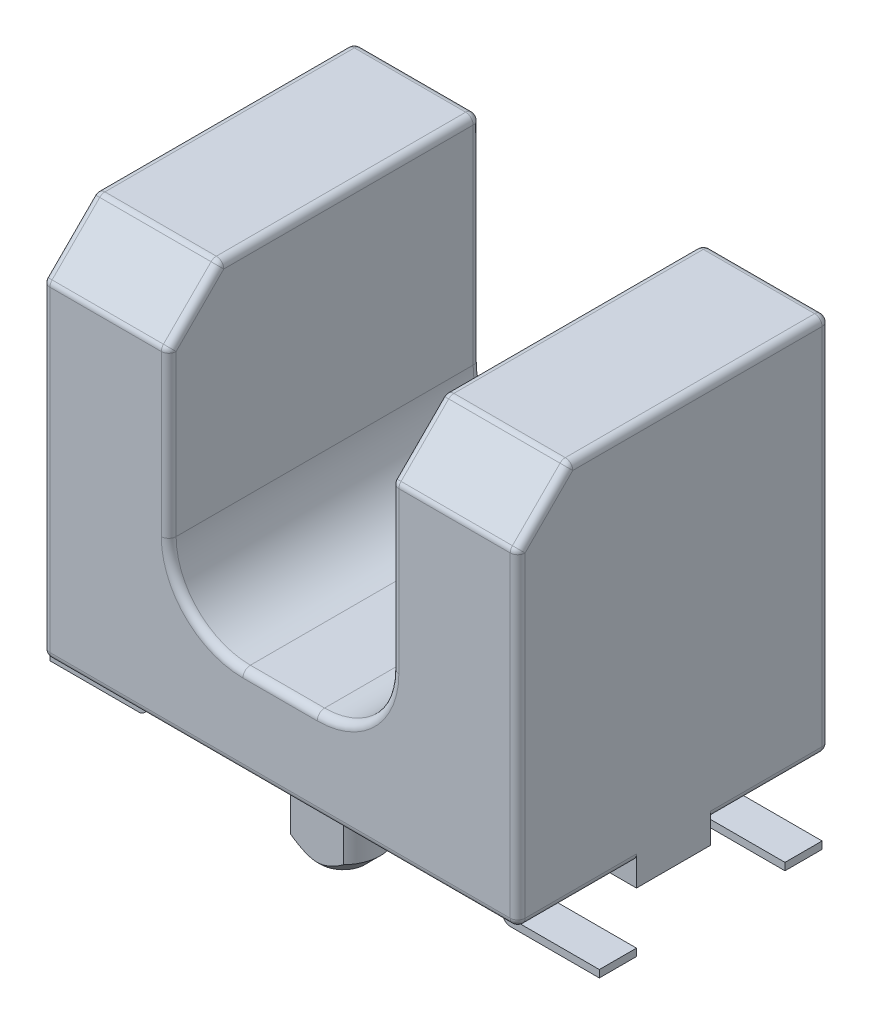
ISO-10303-21;
HEADER;
FILE_DESCRIPTION(('STEP AP214'),'2;1');
FILE_NAME('part.step','',(''),(''),'','','');
FILE_SCHEMA(('AUTOMOTIVE_DESIGN { 1 0 10303 214 1 1 1 1 }'));
ENDSEC;
DATA;
#1=APPLICATION_CONTEXT('core data for automotive mechanical design processes');
#2=APPLICATION_PROTOCOL_DEFINITION('international standard','automotive_design',2000,#1);
#3=PRODUCT_CONTEXT('',#1,'mechanical');
#4=PRODUCT('Part','Part','',(#3));
#5=PRODUCT_RELATED_PRODUCT_CATEGORY('part','',(#4));
#6=PRODUCT_DEFINITION_FORMATION('','',#4);
#7=PRODUCT_DEFINITION_CONTEXT('part definition',#1,'design');
#8=PRODUCT_DEFINITION('design','',#6,#7);
#9=PRODUCT_DEFINITION_SHAPE('','',#8);
#10=(LENGTH_UNIT() NAMED_UNIT(*) SI_UNIT(.MILLI.,.METRE.));
#11=(NAMED_UNIT(*) PLANE_ANGLE_UNIT() SI_UNIT($,.RADIAN.));
#12=(NAMED_UNIT(*) SI_UNIT($,.STERADIAN.) SOLID_ANGLE_UNIT());
#13=UNCERTAINTY_MEASURE_WITH_UNIT(LENGTH_MEASURE(1.E-05),#10,'distance_accuracy_value','');
#14=(GEOMETRIC_REPRESENTATION_CONTEXT(3) GLOBAL_UNCERTAINTY_ASSIGNED_CONTEXT((#13)) GLOBAL_UNIT_ASSIGNED_CONTEXT((#10,
#11,#12)) REPRESENTATION_CONTEXT('',''));
#15=CARTESIAN_POINT('',(0.,0.,0.));
#16=DIRECTION('',(0.,0.,1.));
#17=DIRECTION('',(1.,0.,0.));
#18=AXIS2_PLACEMENT_3D('',#15,#16,#17);
#19=CARTESIAN_POINT('',(0.,-0.1,-2.));
#20=DIRECTION('',(-1.,0.,0.));
#21=DIRECTION('',(0.,0.,1.));
#22=AXIS2_PLACEMENT_3D('',#19,#20,#21);
#23=CYLINDRICAL_SURFACE('',#22,0.1);
#24=CARTESIAN_POINT('',(-1.6,-0.1,-2.));
#25=DIRECTION('',(-1.,0.,0.));
#26=DIRECTION('',(0.,0.,1.));
#27=AXIS2_PLACEMENT_3D('',#24,#25,#26);
#28=CIRCLE('',#27,0.1);
#29=CARTESIAN_POINT('',(-1.6,0.,-2.));
#30=VERTEX_POINT('',#29);
#31=CARTESIAN_POINT('',(-1.6,-0.1,-2.1));
#32=VERTEX_POINT('',#31);
#33=EDGE_CURVE('E27',#30,#32,#28,.T.);
#34=ORIENTED_EDGE('',*,*,#33,.T.);
#35=DIRECTION('',(1.,0.,0.));
#36=VECTOR('',#35,1.);
#37=CARTESIAN_POINT('',(3.2,-0.1,-2.1));
#38=LINE('',#37,#36);
#39=CARTESIAN_POINT('',(-3.1,-0.1,-2.1));
#40=VERTEX_POINT('',#39);
#41=EDGE_CURVE('E968',#40,#32,#38,.T.);
#42=ORIENTED_EDGE('',*,*,#41,.F.);
#43=CARTESIAN_POINT('',(-3.1,-0.1,-2.));
#44=DIRECTION('',(1.,0.,0.));
#45=DIRECTION('',(0.,0.,1.));
#46=AXIS2_PLACEMENT_3D('',#43,#44,#45);
#47=CIRCLE('',#46,0.1);
#48=CARTESIAN_POINT('',(-3.1,0.,-2.));
#49=VERTEX_POINT('',#48);
#50=EDGE_CURVE('E11',#40,#49,#47,.T.);
#51=ORIENTED_EDGE('',*,*,#50,.T.);
#52=DIRECTION('',(-1.,0.,0.));
#53=VECTOR('',#52,1.);
#54=CARTESIAN_POINT('',(0.,0.,-2.));
#55=LINE('',#54,#53);
#56=EDGE_CURVE('E956',#30,#49,#55,.T.);
#57=ORIENTED_EDGE('',*,*,#56,.F.);
#58=EDGE_LOOP('',(#34,#42,#51,#57));
#59=FACE_BOUND('',#58,.T.);
#60=ADVANCED_FACE('F16',(#59),#23,.T.);
#61=CARTESIAN_POINT('',(-3.1,-0.1,-2.));
#62=DIRECTION('',(0.,0.,1.));
#63=DIRECTION('',(1.,0.,0.));
#64=AXIS2_PLACEMENT_3D('',#61,#62,#63);
#65=SPHERICAL_SURFACE('',#64,0.1);
#66=CARTESIAN_POINT('',(-3.1,-0.1,-2.));
#67=DIRECTION('',(0.,1.,0.));
#68=DIRECTION('',(0.,0.,1.));
#69=AXIS2_PLACEMENT_3D('',#66,#67,#68);
#70=CIRCLE('',#69,0.1);
#71=CARTESIAN_POINT('',(-3.2,-0.1,-2.));
#72=VERTEX_POINT('',#71);
#73=EDGE_CURVE('E1751',#40,#72,#70,.T.);
#74=ORIENTED_EDGE('',*,*,#73,.T.);
#75=CARTESIAN_POINT('',(-3.1,-0.1,-2.));
#76=DIRECTION('',(0.,0.,-1.));
#77=DIRECTION('',(1.,0.,0.));
#78=AXIS2_PLACEMENT_3D('',#75,#76,#77);
#79=CIRCLE('',#78,0.1);
#80=EDGE_CURVE('E1592',#72,#49,#79,.T.);
#81=ORIENTED_EDGE('',*,*,#80,.T.);
#82=ORIENTED_EDGE('',*,*,#50,.F.);
#83=EDGE_LOOP('',(#74,#81,#82));
#84=FACE_BOUND('',#83,.T.);
#85=ADVANCED_FACE('F1051',(#84),#65,.T.);
#86=CARTESIAN_POINT('',(-1.6,-0.1,-2.));
#87=DIRECTION('',(0.,0.,1.));
#88=DIRECTION('',(1.,0.,0.));
#89=AXIS2_PLACEMENT_3D('',#86,#87,#88);
#90=SPHERICAL_SURFACE('',#89,0.1);
#91=CARTESIAN_POINT('',(-1.6,-0.1,-2.));
#92=DIRECTION('',(0.,0.,-1.));
#93=DIRECTION('',(-1.,0.,0.));
#94=AXIS2_PLACEMENT_3D('',#91,#92,#93);
#95=CIRCLE('',#94,0.1);
#96=CARTESIAN_POINT('',(-1.5,-0.1,-2.));
#97=VERTEX_POINT('',#96);
#98=EDGE_CURVE('E1589',#30,#97,#95,.T.);
#99=ORIENTED_EDGE('',*,*,#98,.T.);
#100=CARTESIAN_POINT('',(-1.6,-0.1,-2.));
#101=DIRECTION('',(0.,1.,0.));
#102=DIRECTION('',(0.,0.,-1.));
#103=AXIS2_PLACEMENT_3D('',#100,#101,#102);
#104=CIRCLE('',#103,0.1);
#105=EDGE_CURVE('E1593',#97,#32,#104,.T.);
#106=ORIENTED_EDGE('',*,*,#105,.T.);
#107=ORIENTED_EDGE('',*,*,#33,.F.);
#108=EDGE_LOOP('',(#99,#106,#107));
#109=FACE_BOUND('',#108,.T.);
#110=ADVANCED_FACE('F1054',(#109),#90,.T.);
#111=CARTESIAN_POINT('',(-3.1,-5.4,-2.));
#112=DIRECTION('',(0.,1.,0.));
#113=DIRECTION('',(0.,0.,1.));
#114=AXIS2_PLACEMENT_3D('',#111,#112,#113);
#115=CYLINDRICAL_SURFACE('',#114,0.1);
#116=CARTESIAN_POINT('',(-3.1,-5.00131522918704,-2.));
#117=DIRECTION('',(0.,1.,0.));
#118=DIRECTION('',(0.,0.,1.));
#119=AXIS2_PLACEMENT_3D('',#116,#117,#118);
#120=CIRCLE('',#119,0.1);
#121=CARTESIAN_POINT('',(-3.1,-5.00131522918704,-2.1));
#122=VERTEX_POINT('',#121);
#123=CARTESIAN_POINT('',(-3.2,-5.00131522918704,-2.));
#124=VERTEX_POINT('',#123);
#125=EDGE_CURVE('E1918',#122,#124,#120,.T.);
#126=ORIENTED_EDGE('',*,*,#125,.T.);
#127=DIRECTION('',(0.,-1.,0.));
#128=VECTOR('',#127,1.);
#129=CARTESIAN_POINT('',(-3.2,-5.4,-2.));
#130=LINE('',#129,#128);
#131=EDGE_CURVE('E1480',#72,#124,#130,.T.);
#132=ORIENTED_EDGE('',*,*,#131,.F.);
#133=ORIENTED_EDGE('',*,*,#73,.F.);
#134=DIRECTION('',(0.,1.,0.));
#135=VECTOR('',#134,1.);
#136=CARTESIAN_POINT('',(-3.1,-5.4,-2.1));
#137=LINE('',#136,#135);
#138=EDGE_CURVE('E973',#122,#40,#137,.T.);
#139=ORIENTED_EDGE('',*,*,#138,.F.);
#140=EDGE_LOOP('',(#126,#132,#133,#139));
#141=FACE_BOUND('',#140,.T.);
#142=ADVANCED_FACE('F1271',(#141),#115,.T.);
#143=CARTESIAN_POINT('',(-3.1,-0.1,0.));
#144=DIRECTION('',(0.,0.,1.));
#145=DIRECTION('',(1.,0.,0.));
#146=AXIS2_PLACEMENT_3D('',#143,#144,#145);
#147=CYLINDRICAL_SURFACE('',#146,0.1);
#148=CARTESIAN_POINT('',(-3.1,-0.1,1.35857864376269));
#149=DIRECTION('',(0.,0.,-1.));
#150=DIRECTION('',(1.,0.,0.));
#151=AXIS2_PLACEMENT_3D('',#148,#149,#150);
#152=CIRCLE('',#151,0.1);
#153=CARTESIAN_POINT('',(-3.2,-0.1,1.35857864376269));
#154=VERTEX_POINT('',#153);
#155=CARTESIAN_POINT('',(-3.1,0.,1.35857864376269));
#156=VERTEX_POINT('',#155);
#157=EDGE_CURVE('E1915',#154,#156,#152,.T.);
#158=ORIENTED_EDGE('',*,*,#157,.T.);
#159=DIRECTION('',(0.,0.,1.));
#160=VECTOR('',#159,1.);
#161=CARTESIAN_POINT('',(-3.1,0.,0.));
#162=LINE('',#161,#160);
#163=EDGE_CURVE('E960',#49,#156,#162,.T.);
#164=ORIENTED_EDGE('',*,*,#163,.F.);
#165=ORIENTED_EDGE('',*,*,#80,.F.);
#166=DIRECTION('',(0.,0.,-1.));
#167=VECTOR('',#166,1.);
#168=CARTESIAN_POINT('',(-3.2,-0.1,-2.1));
#169=LINE('',#168,#167);
#170=EDGE_CURVE('E1694',#154,#72,#169,.T.);
#171=ORIENTED_EDGE('',*,*,#170,.F.);
#172=EDGE_LOOP('',(#158,#164,#165,#171));
#173=FACE_BOUND('',#172,.T.);
#174=ADVANCED_FACE('F1267',(#173),#147,.T.);
#175=CARTESIAN_POINT('',(-1.6,-0.1,-2.1));
#176=DIRECTION('',(0.,0.,-1.));
#177=DIRECTION('',(-1.,0.,0.));
#178=AXIS2_PLACEMENT_3D('',#175,#176,#177);
#179=CYLINDRICAL_SURFACE('',#178,0.1);
#180=CARTESIAN_POINT('',(-1.6,-0.1,1.35857864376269));
#181=DIRECTION('',(0.,0.,-1.));
#182=DIRECTION('',(-1.,0.,0.));
#183=AXIS2_PLACEMENT_3D('',#180,#181,#182);
#184=CIRCLE('',#183,0.1);
#185=CARTESIAN_POINT('',(-1.6,0.,1.35857864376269));
#186=VERTEX_POINT('',#185);
#187=CARTESIAN_POINT('',(-1.5,-0.1,1.35857864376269));
#188=VERTEX_POINT('',#187);
#189=EDGE_CURVE('E1561',#186,#188,#184,.T.);
#190=ORIENTED_EDGE('',*,*,#189,.T.);
#191=DIRECTION('',(0.,0.,1.));
#192=VECTOR('',#191,1.);
#193=CARTESIAN_POINT('',(-1.5,-0.1,1.4));
#194=LINE('',#193,#192);
#195=EDGE_CURVE('E800',#97,#188,#194,.T.);
#196=ORIENTED_EDGE('',*,*,#195,.F.);
#197=ORIENTED_EDGE('',*,*,#98,.F.);
#198=DIRECTION('',(0.,0.,-1.));
#199=VECTOR('',#198,1.);
#200=CARTESIAN_POINT('',(-1.6,0.,-2.1));
#201=LINE('',#200,#199);
#202=EDGE_CURVE('E961',#186,#30,#201,.T.);
#203=ORIENTED_EDGE('',*,*,#202,.F.);
#204=EDGE_LOOP('',(#190,#196,#197,#203));
#205=FACE_BOUND('',#204,.T.);
#206=ADVANCED_FACE('F1270',(#205),#179,.T.);
#207=CARTESIAN_POINT('',(-1.6,-3.9,-2.));
#208=DIRECTION('',(0.,-1.,0.));
#209=DIRECTION('',(0.,0.,-1.));
#210=AXIS2_PLACEMENT_3D('',#207,#208,#209);
#211=CYLINDRICAL_SURFACE('',#210,0.1);
#212=CARTESIAN_POINT('',(-1.6,-2.9,-2.));
#213=DIRECTION('',(0.,1.,0.));
#214=DIRECTION('',(0.,0.,1.));
#215=AXIS2_PLACEMENT_3D('',#212,#213,#214);
#216=CIRCLE('',#215,0.1);
#217=CARTESIAN_POINT('',(-1.5,-2.9,-2.));
#218=VERTEX_POINT('',#217);
#219=CARTESIAN_POINT('',(-1.6,-2.9,-2.1));
#220=VERTEX_POINT('',#219);
#221=EDGE_CURVE('E1558',#218,#220,#216,.T.);
#222=ORIENTED_EDGE('',*,*,#221,.T.);
#223=DIRECTION('',(0.,-1.,0.));
#224=VECTOR('',#223,1.);
#225=CARTESIAN_POINT('',(-1.6,-2.9,-2.1));
#226=LINE('',#225,#224);
#227=EDGE_CURVE('E972',#32,#220,#226,.T.);
#228=ORIENTED_EDGE('',*,*,#227,.F.);
#229=ORIENTED_EDGE('',*,*,#105,.F.);
#230=DIRECTION('',(0.,1.,0.));
#231=VECTOR('',#230,1.);
#232=CARTESIAN_POINT('',(-1.5,-0.498684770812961,-2.));
#233=LINE('',#232,#231);
#234=EDGE_CURVE('E805',#218,#97,#233,.T.);
#235=ORIENTED_EDGE('',*,*,#234,.F.);
#236=EDGE_LOOP('',(#222,#228,#229,#235));
#237=FACE_BOUND('',#236,.T.);
#238=ADVANCED_FACE('F1324',(#237),#211,.T.);
#239=CARTESIAN_POINT('',(-3.1,-5.00131522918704,-2.));
#240=DIRECTION('',(0.,0.,1.));
#241=DIRECTION('',(1.,0.,0.));
#242=AXIS2_PLACEMENT_3D('',#239,#240,#241);
#243=SPHERICAL_SURFACE('',#242,0.1);
#244=CARTESIAN_POINT('',(-3.1,-5.00131522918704,-2.));
#245=DIRECTION('',(-1.,0.,0.));
#246=DIRECTION('',(0.,0.,-1.));
#247=AXIS2_PLACEMENT_3D('',#244,#245,#246);
#248=CIRCLE('',#247,0.1);
#249=CARTESIAN_POINT('',(-3.1,-5.10131522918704,-2.));
#250=VERTEX_POINT('',#249);
#251=EDGE_CURVE('E1562',#122,#250,#248,.T.);
#252=ORIENTED_EDGE('',*,*,#251,.T.);
#253=CARTESIAN_POINT('',(-3.1,-5.00131522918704,-2.));
#254=DIRECTION('',(0.,0.,-1.));
#255=DIRECTION('',(-1.,0.,0.));
#256=AXIS2_PLACEMENT_3D('',#253,#254,#255);
#257=CIRCLE('',#256,0.1);
#258=EDGE_CURVE('E1569',#250,#124,#257,.T.);
#259=ORIENTED_EDGE('',*,*,#258,.T.);
#260=ORIENTED_EDGE('',*,*,#125,.F.);
#261=EDGE_LOOP('',(#252,#259,#260));
#262=FACE_BOUND('',#261,.T.);
#263=ADVANCED_FACE('F1341',(#262),#243,.T.);
#264=CARTESIAN_POINT('',(-3.1,-0.1,1.35857864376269));
#265=DIRECTION('',(0.,0.,1.));
#266=DIRECTION('',(1.,0.,0.));
#267=AXIS2_PLACEMENT_3D('',#264,#265,#266);
#268=SPHERICAL_SURFACE('',#267,0.1);
#269=CARTESIAN_POINT('',(-3.1,-0.1,1.35857864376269));
#270=DIRECTION('',(0.,0.707106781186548,-0.707106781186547));
#271=DIRECTION('',(0.,0.707106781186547,0.707106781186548));
#272=AXIS2_PLACEMENT_3D('',#269,#270,#271);
#273=CIRCLE('',#272,0.1);
#274=CARTESIAN_POINT('',(-3.1,-0.0292893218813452,1.42928932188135));
#275=VERTEX_POINT('',#274);
#276=EDGE_CURVE('E2039',#154,#275,#273,.T.);
#277=ORIENTED_EDGE('',*,*,#276,.T.);
#278=CARTESIAN_POINT('',(-3.1,-0.1,1.35857864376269));
#279=DIRECTION('',(-1.,0.,0.));
#280=DIRECTION('',(0.,0.,-1.));
#281=AXIS2_PLACEMENT_3D('',#278,#279,#280);
#282=CIRCLE('',#281,0.1);
#283=EDGE_CURVE('E1657',#275,#156,#282,.T.);
#284=ORIENTED_EDGE('',*,*,#283,.T.);
#285=ORIENTED_EDGE('',*,*,#157,.F.);
#286=EDGE_LOOP('',(#277,#284,#285));
#287=FACE_BOUND('',#286,.T.);
#288=ADVANCED_FACE('F2345',(#287),#268,.T.);
#289=CARTESIAN_POINT('',(-1.6,-0.1,1.35857864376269));
#290=DIRECTION('',(0.,0.,1.));
#291=DIRECTION('',(1.,0.,0.));
#292=AXIS2_PLACEMENT_3D('',#289,#290,#291);
#293=SPHERICAL_SURFACE('',#292,0.1);
#294=CARTESIAN_POINT('',(-1.6,-0.1,1.35857864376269));
#295=DIRECTION('',(1.,0.,0.));
#296=DIRECTION('',(0.,0.,-1.));
#297=AXIS2_PLACEMENT_3D('',#294,#295,#296);
#298=CIRCLE('',#297,0.1);
#299=CARTESIAN_POINT('',(-1.6,-0.0292893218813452,1.42928932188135));
#300=VERTEX_POINT('',#299);
#301=EDGE_CURVE('E1661',#186,#300,#298,.T.);
#302=ORIENTED_EDGE('',*,*,#301,.T.);
#303=CARTESIAN_POINT('',(-1.6,-0.1,1.35857864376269));
#304=DIRECTION('',(0.,0.707106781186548,-0.707106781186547));
#305=DIRECTION('',(0.,-0.707106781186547,-0.707106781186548));
#306=AXIS2_PLACEMENT_3D('',#303,#304,#305);
#307=CIRCLE('',#306,0.1);
#308=EDGE_CURVE('E1662',#300,#188,#307,.T.);
#309=ORIENTED_EDGE('',*,*,#308,.T.);
#310=ORIENTED_EDGE('',*,*,#189,.F.);
#311=EDGE_LOOP('',(#302,#309,#310));
#312=FACE_BOUND('',#311,.T.);
#313=ADVANCED_FACE('F1060',(#312),#293,.T.);
#314=CARTESIAN_POINT('',(-0.5,-2.9,-2.));
#315=DIRECTION('',(0.,0.,-1.));
#316=DIRECTION('',(-1.,0.,0.));
#317=AXIS2_PLACEMENT_3D('',#314,#315,#316);
#318=TOROIDAL_SURFACE('',#317,1.1,0.1);
#319=CARTESIAN_POINT('',(-0.5,-4.,-2.));
#320=DIRECTION('',(-1.,0.,0.));
#321=DIRECTION('',(0.,0.,1.));
#322=AXIS2_PLACEMENT_3D('',#319,#320,#321);
#323=CIRCLE('',#322,0.1);
#324=CARTESIAN_POINT('',(-0.5,-3.9,-2.));
#325=VERTEX_POINT('',#324);
#326=CARTESIAN_POINT('',(-0.5,-4.,-2.1));
#327=VERTEX_POINT('',#326);
#328=EDGE_CURVE('E1903',#325,#327,#323,.T.);
#329=ORIENTED_EDGE('',*,*,#328,.T.);
#330=CARTESIAN_POINT('',(-0.5,-2.9,-2.1));
#331=DIRECTION('',(0.,0.,1.));
#332=DIRECTION('',(-1.,0.,0.));
#333=AXIS2_PLACEMENT_3D('',#330,#331,#332);
#334=CIRCLE('',#333,1.1);
#335=EDGE_CURVE('E1831',#220,#327,#334,.T.);
#336=ORIENTED_EDGE('',*,*,#335,.F.);
#337=ORIENTED_EDGE('',*,*,#221,.F.);
#338=CARTESIAN_POINT('',(-0.5,-2.9,-2.));
#339=DIRECTION('',(0.,0.,-1.));
#340=DIRECTION('',(-1.,0.,0.));
#341=AXIS2_PLACEMENT_3D('',#338,#339,#340);
#342=CIRCLE('',#341,1.);
#343=EDGE_CURVE('E946',#325,#218,#342,.T.);
#344=ORIENTED_EDGE('',*,*,#343,.F.);
#345=EDGE_LOOP('',(#329,#336,#337,#344));
#346=FACE_BOUND('',#345,.T.);
#347=ADVANCED_FACE('F1056',(#346),#318,.T.);
#348=CARTESIAN_POINT('',(3.2,-5.00131522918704,-2.));
#349=DIRECTION('',(1.,0.,0.));
#350=DIRECTION('',(0.,0.,-1.));
#351=AXIS2_PLACEMENT_3D('',#348,#349,#350);
#352=CYLINDRICAL_SURFACE('',#351,0.1);
#353=CARTESIAN_POINT('',(3.1,-5.00131522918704,-2.));
#354=DIRECTION('',(-1.,0.,0.));
#355=DIRECTION('',(0.,0.,-1.));
#356=AXIS2_PLACEMENT_3D('',#353,#354,#355);
#357=CIRCLE('',#356,0.1);
#358=CARTESIAN_POINT('',(3.1,-5.00131522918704,-2.1));
#359=VERTEX_POINT('',#358);
#360=CARTESIAN_POINT('',(3.1,-5.10131522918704,-2.));
#361=VERTEX_POINT('',#360);
#362=EDGE_CURVE('E1556',#359,#361,#357,.T.);
#363=ORIENTED_EDGE('',*,*,#362,.T.);
#364=DIRECTION('',(1.,0.,0.));
#365=VECTOR('',#364,1.);
#366=CARTESIAN_POINT('',(3.2,-5.10131522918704,-2.));
#367=LINE('',#366,#365);
#368=EDGE_CURVE('E1610',#250,#361,#367,.T.);
#369=ORIENTED_EDGE('',*,*,#368,.F.);
#370=ORIENTED_EDGE('',*,*,#251,.F.);
#371=DIRECTION('',(-1.,0.,0.));
#372=VECTOR('',#371,1.);
#373=CARTESIAN_POINT('',(-3.2,-5.00131522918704,-2.1));
#374=LINE('',#373,#372);
#375=EDGE_CURVE('E2131',#359,#122,#374,.T.);
#376=ORIENTED_EDGE('',*,*,#375,.F.);
#377=EDGE_LOOP('',(#363,#369,#370,#376));
#378=FACE_BOUND('',#377,.T.);
#379=ADVANCED_FACE('F1059',(#378),#352,.T.);
#380=CARTESIAN_POINT('',(-3.1,-5.00131522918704,-2.1));
#381=DIRECTION('',(0.,0.,-1.));
#382=DIRECTION('',(-1.,0.,0.));
#383=AXIS2_PLACEMENT_3D('',#380,#381,#382);
#384=CYLINDRICAL_SURFACE('',#383,0.1);
#385=CARTESIAN_POINT('',(-3.1,-5.00131522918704,-0.5));
#386=DIRECTION('',(0.,0.,1.));
#387=DIRECTION('',(1.,0.,0.));
#388=AXIS2_PLACEMENT_3D('',#385,#386,#387);
#389=CIRCLE('',#388,0.1);
#390=CARTESIAN_POINT('',(-3.2,-5.00131522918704,-0.5));
#391=VERTEX_POINT('',#390);
#392=CARTESIAN_POINT('',(-3.1,-5.10131522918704,-0.5));
#393=VERTEX_POINT('',#392);
#394=EDGE_CURVE('E775',#391,#393,#389,.T.);
#395=ORIENTED_EDGE('',*,*,#394,.F.);
#396=DIRECTION('',(0.,0.,1.));
#397=VECTOR('',#396,1.);
#398=CARTESIAN_POINT('',(-3.2,-5.00131522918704,-0.5));
#399=LINE('',#398,#397);
#400=EDGE_CURVE('E1606',#124,#391,#399,.T.);
#401=ORIENTED_EDGE('',*,*,#400,.F.);
#402=ORIENTED_EDGE('',*,*,#258,.F.);
#403=DIRECTION('',(0.,0.,-1.));
#404=VECTOR('',#403,1.);
#405=CARTESIAN_POINT('',(-3.1,-5.10131522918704,-2.1));
#406=LINE('',#405,#404);
#407=EDGE_CURVE('E1693',#393,#250,#406,.T.);
#408=ORIENTED_EDGE('',*,*,#407,.F.);
#409=EDGE_LOOP('',(#395,#401,#402,#408));
#410=FACE_BOUND('',#409,.T.);
#411=ADVANCED_FACE('F1127',(#410),#384,.T.);
#412=CARTESIAN_POINT('',(-3.1,-0.0707106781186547,1.32928932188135));
#413=DIRECTION('',(0.,0.707106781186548,-0.707106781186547));
#414=DIRECTION('',(0.,0.707106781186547,0.707106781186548));
#415=AXIS2_PLACEMENT_3D('',#412,#413,#414);
#416=CYLINDRICAL_SURFACE('',#415,0.1);
#417=CARTESIAN_POINT('',(-3.1,-0.74142135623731,2.));
#418=DIRECTION('',(0.,0.707106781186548,-0.707106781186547));
#419=DIRECTION('',(0.,0.707106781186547,0.707106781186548));
#420=AXIS2_PLACEMENT_3D('',#417,#418,#419);
#421=CIRCLE('',#420,0.1);
#422=CARTESIAN_POINT('',(-3.2,-0.74142135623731,2.));
#423=VERTEX_POINT('',#422);
#424=CARTESIAN_POINT('',(-3.1,-0.670710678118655,2.07071067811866));
#425=VERTEX_POINT('',#424);
#426=EDGE_CURVE('E41',#423,#425,#421,.T.);
#427=ORIENTED_EDGE('',*,*,#426,.T.);
#428=DIRECTION('',(0.,-0.707106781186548,0.707106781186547));
#429=VECTOR('',#428,1.);
#430=CARTESIAN_POINT('',(-3.1,0.,1.4));
#431=LINE('',#430,#429);
#432=EDGE_CURVE('E1570',#275,#425,#431,.T.);
#433=ORIENTED_EDGE('',*,*,#432,.F.);
#434=ORIENTED_EDGE('',*,*,#276,.F.);
#435=DIRECTION('',(0.,0.707106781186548,-0.707106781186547));
#436=VECTOR('',#435,1.);
#437=CARTESIAN_POINT('',(-3.2,-1.02071067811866,2.27928932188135));
#438=LINE('',#437,#436);
#439=EDGE_CURVE('E1687',#423,#154,#438,.T.);
#440=ORIENTED_EDGE('',*,*,#439,.F.);
#441=EDGE_LOOP('',(#427,#433,#434,#440));
#442=FACE_BOUND('',#441,.T.);
#443=ADVANCED_FACE('F1123',(#442),#416,.T.);
#444=CARTESIAN_POINT('',(0.,-0.1,1.35857864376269));
#445=DIRECTION('',(1.,0.,0.));
#446=DIRECTION('',(0.,0.,-1.));
#447=AXIS2_PLACEMENT_3D('',#444,#445,#446);
#448=CYLINDRICAL_SURFACE('',#447,0.1);
#449=ORIENTED_EDGE('',*,*,#283,.F.);
#450=DIRECTION('',(-1.,0.,0.));
#451=VECTOR('',#450,1.);
#452=CARTESIAN_POINT('',(0.,-0.0292893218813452,1.42928932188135));
#453=LINE('',#452,#451);
#454=EDGE_CURVE('E1574',#300,#275,#453,.T.);
#455=ORIENTED_EDGE('',*,*,#454,.F.);
#456=ORIENTED_EDGE('',*,*,#301,.F.);
#457=DIRECTION('',(1.,0.,0.));
#458=VECTOR('',#457,1.);
#459=CARTESIAN_POINT('',(0.,0.,1.35857864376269));
#460=LINE('',#459,#458);
#461=EDGE_CURVE('E1630',#156,#186,#460,.T.);
#462=ORIENTED_EDGE('',*,*,#461,.F.);
#463=EDGE_LOOP('',(#449,#455,#456,#462));
#464=FACE_BOUND('',#463,.T.);
#465=ADVANCED_FACE('F1126',(#464),#448,.T.);
#466=CARTESIAN_POINT('',(-1.6,-0.270710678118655,1.52928932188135));
#467=DIRECTION('',(0.,-0.707106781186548,0.707106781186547));
#468=DIRECTION('',(0.,-0.707106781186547,-0.707106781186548));
#469=AXIS2_PLACEMENT_3D('',#466,#467,#468);
#470=CYLINDRICAL_SURFACE('',#469,0.1);
#471=CARTESIAN_POINT('',(-1.6,-0.74142135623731,2.));
#472=DIRECTION('',(0.,0.707106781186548,-0.707106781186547));
#473=DIRECTION('',(0.,-0.707106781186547,-0.707106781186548));
#474=AXIS2_PLACEMENT_3D('',#471,#472,#473);
#475=CIRCLE('',#474,0.1);
#476=CARTESIAN_POINT('',(-1.6,-0.670710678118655,2.07071067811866));
#477=VERTEX_POINT('',#476);
#478=CARTESIAN_POINT('',(-1.5,-0.74142135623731,2.));
#479=VERTEX_POINT('',#478);
#480=EDGE_CURVE('E1557',#477,#479,#475,.T.);
#481=ORIENTED_EDGE('',*,*,#480,.T.);
#482=DIRECTION('',(0.,-0.707106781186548,0.707106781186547));
#483=VECTOR('',#482,1.);
#484=CARTESIAN_POINT('',(-1.5,-0.270710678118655,1.52928932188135));
#485=LINE('',#484,#483);
#486=EDGE_CURVE('E804',#188,#479,#485,.T.);
#487=ORIENTED_EDGE('',*,*,#486,.F.);
#488=ORIENTED_EDGE('',*,*,#308,.F.);
#489=DIRECTION('',(0.,0.707106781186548,-0.707106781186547));
#490=VECTOR('',#489,1.);
#491=CARTESIAN_POINT('',(-1.6,-0.2,1.6));
#492=LINE('',#491,#490);
#493=EDGE_CURVE('E839',#477,#300,#492,.T.);
#494=ORIENTED_EDGE('',*,*,#493,.F.);
#495=EDGE_LOOP('',(#481,#487,#488,#494));
#496=FACE_BOUND('',#495,.T.);
#497=ADVANCED_FACE('F1072',(#496),#470,.T.);
#498=CARTESIAN_POINT('',(0.,-4.,-2.));
#499=DIRECTION('',(-1.,0.,0.));
#500=DIRECTION('',(0.,0.,1.));
#501=AXIS2_PLACEMENT_3D('',#498,#499,#500);
#502=CYLINDRICAL_SURFACE('',#501,0.1);
#503=CARTESIAN_POINT('',(0.5,-4.,-2.));
#504=DIRECTION('',(-1.,0.,0.));
#505=DIRECTION('',(0.,0.,1.));
#506=AXIS2_PLACEMENT_3D('',#503,#504,#505);
#507=CIRCLE('',#506,0.1);
#508=CARTESIAN_POINT('',(0.5,-3.9,-2.));
#509=VERTEX_POINT('',#508);
#510=CARTESIAN_POINT('',(0.5,-4.,-2.1));
#511=VERTEX_POINT('',#510);
#512=EDGE_CURVE('E1627',#509,#511,#507,.T.);
#513=ORIENTED_EDGE('',*,*,#512,.T.);
#514=DIRECTION('',(1.,0.,0.));
#515=VECTOR('',#514,1.);
#516=CARTESIAN_POINT('',(3.2,-4.,-2.1));
#517=LINE('',#516,#515);
#518=EDGE_CURVE('E1741',#327,#511,#517,.T.);
#519=ORIENTED_EDGE('',*,*,#518,.F.);
#520=ORIENTED_EDGE('',*,*,#328,.F.);
#521=DIRECTION('',(-1.,0.,0.));
#522=VECTOR('',#521,1.);
#523=CARTESIAN_POINT('',(0.,-3.9,-2.));
#524=LINE('',#523,#522);
#525=EDGE_CURVE('E888',#509,#325,#524,.T.);
#526=ORIENTED_EDGE('',*,*,#525,.F.);
#527=EDGE_LOOP('',(#513,#519,#520,#526));
#528=FACE_BOUND('',#527,.T.);
#529=ADVANCED_FACE('F1068',(#528),#502,.T.);
#530=CARTESIAN_POINT('',(3.1,-5.00131522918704,-2.));
#531=DIRECTION('',(0.,0.,1.));
#532=DIRECTION('',(1.,0.,0.));
#533=AXIS2_PLACEMENT_3D('',#530,#531,#532);
#534=SPHERICAL_SURFACE('',#533,0.1);
#535=CARTESIAN_POINT('',(3.1,-5.00131522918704,-2.));
#536=DIRECTION('',(0.,-1.,0.));
#537=DIRECTION('',(0.,0.,1.));
#538=AXIS2_PLACEMENT_3D('',#535,#536,#537);
#539=CIRCLE('',#538,0.1);
#540=CARTESIAN_POINT('',(3.2,-5.00131522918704,-2.));
#541=VERTEX_POINT('',#540);
#542=EDGE_CURVE('E1629',#359,#541,#539,.T.);
#543=ORIENTED_EDGE('',*,*,#542,.T.);
#544=CARTESIAN_POINT('',(3.1,-5.00131522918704,-2.));
#545=DIRECTION('',(0.,0.,-1.));
#546=DIRECTION('',(1.,0.,0.));
#547=AXIS2_PLACEMENT_3D('',#544,#545,#546);
#548=CIRCLE('',#547,0.1);
#549=EDGE_CURVE('E1843',#541,#361,#548,.T.);
#550=ORIENTED_EDGE('',*,*,#549,.T.);
#551=ORIENTED_EDGE('',*,*,#362,.F.);
#552=EDGE_LOOP('',(#543,#550,#551));
#553=FACE_BOUND('',#552,.T.);
#554=ADVANCED_FACE('F1071',(#553),#534,.T.);
#555=CARTESIAN_POINT('',(-3.1,-0.74142135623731,2.));
#556=DIRECTION('',(0.,0.,1.));
#557=DIRECTION('',(1.,0.,0.));
#558=AXIS2_PLACEMENT_3D('',#555,#556,#557);
#559=SPHERICAL_SURFACE('',#558,0.1);
#560=CARTESIAN_POINT('',(-3.1,-0.74142135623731,2.));
#561=DIRECTION('',(0.,1.,0.));
#562=DIRECTION('',(0.,0.,1.));
#563=AXIS2_PLACEMENT_3D('',#560,#561,#562);
#564=CIRCLE('',#563,0.1);
#565=CARTESIAN_POINT('',(-3.1,-0.74142135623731,2.1));
#566=VERTEX_POINT('',#565);
#567=EDGE_CURVE('E1839',#423,#566,#564,.T.);
#568=ORIENTED_EDGE('',*,*,#567,.T.);
#569=CARTESIAN_POINT('',(-3.1,-0.74142135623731,2.));
#570=DIRECTION('',(-1.,0.,0.));
#571=DIRECTION('',(0.,0.,-1.));
#572=AXIS2_PLACEMENT_3D('',#569,#570,#571);
#573=CIRCLE('',#572,0.1);
#574=EDGE_CURVE('E1750',#566,#425,#573,.T.);
#575=ORIENTED_EDGE('',*,*,#574,.T.);
#576=ORIENTED_EDGE('',*,*,#426,.F.);
#577=EDGE_LOOP('',(#568,#575,#576));
#578=FACE_BOUND('',#577,.T.);
#579=ADVANCED_FACE('F1217',(#578),#559,.T.);
#580=CARTESIAN_POINT('',(-1.6,-0.74142135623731,2.));
#581=DIRECTION('',(0.,0.,1.));
#582=DIRECTION('',(1.,0.,0.));
#583=AXIS2_PLACEMENT_3D('',#580,#581,#582);
#584=SPHERICAL_SURFACE('',#583,0.1);
#585=CARTESIAN_POINT('',(-1.6,-0.74142135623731,2.));
#586=DIRECTION('',(1.,0.,0.));
#587=DIRECTION('',(0.,0.,-1.));
#588=AXIS2_PLACEMENT_3D('',#585,#586,#587);
#589=CIRCLE('',#588,0.1);
#590=CARTESIAN_POINT('',(-1.6,-0.74142135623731,2.1));
#591=VERTEX_POINT('',#590);
#592=EDGE_CURVE('E1844',#477,#591,#589,.T.);
#593=ORIENTED_EDGE('',*,*,#592,.T.);
#594=CARTESIAN_POINT('',(-1.6,-0.74142135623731,2.));
#595=DIRECTION('',(0.,1.,0.));
#596=DIRECTION('',(0.,0.,-1.));
#597=AXIS2_PLACEMENT_3D('',#594,#595,#596);
#598=CIRCLE('',#597,0.1);
#599=EDGE_CURVE('E1578',#591,#479,#598,.T.);
#600=ORIENTED_EDGE('',*,*,#599,.T.);
#601=ORIENTED_EDGE('',*,*,#480,.F.);
#602=EDGE_LOOP('',(#593,#600,#601));
#603=FACE_BOUND('',#602,.T.);
#604=ADVANCED_FACE('F1220',(#603),#584,.T.);
#605=CARTESIAN_POINT('',(0.5,-2.9,-2.));
#606=DIRECTION('',(0.,0.,-1.));
#607=DIRECTION('',(-1.,0.,0.));
#608=AXIS2_PLACEMENT_3D('',#605,#606,#607);
#609=TOROIDAL_SURFACE('',#608,1.1,0.1);
#610=CARTESIAN_POINT('',(1.6,-2.9,-2.));
#611=DIRECTION('',(0.,-1.,0.));
#612=DIRECTION('',(0.,0.,-1.));
#613=AXIS2_PLACEMENT_3D('',#610,#611,#612);
#614=CIRCLE('',#613,0.1);
#615=CARTESIAN_POINT('',(1.5,-2.9,-2.));
#616=VERTEX_POINT('',#615);
#617=CARTESIAN_POINT('',(1.6,-2.9,-2.1));
#618=VERTEX_POINT('',#617);
#619=EDGE_CURVE('E1575',#616,#618,#614,.T.);
#620=ORIENTED_EDGE('',*,*,#619,.T.);
#621=CARTESIAN_POINT('',(0.5,-2.9,-2.1));
#622=DIRECTION('',(0.,0.,1.));
#623=DIRECTION('',(-1.,0.,0.));
#624=AXIS2_PLACEMENT_3D('',#621,#622,#623);
#625=CIRCLE('',#624,1.1);
#626=EDGE_CURVE('E1737',#511,#618,#625,.T.);
#627=ORIENTED_EDGE('',*,*,#626,.F.);
#628=ORIENTED_EDGE('',*,*,#512,.F.);
#629=CARTESIAN_POINT('',(0.5,-2.9,-2.));
#630=DIRECTION('',(0.,0.,-1.));
#631=DIRECTION('',(-1.,0.,0.));
#632=AXIS2_PLACEMENT_3D('',#629,#630,#631);
#633=CIRCLE('',#632,1.);
#634=EDGE_CURVE('E1514',#616,#509,#633,.T.);
#635=ORIENTED_EDGE('',*,*,#634,.F.);
#636=EDGE_LOOP('',(#620,#627,#628,#635));
#637=FACE_BOUND('',#636,.T.);
#638=ADVANCED_FACE('F1315',(#637),#609,.T.);
#639=CARTESIAN_POINT('',(3.1,-5.4,-2.));
#640=DIRECTION('',(0.,1.,0.));
#641=DIRECTION('',(0.,0.,1.));
#642=AXIS2_PLACEMENT_3D('',#639,#640,#641);
#643=CYLINDRICAL_SURFACE('',#642,0.1);
#644=CARTESIAN_POINT('',(3.1,-0.1,-2.));
#645=DIRECTION('',(0.,-1.,0.));
#646=DIRECTION('',(0.,0.,1.));
#647=AXIS2_PLACEMENT_3D('',#644,#645,#646);
#648=CIRCLE('',#647,0.1);
#649=CARTESIAN_POINT('',(3.1,-0.1,-2.1));
#650=VERTEX_POINT('',#649);
#651=CARTESIAN_POINT('',(3.2,-0.1,-2.));
#652=VERTEX_POINT('',#651);
#653=EDGE_CURVE('E1579',#650,#652,#648,.T.);
#654=ORIENTED_EDGE('',*,*,#653,.T.);
#655=DIRECTION('',(0.,1.,0.));
#656=VECTOR('',#655,1.);
#657=CARTESIAN_POINT('',(3.2,-5.4,-2.));
#658=LINE('',#657,#656);
#659=EDGE_CURVE('E859',#541,#652,#658,.T.);
#660=ORIENTED_EDGE('',*,*,#659,.F.);
#661=ORIENTED_EDGE('',*,*,#542,.F.);
#662=DIRECTION('',(0.,-1.,0.));
#663=VECTOR('',#662,1.);
#664=CARTESIAN_POINT('',(3.1,-5.4,-2.1));
#665=LINE('',#664,#663);
#666=EDGE_CURVE('E1726',#650,#359,#665,.T.);
#667=ORIENTED_EDGE('',*,*,#666,.F.);
#668=EDGE_LOOP('',(#654,#660,#661,#667));
#669=FACE_BOUND('',#668,.T.);
#670=ADVANCED_FACE('F1290',(#669),#643,.T.);
#671=CARTESIAN_POINT('',(3.1,-5.00131522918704,2.1));
#672=DIRECTION('',(0.,0.,1.));
#673=DIRECTION('',(1.,0.,0.));
#674=AXIS2_PLACEMENT_3D('',#671,#672,#673);
#675=CYLINDRICAL_SURFACE('',#674,0.1);
#676=CARTESIAN_POINT('',(3.1,-5.00131522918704,-0.5));
#677=DIRECTION('',(0.,0.,1.));
#678=DIRECTION('',(1.,0.,0.));
#679=AXIS2_PLACEMENT_3D('',#676,#677,#678);
#680=CIRCLE('',#679,0.1);
#681=CARTESIAN_POINT('',(3.1,-5.10131522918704,-0.5));
#682=VERTEX_POINT('',#681);
#683=CARTESIAN_POINT('',(3.2,-5.00131522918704,-0.5));
#684=VERTEX_POINT('',#683);
#685=EDGE_CURVE('E397',#682,#684,#680,.T.);
#686=ORIENTED_EDGE('',*,*,#685,.F.);
#687=DIRECTION('',(0.,0.,1.));
#688=VECTOR('',#687,1.);
#689=CARTESIAN_POINT('',(3.1,-5.10131522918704,-0.5));
#690=LINE('',#689,#688);
#691=EDGE_CURVE('E1499',#361,#682,#690,.T.);
#692=ORIENTED_EDGE('',*,*,#691,.F.);
#693=ORIENTED_EDGE('',*,*,#549,.F.);
#694=DIRECTION('',(0.,0.,-1.));
#695=VECTOR('',#694,1.);
#696=CARTESIAN_POINT('',(3.2,-5.00131522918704,-2.1));
#697=LINE('',#696,#695);
#698=EDGE_CURVE('E864',#684,#541,#697,.T.);
#699=ORIENTED_EDGE('',*,*,#698,.F.);
#700=EDGE_LOOP('',(#686,#692,#693,#699));
#701=FACE_BOUND('',#700,.T.);
#702=ADVANCED_FACE('F1287',(#701),#675,.T.);
#703=CARTESIAN_POINT('',(-3.1,-5.4,2.));
#704=DIRECTION('',(0.,1.,0.));
#705=DIRECTION('',(0.,0.,1.));
#706=AXIS2_PLACEMENT_3D('',#703,#704,#705);
#707=CYLINDRICAL_SURFACE('',#706,0.1);
#708=CARTESIAN_POINT('',(-3.1,-5.00131522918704,2.));
#709=DIRECTION('',(0.,1.,0.));
#710=DIRECTION('',(0.,0.,1.));
#711=AXIS2_PLACEMENT_3D('',#708,#709,#710);
#712=CIRCLE('',#711,0.1);
#713=CARTESIAN_POINT('',(-3.2,-5.00131522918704,2.));
#714=VERTEX_POINT('',#713);
#715=CARTESIAN_POINT('',(-3.1,-5.00131522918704,2.1));
#716=VERTEX_POINT('',#715);
#717=EDGE_CURVE('E1580',#714,#716,#712,.T.);
#718=ORIENTED_EDGE('',*,*,#717,.T.);
#719=DIRECTION('',(0.,-1.,0.));
#720=VECTOR('',#719,1.);
#721=CARTESIAN_POINT('',(-3.1,-5.4,2.1));
#722=LINE('',#721,#720);
#723=EDGE_CURVE('E987',#566,#716,#722,.T.);
#724=ORIENTED_EDGE('',*,*,#723,.F.);
#725=ORIENTED_EDGE('',*,*,#567,.F.);
#726=DIRECTION('',(0.,1.,0.));
#727=VECTOR('',#726,1.);
#728=CARTESIAN_POINT('',(-3.2,-5.4,2.));
#729=LINE('',#728,#727);
#730=EDGE_CURVE('E1683',#714,#423,#729,.T.);
#731=ORIENTED_EDGE('',*,*,#730,.F.);
#732=EDGE_LOOP('',(#718,#724,#725,#731));
#733=FACE_BOUND('',#732,.T.);
#734=ADVANCED_FACE('F1019',(#733),#707,.T.);
#735=CARTESIAN_POINT('',(-3.2,-0.74142135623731,2.));
#736=DIRECTION('',(1.,0.,0.));
#737=DIRECTION('',(0.,0.,-1.));
#738=AXIS2_PLACEMENT_3D('',#735,#736,#737);
#739=CYLINDRICAL_SURFACE('',#738,0.1);
#740=ORIENTED_EDGE('',*,*,#574,.F.);
#741=DIRECTION('',(-1.,0.,0.));
#742=VECTOR('',#741,1.);
#743=CARTESIAN_POINT('',(-3.2,-0.74142135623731,2.1));
#744=LINE('',#743,#742);
#745=EDGE_CURVE('E983',#591,#566,#744,.T.);
#746=ORIENTED_EDGE('',*,*,#745,.F.);
#747=ORIENTED_EDGE('',*,*,#592,.F.);
#748=DIRECTION('',(1.,0.,0.));
#749=VECTOR('',#748,1.);
#750=CARTESIAN_POINT('',(0.,-0.670710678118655,2.07071067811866));
#751=LINE('',#750,#749);
#752=EDGE_CURVE('E950',#425,#477,#751,.T.);
#753=ORIENTED_EDGE('',*,*,#752,.F.);
#754=EDGE_LOOP('',(#740,#746,#747,#753));
#755=FACE_BOUND('',#754,.T.);
#756=ADVANCED_FACE('F1015',(#755),#739,.T.);
#757=CARTESIAN_POINT('',(-1.6,-5.4,2.));
#758=DIRECTION('',(0.,-1.,0.));
#759=DIRECTION('',(0.,0.,-1.));
#760=AXIS2_PLACEMENT_3D('',#757,#758,#759);
#761=CYLINDRICAL_SURFACE('',#760,0.1);
#762=CARTESIAN_POINT('',(-1.6,-2.9,2.));
#763=DIRECTION('',(0.,1.,0.));
#764=DIRECTION('',(0.,0.,1.));
#765=AXIS2_PLACEMENT_3D('',#762,#763,#764);
#766=CIRCLE('',#765,0.1);
#767=CARTESIAN_POINT('',(-1.6,-2.9,2.1));
#768=VERTEX_POINT('',#767);
#769=CARTESIAN_POINT('',(-1.5,-2.9,2.));
#770=VERTEX_POINT('',#769);
#771=EDGE_CURVE('E1583',#768,#770,#766,.T.);
#772=ORIENTED_EDGE('',*,*,#771,.T.);
#773=DIRECTION('',(0.,-1.,0.));
#774=VECTOR('',#773,1.);
#775=CARTESIAN_POINT('',(-1.5,-2.9,2.));
#776=LINE('',#775,#774);
#777=EDGE_CURVE('E1929',#479,#770,#776,.T.);
#778=ORIENTED_EDGE('',*,*,#777,.F.);
#779=ORIENTED_EDGE('',*,*,#599,.F.);
#780=DIRECTION('',(0.,1.,0.));
#781=VECTOR('',#780,1.);
#782=CARTESIAN_POINT('',(-1.6,-1.19868477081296,2.1));
#783=LINE('',#782,#781);
#784=EDGE_CURVE('E988',#768,#591,#783,.T.);
#785=ORIENTED_EDGE('',*,*,#784,.F.);
#786=EDGE_LOOP('',(#772,#778,#779,#785));
#787=FACE_BOUND('',#786,.T.);
#788=ADVANCED_FACE('F1018',(#787),#761,.T.);
#789=CARTESIAN_POINT('',(1.6,-5.4,-2.));
#790=DIRECTION('',(0.,-1.,0.));
#791=DIRECTION('',(0.,0.,-1.));
#792=AXIS2_PLACEMENT_3D('',#789,#790,#791);
#793=CYLINDRICAL_SURFACE('',#792,0.1);
#794=CARTESIAN_POINT('',(1.6,-0.1,-2.));
#795=DIRECTION('',(0.,-1.,0.));
#796=DIRECTION('',(0.,0.,-1.));
#797=AXIS2_PLACEMENT_3D('',#794,#795,#796);
#798=CIRCLE('',#797,0.1);
#799=CARTESIAN_POINT('',(1.5,-0.1,-2.));
#800=VERTEX_POINT('',#799);
#801=CARTESIAN_POINT('',(1.6,-0.1,-2.1));
#802=VERTEX_POINT('',#801);
#803=EDGE_CURVE('E1902',#800,#802,#798,.T.);
#804=ORIENTED_EDGE('',*,*,#803,.T.);
#805=DIRECTION('',(0.,1.,0.));
#806=VECTOR('',#805,1.);
#807=CARTESIAN_POINT('',(1.6,-0.498684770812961,-2.1));
#808=LINE('',#807,#806);
#809=EDGE_CURVE('E1727',#618,#802,#808,.T.);
#810=ORIENTED_EDGE('',*,*,#809,.F.);
#811=ORIENTED_EDGE('',*,*,#619,.F.);
#812=DIRECTION('',(0.,-1.,0.));
#813=VECTOR('',#812,1.);
#814=CARTESIAN_POINT('',(1.5,-2.9,-2.));
#815=LINE('',#814,#813);
#816=EDGE_CURVE('E1626',#800,#616,#815,.T.);
#817=ORIENTED_EDGE('',*,*,#816,.F.);
#818=EDGE_LOOP('',(#804,#810,#811,#817));
#819=FACE_BOUND('',#818,.T.);
#820=ADVANCED_FACE('F2509',(#819),#793,.T.);
#821=CARTESIAN_POINT('',(3.1,-0.1,-2.));
#822=DIRECTION('',(0.,0.,1.));
#823=DIRECTION('',(1.,0.,0.));
#824=AXIS2_PLACEMENT_3D('',#821,#822,#823);
#825=SPHERICAL_SURFACE('',#824,0.1);
#826=CARTESIAN_POINT('',(3.1,-0.1,-2.));
#827=DIRECTION('',(1.,0.,0.));
#828=DIRECTION('',(0.,0.,1.));
#829=AXIS2_PLACEMENT_3D('',#826,#827,#828);
#830=CIRCLE('',#829,0.1);
#831=CARTESIAN_POINT('',(3.1,0.,-2.));
#832=VERTEX_POINT('',#831);
#833=EDGE_CURVE('E1746',#650,#832,#830,.T.);
#834=ORIENTED_EDGE('',*,*,#833,.T.);
#835=CARTESIAN_POINT('',(3.1,-0.1,-2.));
#836=DIRECTION('',(0.,0.,-1.));
#837=DIRECTION('',(-1.,0.,0.));
#838=AXIS2_PLACEMENT_3D('',#835,#836,#837);
#839=CIRCLE('',#838,0.1);
#840=EDGE_CURVE('E827',#832,#652,#839,.T.);
#841=ORIENTED_EDGE('',*,*,#840,.T.);
#842=ORIENTED_EDGE('',*,*,#653,.F.);
#843=EDGE_LOOP('',(#834,#841,#842));
#844=FACE_BOUND('',#843,.T.);
#845=ADVANCED_FACE('F1337',(#844),#825,.T.);
#846=CARTESIAN_POINT('',(-3.1,-5.00131522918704,2.));
#847=DIRECTION('',(0.,0.,1.));
#848=DIRECTION('',(1.,0.,0.));
#849=AXIS2_PLACEMENT_3D('',#846,#847,#848);
#850=SPHERICAL_SURFACE('',#849,0.1);
#851=CARTESIAN_POINT('',(-3.1,-5.00131522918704,2.));
#852=DIRECTION('',(0.,0.,1.));
#853=DIRECTION('',(-1.,0.,0.));
#854=AXIS2_PLACEMENT_3D('',#851,#852,#853);
#855=CIRCLE('',#854,0.1);
#856=CARTESIAN_POINT('',(-3.1,-5.10131522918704,2.));
#857=VERTEX_POINT('',#856);
#858=EDGE_CURVE('E823',#714,#857,#855,.T.);
#859=ORIENTED_EDGE('',*,*,#858,.T.);
#860=CARTESIAN_POINT('',(-3.1,-5.00131522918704,2.));
#861=DIRECTION('',(-1.,0.,0.));
#862=DIRECTION('',(0.,0.,1.));
#863=AXIS2_PLACEMENT_3D('',#860,#861,#862);
#864=CIRCLE('',#863,0.1);
#865=EDGE_CURVE('E828',#857,#716,#864,.T.);
#866=ORIENTED_EDGE('',*,*,#865,.T.);
#867=ORIENTED_EDGE('',*,*,#717,.F.);
#868=EDGE_LOOP('',(#859,#866,#867));
#869=FACE_BOUND('',#868,.T.);
#870=ADVANCED_FACE('F1049',(#869),#850,.T.);
#871=CARTESIAN_POINT('',(-0.5,-2.9,2.));
#872=DIRECTION('',(0.,0.,1.));
#873=DIRECTION('',(1.,0.,0.));
#874=AXIS2_PLACEMENT_3D('',#871,#872,#873);
#875=TOROIDAL_SURFACE('',#874,1.1,0.1);
#876=CARTESIAN_POINT('',(-0.5,-4.,2.));
#877=DIRECTION('',(-1.,0.,0.));
#878=DIRECTION('',(0.,0.,1.));
#879=AXIS2_PLACEMENT_3D('',#876,#877,#878);
#880=CIRCLE('',#879,0.1);
#881=CARTESIAN_POINT('',(-0.5,-4.,2.1));
#882=VERTEX_POINT('',#881);
#883=CARTESIAN_POINT('',(-0.5,-3.9,2.));
#884=VERTEX_POINT('',#883);
#885=EDGE_CURVE('E734',#882,#884,#880,.T.);
#886=ORIENTED_EDGE('',*,*,#885,.T.);
#887=CARTESIAN_POINT('',(-0.5,-2.9,2.));
#888=DIRECTION('',(0.,0.,1.));
#889=DIRECTION('',(1.,0.,0.));
#890=AXIS2_PLACEMENT_3D('',#887,#888,#889);
#891=CIRCLE('',#890,1.);
#892=EDGE_CURVE('E1510',#770,#884,#891,.T.);
#893=ORIENTED_EDGE('',*,*,#892,.F.);
#894=ORIENTED_EDGE('',*,*,#771,.F.);
#895=CARTESIAN_POINT('',(-0.5,-2.9,2.1));
#896=DIRECTION('',(0.,0.,-1.));
#897=DIRECTION('',(1.,0.,0.));
#898=AXIS2_PLACEMENT_3D('',#895,#896,#897);
#899=CIRCLE('',#898,1.1);
#900=EDGE_CURVE('E739',#882,#768,#899,.T.);
#901=ORIENTED_EDGE('',*,*,#900,.F.);
#902=EDGE_LOOP('',(#886,#893,#894,#901));
#903=FACE_BOUND('',#902,.T.);
#904=ADVANCED_FACE('F1045',(#903),#875,.T.);
#905=CARTESIAN_POINT('',(1.6,-0.1,-2.));
#906=DIRECTION('',(0.,0.,1.));
#907=DIRECTION('',(1.,0.,0.));
#908=AXIS2_PLACEMENT_3D('',#905,#906,#907);
#909=SPHERICAL_SURFACE('',#908,0.1);
#910=CARTESIAN_POINT('',(1.6,-0.1,-2.));
#911=DIRECTION('',(0.,0.,-1.));
#912=DIRECTION('',(1.,0.,0.));
#913=AXIS2_PLACEMENT_3D('',#910,#911,#912);
#914=CIRCLE('',#913,0.1);
#915=CARTESIAN_POINT('',(1.6,0.,-2.));
#916=VERTEX_POINT('',#915);
#917=EDGE_CURVE('E1490',#800,#916,#914,.T.);
#918=ORIENTED_EDGE('',*,*,#917,.T.);
#919=CARTESIAN_POINT('',(1.6,-0.1,-2.));
#920=DIRECTION('',(-1.,0.,0.));
#921=DIRECTION('',(0.,0.,1.));
#922=AXIS2_PLACEMENT_3D('',#919,#920,#921);
#923=CIRCLE('',#922,0.1);
#924=EDGE_CURVE('E1742',#916,#802,#923,.T.);
#925=ORIENTED_EDGE('',*,*,#924,.T.);
#926=ORIENTED_EDGE('',*,*,#803,.F.);
#927=EDGE_LOOP('',(#918,#925,#926));
#928=FACE_BOUND('',#927,.T.);
#929=ADVANCED_FACE('F1048',(#928),#909,.T.);
#930=CARTESIAN_POINT('',(0.,-0.1,-2.));
#931=DIRECTION('',(-1.,0.,0.));
#932=DIRECTION('',(0.,0.,1.));
#933=AXIS2_PLACEMENT_3D('',#930,#931,#932);
#934=CYLINDRICAL_SURFACE('',#933,0.1);
#935=ORIENTED_EDGE('',*,*,#924,.F.);
#936=DIRECTION('',(-1.,0.,0.));
#937=VECTOR('',#936,1.);
#938=CARTESIAN_POINT('',(0.,0.,-2.));
#939=LINE('',#938,#937);
#940=EDGE_CURVE('E881',#832,#916,#939,.T.);
#941=ORIENTED_EDGE('',*,*,#940,.F.);
#942=ORIENTED_EDGE('',*,*,#833,.F.);
#943=DIRECTION('',(1.,0.,0.));
#944=VECTOR('',#943,1.);
#945=CARTESIAN_POINT('',(3.2,-0.1,-2.1));
#946=LINE('',#945,#944);
#947=EDGE_CURVE('E1722',#802,#650,#946,.T.);
#948=ORIENTED_EDGE('',*,*,#947,.F.);
#949=EDGE_LOOP('',(#935,#941,#942,#948));
#950=FACE_BOUND('',#949,.T.);
#951=ADVANCED_FACE('F1254',(#950),#934,.T.);
#952=CARTESIAN_POINT('',(3.1,-0.1,0.));
#953=DIRECTION('',(0.,0.,-1.));
#954=DIRECTION('',(-1.,0.,0.));
#955=AXIS2_PLACEMENT_3D('',#952,#953,#954);
#956=CYLINDRICAL_SURFACE('',#955,0.1);
#957=CARTESIAN_POINT('',(3.1,-0.1,1.35857864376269));
#958=DIRECTION('',(0.,0.,-1.));
#959=DIRECTION('',(-1.,0.,0.));
#960=AXIS2_PLACEMENT_3D('',#957,#958,#959);
#961=CIRCLE('',#960,0.1);
#962=CARTESIAN_POINT('',(3.1,0.,1.35857864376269));
#963=VERTEX_POINT('',#962);
#964=CARTESIAN_POINT('',(3.2,-0.1,1.35857864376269));
#965=VERTEX_POINT('',#964);
#966=EDGE_CURVE('E1494',#963,#965,#961,.T.);
#967=ORIENTED_EDGE('',*,*,#966,.T.);
#968=DIRECTION('',(0.,0.,1.));
#969=VECTOR('',#968,1.);
#970=CARTESIAN_POINT('',(3.2,-0.1,2.1));
#971=LINE('',#970,#969);
#972=EDGE_CURVE('E863',#652,#965,#971,.T.);
#973=ORIENTED_EDGE('',*,*,#972,.F.);
#974=ORIENTED_EDGE('',*,*,#840,.F.);
#975=DIRECTION('',(0.,0.,-1.));
#976=VECTOR('',#975,1.);
#977=CARTESIAN_POINT('',(3.1,0.,0.));
#978=LINE('',#977,#976);
#979=EDGE_CURVE('E1757',#963,#832,#978,.T.);
#980=ORIENTED_EDGE('',*,*,#979,.F.);
#981=EDGE_LOOP('',(#967,#973,#974,#980));
#982=FACE_BOUND('',#981,.T.);
#983=ADVANCED_FACE('F1147',(#982),#956,.T.);
#984=CARTESIAN_POINT('',(-3.1,-5.00131522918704,-2.1));
#985=DIRECTION('',(0.,0.,-1.));
#986=DIRECTION('',(-1.,0.,0.));
#987=AXIS2_PLACEMENT_3D('',#984,#985,#986);
#988=CYLINDRICAL_SURFACE('',#987,0.1);
#989=CARTESIAN_POINT('',(-3.1,-5.00131522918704,0.5));
#990=DIRECTION('',(0.,0.,-1.));
#991=DIRECTION('',(-1.,0.,0.));
#992=AXIS2_PLACEMENT_3D('',#989,#990,#991);
#993=CIRCLE('',#992,0.1);
#994=CARTESIAN_POINT('',(-3.1,-5.10131522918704,0.5));
#995=VERTEX_POINT('',#994);
#996=CARTESIAN_POINT('',(-3.2,-5.00131522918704,0.5));
#997=VERTEX_POINT('',#996);
#998=EDGE_CURVE('E777',#995,#997,#993,.T.);
#999=ORIENTED_EDGE('',*,*,#998,.F.);
#1000=DIRECTION('',(0.,0.,-1.));
#1001=VECTOR('',#1000,1.);
#1002=CARTESIAN_POINT('',(-3.1,-5.10131522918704,0.5));
#1003=LINE('',#1002,#1001);
#1004=EDGE_CURVE('E792',#857,#995,#1003,.T.);
#1005=ORIENTED_EDGE('',*,*,#1004,.F.);
#1006=ORIENTED_EDGE('',*,*,#858,.F.);
#1007=DIRECTION('',(0.,0.,1.));
#1008=VECTOR('',#1007,1.);
#1009=CARTESIAN_POINT('',(-3.2,-5.00131522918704,2.1));
#1010=LINE('',#1009,#1008);
#1011=EDGE_CURVE('E1688',#997,#714,#1010,.T.);
#1012=ORIENTED_EDGE('',*,*,#1011,.F.);
#1013=EDGE_LOOP('',(#999,#1005,#1006,#1012));
#1014=FACE_BOUND('',#1013,.T.);
#1015=ADVANCED_FACE('F1143',(#1014),#988,.T.);
#1016=CARTESIAN_POINT('',(-3.2,-5.00131522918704,2.));
#1017=DIRECTION('',(-1.,0.,0.));
#1018=DIRECTION('',(0.,0.,1.));
#1019=AXIS2_PLACEMENT_3D('',#1016,#1017,#1018);
#1020=CYLINDRICAL_SURFACE('',#1019,0.1);
#1021=CARTESIAN_POINT('',(3.1,-5.00131522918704,2.));
#1022=DIRECTION('',(-1.,0.,0.));
#1023=DIRECTION('',(0.,0.,1.));
#1024=AXIS2_PLACEMENT_3D('',#1021,#1022,#1023);
#1025=CIRCLE('',#1024,0.1);
#1026=CARTESIAN_POINT('',(3.1,-5.10131522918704,2.));
#1027=VERTEX_POINT('',#1026);
#1028=CARTESIAN_POINT('',(3.1,-5.00131522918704,2.1));
#1029=VERTEX_POINT('',#1028);
#1030=EDGE_CURVE('E728',#1027,#1029,#1025,.T.);
#1031=ORIENTED_EDGE('',*,*,#1030,.T.);
#1032=DIRECTION('',(1.,0.,0.));
#1033=VECTOR('',#1032,1.);
#1034=CARTESIAN_POINT('',(3.2,-5.00131522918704,2.1));
#1035=LINE('',#1034,#1033);
#1036=EDGE_CURVE('E916',#716,#1029,#1035,.T.);
#1037=ORIENTED_EDGE('',*,*,#1036,.F.);
#1038=ORIENTED_EDGE('',*,*,#865,.F.);
#1039=DIRECTION('',(-1.,0.,0.));
#1040=VECTOR('',#1039,1.);
#1041=CARTESIAN_POINT('',(-3.2,-5.10131522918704,2.));
#1042=LINE('',#1041,#1040);
#1043=EDGE_CURVE('E1586',#1027,#857,#1042,.T.);
#1044=ORIENTED_EDGE('',*,*,#1043,.F.);
#1045=EDGE_LOOP('',(#1031,#1037,#1038,#1044));
#1046=FACE_BOUND('',#1045,.T.);
#1047=ADVANCED_FACE('F1146',(#1046),#1020,.T.);
#1048=CARTESIAN_POINT('',(0.,-4.,2.));
#1049=DIRECTION('',(1.,0.,0.));
#1050=DIRECTION('',(0.,0.,-1.));
#1051=AXIS2_PLACEMENT_3D('',#1048,#1049,#1050);
#1052=CYLINDRICAL_SURFACE('',#1051,0.1);
#1053=CARTESIAN_POINT('',(0.5,-4.,2.));
#1054=DIRECTION('',(-1.,0.,0.));
#1055=DIRECTION('',(0.,0.,1.));
#1056=AXIS2_PLACEMENT_3D('',#1053,#1054,#1055);
#1057=CIRCLE('',#1056,0.1);
#1058=CARTESIAN_POINT('',(0.5,-4.,2.1));
#1059=VERTEX_POINT('',#1058);
#1060=CARTESIAN_POINT('',(0.5,-3.9,2.));
#1061=VERTEX_POINT('',#1060);
#1062=EDGE_CURVE('E716',#1059,#1061,#1057,.T.);
#1063=ORIENTED_EDGE('',*,*,#1062,.T.);
#1064=DIRECTION('',(1.,0.,0.));
#1065=VECTOR('',#1064,1.);
#1066=CARTESIAN_POINT('',(0.,-3.9,2.));
#1067=LINE('',#1066,#1065);
#1068=EDGE_CURVE('E943',#884,#1061,#1067,.T.);
#1069=ORIENTED_EDGE('',*,*,#1068,.F.);
#1070=ORIENTED_EDGE('',*,*,#885,.F.);
#1071=DIRECTION('',(-1.,0.,0.));
#1072=VECTOR('',#1071,1.);
#1073=CARTESIAN_POINT('',(-3.2,-4.,2.1));
#1074=LINE('',#1073,#1072);
#1075=EDGE_CURVE('E732',#1059,#882,#1074,.T.);
#1076=ORIENTED_EDGE('',*,*,#1075,.F.);
#1077=EDGE_LOOP('',(#1063,#1069,#1070,#1076));
#1078=FACE_BOUND('',#1077,.T.);
#1079=ADVANCED_FACE('F733',(#1078),#1052,.T.);
#1080=CARTESIAN_POINT('',(1.6,-0.1,2.1));
#1081=DIRECTION('',(0.,0.,1.));
#1082=DIRECTION('',(1.,0.,0.));
#1083=AXIS2_PLACEMENT_3D('',#1080,#1081,#1082);
#1084=CYLINDRICAL_SURFACE('',#1083,0.1);
#1085=CARTESIAN_POINT('',(1.6,-0.1,1.35857864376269));
#1086=DIRECTION('',(0.,0.,-1.));
#1087=DIRECTION('',(1.,0.,0.));
#1088=AXIS2_PLACEMENT_3D('',#1085,#1086,#1087);
#1089=CIRCLE('',#1088,0.1);
#1090=CARTESIAN_POINT('',(1.5,-0.1,1.35857864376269));
#1091=VERTEX_POINT('',#1090);
#1092=CARTESIAN_POINT('',(1.6,0.,1.35857864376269));
#1093=VERTEX_POINT('',#1092);
#1094=EDGE_CURVE('E729',#1091,#1093,#1089,.T.);
#1095=ORIENTED_EDGE('',*,*,#1094,.T.);
#1096=DIRECTION('',(0.,0.,1.));
#1097=VECTOR('',#1096,1.);
#1098=CARTESIAN_POINT('',(1.6,0.,1.4));
#1099=LINE('',#1098,#1097);
#1100=EDGE_CURVE('E876',#916,#1093,#1099,.T.);
#1101=ORIENTED_EDGE('',*,*,#1100,.F.);
#1102=ORIENTED_EDGE('',*,*,#917,.F.);
#1103=DIRECTION('',(0.,0.,-1.));
#1104=VECTOR('',#1103,1.);
#1105=CARTESIAN_POINT('',(1.5,-0.1,-2.1));
#1106=LINE('',#1105,#1104);
#1107=EDGE_CURVE('E1933',#1091,#800,#1106,.T.);
#1108=ORIENTED_EDGE('',*,*,#1107,.F.);
#1109=EDGE_LOOP('',(#1095,#1101,#1102,#1108));
#1110=FACE_BOUND('',#1109,.T.);
#1111=ADVANCED_FACE('F1206',(#1110),#1084,.T.);
#1112=CARTESIAN_POINT('',(3.1,-0.1,1.35857864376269));
#1113=DIRECTION('',(0.,0.,1.));
#1114=DIRECTION('',(1.,0.,0.));
#1115=AXIS2_PLACEMENT_3D('',#1112,#1113,#1114);
#1116=SPHERICAL_SURFACE('',#1115,0.1);
#1117=CARTESIAN_POINT('',(3.1,-0.1,1.35857864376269));
#1118=DIRECTION('',(1.,0.,0.));
#1119=DIRECTION('',(0.,0.,-1.));
#1120=AXIS2_PLACEMENT_3D('',#1117,#1118,#1119);
#1121=CIRCLE('',#1120,0.1);
#1122=CARTESIAN_POINT('',(3.1,-0.0292893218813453,1.42928932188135));
#1123=VERTEX_POINT('',#1122);
#1124=EDGE_CURVE('E903',#963,#1123,#1121,.T.);
#1125=ORIENTED_EDGE('',*,*,#1124,.T.);
#1126=CARTESIAN_POINT('',(3.1,-0.1,1.35857864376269));
#1127=DIRECTION('',(0.,0.707106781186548,-0.707106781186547));
#1128=DIRECTION('',(0.,0.707106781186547,0.707106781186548));
#1129=AXIS2_PLACEMENT_3D('',#1126,#1127,#1128);
#1130=CIRCLE('',#1129,0.1);
#1131=EDGE_CURVE('E1981',#1123,#965,#1130,.T.);
#1132=ORIENTED_EDGE('',*,*,#1131,.T.);
#1133=ORIENTED_EDGE('',*,*,#966,.F.);
#1134=EDGE_LOOP('',(#1125,#1132,#1133));
#1135=FACE_BOUND('',#1134,.T.);
#1136=ADVANCED_FACE('F1202',(#1135),#1116,.T.);
#1137=CARTESIAN_POINT('',(3.1,-5.00131522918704,2.));
#1138=DIRECTION('',(0.,0.,1.));
#1139=DIRECTION('',(1.,0.,0.));
#1140=AXIS2_PLACEMENT_3D('',#1137,#1138,#1139);
#1141=SPHERICAL_SURFACE('',#1140,0.1);
#1142=CARTESIAN_POINT('',(3.1,-5.00131522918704,2.));
#1143=DIRECTION('',(0.,0.,1.));
#1144=DIRECTION('',(1.,0.,0.));
#1145=AXIS2_PLACEMENT_3D('',#1142,#1143,#1144);
#1146=CIRCLE('',#1145,0.1);
#1147=CARTESIAN_POINT('',(3.2,-5.00131522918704,2.));
#1148=VERTEX_POINT('',#1147);
#1149=EDGE_CURVE('E845',#1027,#1148,#1146,.T.);
#1150=ORIENTED_EDGE('',*,*,#1149,.T.);
#1151=CARTESIAN_POINT('',(3.1,-5.00131522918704,2.));
#1152=DIRECTION('',(0.,-1.,0.));
#1153=DIRECTION('',(0.,0.,1.));
#1154=AXIS2_PLACEMENT_3D('',#1151,#1152,#1153);
#1155=CIRCLE('',#1154,0.1);
#1156=EDGE_CURVE('E841',#1148,#1029,#1155,.T.);
#1157=ORIENTED_EDGE('',*,*,#1156,.T.);
#1158=ORIENTED_EDGE('',*,*,#1030,.F.);
#1159=EDGE_LOOP('',(#1150,#1157,#1158));
#1160=FACE_BOUND('',#1159,.T.);
#1161=ADVANCED_FACE('F1205',(#1160),#1141,.T.);
#1162=CARTESIAN_POINT('',(0.5,-2.9,2.));
#1163=DIRECTION('',(0.,0.,1.));
#1164=DIRECTION('',(1.,0.,0.));
#1165=AXIS2_PLACEMENT_3D('',#1162,#1163,#1164);
#1166=TOROIDAL_SURFACE('',#1165,1.1,0.1);
#1167=CARTESIAN_POINT('',(1.6,-2.9,2.));
#1168=DIRECTION('',(0.,-1.,0.));
#1169=DIRECTION('',(0.,0.,-1.));
#1170=AXIS2_PLACEMENT_3D('',#1167,#1168,#1169);
#1171=CIRCLE('',#1170,0.1);
#1172=CARTESIAN_POINT('',(1.6,-2.9,2.1));
#1173=VERTEX_POINT('',#1172);
#1174=CARTESIAN_POINT('',(1.5,-2.9,2.));
#1175=VERTEX_POINT('',#1174);
#1176=EDGE_CURVE('E846',#1173,#1175,#1171,.T.);
#1177=ORIENTED_EDGE('',*,*,#1176,.T.);
#1178=CARTESIAN_POINT('',(0.5,-2.9,2.));
#1179=DIRECTION('',(0.,0.,1.));
#1180=DIRECTION('',(1.,0.,0.));
#1181=AXIS2_PLACEMENT_3D('',#1178,#1179,#1180);
#1182=CIRCLE('',#1181,1.);
#1183=EDGE_CURVE('E723',#1061,#1175,#1182,.T.);
#1184=ORIENTED_EDGE('',*,*,#1183,.F.);
#1185=ORIENTED_EDGE('',*,*,#1062,.F.);
#1186=CARTESIAN_POINT('',(0.5,-2.9,2.1));
#1187=DIRECTION('',(0.,0.,-1.));
#1188=DIRECTION('',(1.,0.,0.));
#1189=AXIS2_PLACEMENT_3D('',#1186,#1187,#1188);
#1190=CIRCLE('',#1189,1.1);
#1191=EDGE_CURVE('E720',#1173,#1059,#1190,.T.);
#1192=ORIENTED_EDGE('',*,*,#1191,.F.);
#1193=EDGE_LOOP('',(#1177,#1184,#1185,#1192));
#1194=FACE_BOUND('',#1193,.T.);
#1195=ADVANCED_FACE('F718',(#1194),#1166,.T.);
#1196=CARTESIAN_POINT('',(1.6,-0.1,1.35857864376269));
#1197=DIRECTION('',(0.,0.,1.));
#1198=DIRECTION('',(1.,0.,0.));
#1199=AXIS2_PLACEMENT_3D('',#1196,#1197,#1198);
#1200=SPHERICAL_SURFACE('',#1199,0.1);
#1201=CARTESIAN_POINT('',(1.6,-0.1,1.35857864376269));
#1202=DIRECTION('',(0.,0.707106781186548,-0.707106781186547));
#1203=DIRECTION('',(0.,-0.707106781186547,-0.707106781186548));
#1204=AXIS2_PLACEMENT_3D('',#1201,#1202,#1203);
#1205=CIRCLE('',#1204,0.1);
#1206=CARTESIAN_POINT('',(1.6,-0.0292893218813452,1.42928932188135));
#1207=VERTEX_POINT('',#1206);
#1208=EDGE_CURVE('E910',#1091,#1207,#1205,.T.);
#1209=ORIENTED_EDGE('',*,*,#1208,.T.);
#1210=CARTESIAN_POINT('',(1.6,-0.1,1.35857864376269));
#1211=DIRECTION('',(-1.,0.,0.));
#1212=DIRECTION('',(0.,0.,-1.));
#1213=AXIS2_PLACEMENT_3D('',#1210,#1211,#1212);
#1214=CIRCLE('',#1213,0.1);
#1215=EDGE_CURVE('E1596',#1207,#1093,#1214,.T.);
#1216=ORIENTED_EDGE('',*,*,#1215,.T.);
#1217=ORIENTED_EDGE('',*,*,#1094,.F.);
#1218=EDGE_LOOP('',(#1209,#1216,#1217));
#1219=FACE_BOUND('',#1218,.T.);
#1220=ADVANCED_FACE('F1155',(#1219),#1200,.T.);
#1221=CARTESIAN_POINT('',(0.,-0.1,1.35857864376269));
#1222=DIRECTION('',(1.,0.,0.));
#1223=DIRECTION('',(0.,0.,-1.));
#1224=AXIS2_PLACEMENT_3D('',#1221,#1222,#1223);
#1225=CYLINDRICAL_SURFACE('',#1224,0.1);
#1226=ORIENTED_EDGE('',*,*,#1215,.F.);
#1227=DIRECTION('',(-1.,0.,0.));
#1228=VECTOR('',#1227,1.);
#1229=CARTESIAN_POINT('',(0.,-0.0292893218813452,1.42928932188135));
#1230=LINE('',#1229,#1228);
#1231=EDGE_CURVE('E1879',#1123,#1207,#1230,.T.);
#1232=ORIENTED_EDGE('',*,*,#1231,.F.);
#1233=ORIENTED_EDGE('',*,*,#1124,.F.);
#1234=DIRECTION('',(1.,0.,0.));
#1235=VECTOR('',#1234,1.);
#1236=CARTESIAN_POINT('',(0.,0.,1.35857864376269));
#1237=LINE('',#1236,#1235);
#1238=EDGE_CURVE('E880',#1093,#963,#1237,.T.);
#1239=ORIENTED_EDGE('',*,*,#1238,.F.);
#1240=EDGE_LOOP('',(#1226,#1232,#1233,#1239));
#1241=FACE_BOUND('',#1240,.T.);
#1242=ADVANCED_FACE('F1158',(#1241),#1225,.T.);
#1243=CARTESIAN_POINT('',(3.1,-3.12071067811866,4.37928932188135));
#1244=DIRECTION('',(0.,0.707106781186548,-0.707106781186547));
#1245=DIRECTION('',(0.,0.707106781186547,0.707106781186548));
#1246=AXIS2_PLACEMENT_3D('',#1243,#1244,#1245);
#1247=CYLINDRICAL_SURFACE('',#1246,0.1);
#1248=CARTESIAN_POINT('',(3.1,-0.74142135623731,2.));
#1249=DIRECTION('',(0.,0.707106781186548,-0.707106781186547));
#1250=DIRECTION('',(0.,0.707106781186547,0.707106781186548));
#1251=AXIS2_PLACEMENT_3D('',#1248,#1249,#1250);
#1252=CIRCLE('',#1251,0.1);
#1253=CARTESIAN_POINT('',(3.1,-0.670710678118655,2.07071067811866));
#1254=VERTEX_POINT('',#1253);
#1255=CARTESIAN_POINT('',(3.2,-0.74142135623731,2.));
#1256=VERTEX_POINT('',#1255);
#1257=EDGE_CURVE('E911',#1254,#1256,#1252,.T.);
#1258=ORIENTED_EDGE('',*,*,#1257,.T.);
#1259=DIRECTION('',(0.,-0.707106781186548,0.707106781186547));
#1260=VECTOR('',#1259,1.);
#1261=CARTESIAN_POINT('',(3.2,-3.12071067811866,4.37928932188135));
#1262=LINE('',#1261,#1260);
#1263=EDGE_CURVE('E1772',#965,#1256,#1262,.T.);
#1264=ORIENTED_EDGE('',*,*,#1263,.F.);
#1265=ORIENTED_EDGE('',*,*,#1131,.F.);
#1266=DIRECTION('',(0.,0.707106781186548,-0.707106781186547));
#1267=VECTOR('',#1266,1.);
#1268=CARTESIAN_POINT('',(3.1,0.,1.4));
#1269=LINE('',#1268,#1267);
#1270=EDGE_CURVE('E780',#1254,#1123,#1269,.T.);
#1271=ORIENTED_EDGE('',*,*,#1270,.F.);
#1272=EDGE_LOOP('',(#1258,#1264,#1265,#1271));
#1273=FACE_BOUND('',#1272,.T.);
#1274=ADVANCED_FACE('F1164',(#1273),#1247,.T.);
#1275=CARTESIAN_POINT('',(3.1,-5.00131522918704,2.1));
#1276=DIRECTION('',(0.,0.,1.));
#1277=DIRECTION('',(1.,0.,0.));
#1278=AXIS2_PLACEMENT_3D('',#1275,#1276,#1277);
#1279=CYLINDRICAL_SURFACE('',#1278,0.1);
#1280=CARTESIAN_POINT('',(3.1,-5.00131522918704,0.5));
#1281=DIRECTION('',(0.,0.,-1.));
#1282=DIRECTION('',(-1.,0.,0.));
#1283=AXIS2_PLACEMENT_3D('',#1280,#1281,#1282);
#1284=CIRCLE('',#1283,0.1);
#1285=CARTESIAN_POINT('',(3.2,-5.00131522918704,0.5));
#1286=VERTEX_POINT('',#1285);
#1287=CARTESIAN_POINT('',(3.1,-5.10131522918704,0.5));
#1288=VERTEX_POINT('',#1287);
#1289=EDGE_CURVE('E821',#1286,#1288,#1284,.T.);
#1290=ORIENTED_EDGE('',*,*,#1289,.F.);
#1291=DIRECTION('',(0.,0.,-1.));
#1292=VECTOR('',#1291,1.);
#1293=CARTESIAN_POINT('',(3.2,-5.00131522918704,0.5));
#1294=LINE('',#1293,#1292);
#1295=EDGE_CURVE('E870',#1148,#1286,#1294,.T.);
#1296=ORIENTED_EDGE('',*,*,#1295,.F.);
#1297=ORIENTED_EDGE('',*,*,#1149,.F.);
#1298=DIRECTION('',(0.,0.,1.));
#1299=VECTOR('',#1298,1.);
#1300=CARTESIAN_POINT('',(3.1,-5.10131522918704,2.1));
#1301=LINE('',#1300,#1299);
#1302=EDGE_CURVE('E1698',#1288,#1027,#1301,.T.);
#1303=ORIENTED_EDGE('',*,*,#1302,.F.);
#1304=EDGE_LOOP('',(#1290,#1296,#1297,#1303));
#1305=FACE_BOUND('',#1304,.T.);
#1306=ADVANCED_FACE('F1160',(#1305),#1279,.T.);
#1307=CARTESIAN_POINT('',(3.1,-5.4,2.));
#1308=DIRECTION('',(0.,1.,0.));
#1309=DIRECTION('',(0.,0.,1.));
#1310=AXIS2_PLACEMENT_3D('',#1307,#1308,#1309);
#1311=CYLINDRICAL_SURFACE('',#1310,0.1);
#1312=CARTESIAN_POINT('',(3.1,-0.74142135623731,2.));
#1313=DIRECTION('',(0.,-1.,0.));
#1314=DIRECTION('',(0.,0.,1.));
#1315=AXIS2_PLACEMENT_3D('',#1312,#1313,#1314);
#1316=CIRCLE('',#1315,0.1);
#1317=CARTESIAN_POINT('',(3.1,-0.74142135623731,2.1));
#1318=VERTEX_POINT('',#1317);
#1319=EDGE_CURVE('E907',#1256,#1318,#1316,.T.);
#1320=ORIENTED_EDGE('',*,*,#1319,.T.);
#1321=DIRECTION('',(0.,1.,0.));
#1322=VECTOR('',#1321,1.);
#1323=CARTESIAN_POINT('',(3.1,-5.4,2.1));
#1324=LINE('',#1323,#1322);
#1325=EDGE_CURVE('E912',#1029,#1318,#1324,.T.);
#1326=ORIENTED_EDGE('',*,*,#1325,.F.);
#1327=ORIENTED_EDGE('',*,*,#1156,.F.);
#1328=DIRECTION('',(0.,-1.,0.));
#1329=VECTOR('',#1328,1.);
#1330=CARTESIAN_POINT('',(3.2,-5.4,2.));
#1331=LINE('',#1330,#1329);
#1332=EDGE_CURVE('E1776',#1256,#1148,#1331,.T.);
#1333=ORIENTED_EDGE('',*,*,#1332,.F.);
#1334=EDGE_LOOP('',(#1320,#1326,#1327,#1333));
#1335=FACE_BOUND('',#1334,.T.);
#1336=ADVANCED_FACE('F1163',(#1335),#1311,.T.);
#1337=CARTESIAN_POINT('',(1.6,-3.9,2.));
#1338=DIRECTION('',(0.,-1.,0.));
#1339=DIRECTION('',(0.,0.,-1.));
#1340=AXIS2_PLACEMENT_3D('',#1337,#1338,#1339);
#1341=CYLINDRICAL_SURFACE('',#1340,0.1);
#1342=CARTESIAN_POINT('',(1.6,-0.74142135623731,2.));
#1343=DIRECTION('',(0.,-1.,0.));
#1344=DIRECTION('',(0.,0.,-1.));
#1345=AXIS2_PLACEMENT_3D('',#1342,#1343,#1344);
#1346=CIRCLE('',#1345,0.1);
#1347=CARTESIAN_POINT('',(1.6,-0.74142135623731,2.1));
#1348=VERTEX_POINT('',#1347);
#1349=CARTESIAN_POINT('',(1.5,-0.74142135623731,2.));
#1350=VERTEX_POINT('',#1349);
#1351=EDGE_CURVE('E786',#1348,#1350,#1346,.T.);
#1352=ORIENTED_EDGE('',*,*,#1351,.T.);
#1353=DIRECTION('',(0.,1.,0.));
#1354=VECTOR('',#1353,1.);
#1355=CARTESIAN_POINT('',(1.5,-1.19868477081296,2.));
#1356=LINE('',#1355,#1354);
#1357=EDGE_CURVE('E757',#1175,#1350,#1356,.T.);
#1358=ORIENTED_EDGE('',*,*,#1357,.F.);
#1359=ORIENTED_EDGE('',*,*,#1176,.F.);
#1360=DIRECTION('',(0.,-1.,0.));
#1361=VECTOR('',#1360,1.);
#1362=CARTESIAN_POINT('',(1.6,-2.9,2.1));
#1363=LINE('',#1362,#1361);
#1364=EDGE_CURVE('E744',#1348,#1173,#1363,.T.);
#1365=ORIENTED_EDGE('',*,*,#1364,.F.);
#1366=EDGE_LOOP('',(#1352,#1358,#1359,#1365));
#1367=FACE_BOUND('',#1366,.T.);
#1368=ADVANCED_FACE('F1189',(#1367),#1341,.T.);
#1369=CARTESIAN_POINT('',(1.6,-0.0707106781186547,1.32928932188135));
#1370=DIRECTION('',(0.,-0.707106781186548,0.707106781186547));
#1371=DIRECTION('',(0.,-0.707106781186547,-0.707106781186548));
#1372=AXIS2_PLACEMENT_3D('',#1369,#1370,#1371);
#1373=CYLINDRICAL_SURFACE('',#1372,0.1);
#1374=CARTESIAN_POINT('',(1.6,-0.74142135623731,2.));
#1375=DIRECTION('',(0.,0.707106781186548,-0.707106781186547));
#1376=DIRECTION('',(0.,-0.707106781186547,-0.707106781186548));
#1377=AXIS2_PLACEMENT_3D('',#1374,#1375,#1376);
#1378=CIRCLE('',#1377,0.1);
#1379=CARTESIAN_POINT('',(1.6,-0.670710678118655,2.07071067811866));
#1380=VERTEX_POINT('',#1379);
#1381=EDGE_CURVE('E1669',#1350,#1380,#1378,.T.);
#1382=ORIENTED_EDGE('',*,*,#1381,.T.);
#1383=DIRECTION('',(0.,-0.707106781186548,0.707106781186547));
#1384=VECTOR('',#1383,1.);
#1385=CARTESIAN_POINT('',(1.6,0.,1.4));
#1386=LINE('',#1385,#1384);
#1387=EDGE_CURVE('E840',#1207,#1380,#1386,.T.);
#1388=ORIENTED_EDGE('',*,*,#1387,.F.);
#1389=ORIENTED_EDGE('',*,*,#1208,.F.);
#1390=DIRECTION('',(0.,0.707106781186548,-0.707106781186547));
#1391=VECTOR('',#1390,1.);
#1392=CARTESIAN_POINT('',(1.5,-0.0707106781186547,1.32928932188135));
#1393=LINE('',#1392,#1391);
#1394=EDGE_CURVE('E760',#1350,#1091,#1393,.T.);
#1395=ORIENTED_EDGE('',*,*,#1394,.F.);
#1396=EDGE_LOOP('',(#1382,#1388,#1389,#1395));
#1397=FACE_BOUND('',#1396,.T.);
#1398=ADVANCED_FACE('F1116',(#1397),#1373,.T.);
#1399=CARTESIAN_POINT('',(3.1,-0.74142135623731,2.));
#1400=DIRECTION('',(0.,0.,1.));
#1401=DIRECTION('',(1.,0.,0.));
#1402=AXIS2_PLACEMENT_3D('',#1399,#1400,#1401);
#1403=SPHERICAL_SURFACE('',#1402,0.1);
#1404=ORIENTED_EDGE('',*,*,#1257,.F.);
#1405=CARTESIAN_POINT('',(3.1,-0.74142135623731,2.));
#1406=DIRECTION('',(1.,0.,0.));
#1407=DIRECTION('',(0.,0.,-1.));
#1408=AXIS2_PLACEMENT_3D('',#1405,#1406,#1407);
#1409=CIRCLE('',#1408,0.1);
#1410=EDGE_CURVE('E782',#1254,#1318,#1409,.T.);
#1411=ORIENTED_EDGE('',*,*,#1410,.T.);
#1412=ORIENTED_EDGE('',*,*,#1319,.F.);
#1413=EDGE_LOOP('',(#1404,#1411,#1412));
#1414=FACE_BOUND('',#1413,.T.);
#1415=ADVANCED_FACE('F1262',(#1414),#1403,.T.);
#1416=CARTESIAN_POINT('',(1.6,-0.74142135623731,2.));
#1417=DIRECTION('',(0.,0.,1.));
#1418=DIRECTION('',(1.,0.,0.));
#1419=AXIS2_PLACEMENT_3D('',#1416,#1417,#1418);
#1420=SPHERICAL_SURFACE('',#1419,0.1);
#1421=ORIENTED_EDGE('',*,*,#1351,.F.);
#1422=CARTESIAN_POINT('',(1.6,-0.74142135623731,2.));
#1423=DIRECTION('',(-1.,0.,0.));
#1424=DIRECTION('',(0.,0.,-1.));
#1425=AXIS2_PLACEMENT_3D('',#1422,#1423,#1424);
#1426=CIRCLE('',#1425,0.1);
#1427=EDGE_CURVE('E787',#1348,#1380,#1426,.T.);
#1428=ORIENTED_EDGE('',*,*,#1427,.T.);
#1429=ORIENTED_EDGE('',*,*,#1381,.F.);
#1430=EDGE_LOOP('',(#1421,#1428,#1429));
#1431=FACE_BOUND('',#1430,.T.);
#1432=ADVANCED_FACE('F1265',(#1431),#1420,.T.);
#1433=CARTESIAN_POINT('',(-3.2,-0.74142135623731,2.));
#1434=DIRECTION('',(1.,0.,0.));
#1435=DIRECTION('',(0.,0.,-1.));
#1436=AXIS2_PLACEMENT_3D('',#1433,#1434,#1435);
#1437=CYLINDRICAL_SURFACE('',#1436,0.1);
#1438=ORIENTED_EDGE('',*,*,#1427,.F.);
#1439=DIRECTION('',(-1.,0.,0.));
#1440=VECTOR('',#1439,1.);
#1441=CARTESIAN_POINT('',(-3.2,-0.74142135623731,2.1));
#1442=LINE('',#1441,#1440);
#1443=EDGE_CURVE('E751',#1318,#1348,#1442,.T.);
#1444=ORIENTED_EDGE('',*,*,#1443,.F.);
#1445=ORIENTED_EDGE('',*,*,#1410,.F.);
#1446=DIRECTION('',(1.,0.,0.));
#1447=VECTOR('',#1446,1.);
#1448=CARTESIAN_POINT('',(0.,-0.670710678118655,2.07071067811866));
#1449=LINE('',#1448,#1447);
#1450=EDGE_CURVE('E835',#1380,#1254,#1449,.T.);
#1451=ORIENTED_EDGE('',*,*,#1450,.F.);
#1452=EDGE_LOOP('',(#1438,#1444,#1445,#1451));
#1453=FACE_BOUND('',#1452,.T.);
#1454=ADVANCED_FACE('F2436',(#1453),#1437,.T.);
#1455=CARTESIAN_POINT('',(2.5,-5.59868477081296,0.0499999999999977));
#1456=DIRECTION('',(0.,0.,1.));
#1457=DIRECTION('',(1.,0.,0.));
#1458=AXIS2_PLACEMENT_3D('',#1455,#1456,#1457);
#1459=CYLINDRICAL_SURFACE('',#1458,0.1);
#1460=CARTESIAN_POINT('',(2.5,-5.59868477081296,-1.));
#1461=DIRECTION('',(0.,0.,1.));
#1462=DIRECTION('',(-1.,0.,0.));
#1463=AXIS2_PLACEMENT_3D('',#1460,#1461,#1462);
#1464=CIRCLE('',#1463,0.1);
#1465=CARTESIAN_POINT('',(2.4,-5.59868477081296,-1.));
#1466=VERTEX_POINT('',#1465);
#1467=CARTESIAN_POINT('',(2.5,-5.69868477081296,-1.));
#1468=VERTEX_POINT('',#1467);
#1469=EDGE_CURVE('E926',#1466,#1468,#1464,.T.);
#1470=ORIENTED_EDGE('',*,*,#1469,.F.);
#1471=DIRECTION('',(0.,0.,1.));
#1472=VECTOR('',#1471,1.);
#1473=CARTESIAN_POINT('',(2.4,-5.59868477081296,-1.));
#1474=LINE('',#1473,#1472);
#1475=CARTESIAN_POINT('',(2.4,-5.59868477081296,-1.5));
#1476=VERTEX_POINT('',#1475);
#1477=EDGE_CURVE('E2027',#1476,#1466,#1474,.T.);
#1478=ORIENTED_EDGE('',*,*,#1477,.F.);
#1479=CARTESIAN_POINT('',(2.5,-5.59868477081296,-1.5));
#1480=DIRECTION('',(0.,0.,-1.));
#1481=DIRECTION('',(1.,0.,0.));
#1482=AXIS2_PLACEMENT_3D('',#1479,#1480,#1481);
#1483=CIRCLE('',#1482,0.1);
#1484=CARTESIAN_POINT('',(2.5,-5.69868477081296,-1.5));
#1485=VERTEX_POINT('',#1484);
#1486=EDGE_CURVE('E1705',#1485,#1476,#1483,.T.);
#1487=ORIENTED_EDGE('',*,*,#1486,.F.);
#1488=DIRECTION('',(0.,0.,-1.));
#1489=VECTOR('',#1488,1.);
#1490=CARTESIAN_POINT('',(2.5,-5.69868477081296,-1.5));
#1491=LINE('',#1490,#1489);
#1492=EDGE_CURVE('E1603',#1468,#1485,#1491,.T.);
#1493=ORIENTED_EDGE('',*,*,#1492,.F.);
#1494=EDGE_LOOP('',(#1470,#1478,#1487,#1493));
#1495=FACE_BOUND('',#1494,.T.);
#1496=ADVANCED_FACE('F1043',(#1495),#1459,.T.);
#1497=CARTESIAN_POINT('',(2.55,-5.55,-1.));
#1498=DIRECTION('',(0.,0.,-1.));
#1499=DIRECTION('',(-1.,0.,0.));
#1500=AXIS2_PLACEMENT_3D('',#1497,#1498,#1499);
#1501=CYLINDRICAL_SURFACE('',#1500,0.05);
#1502=CARTESIAN_POINT('',(2.55,-5.55,-1.));
#1503=DIRECTION('',(0.,0.,-1.));
#1504=DIRECTION('',(-1.,0.,0.));
#1505=AXIS2_PLACEMENT_3D('',#1502,#1503,#1504);
#1506=CIRCLE('',#1505,0.05);
#1507=CARTESIAN_POINT('',(2.55,-5.6,-1.));
#1508=VERTEX_POINT('',#1507);
#1509=CARTESIAN_POINT('',(2.5,-5.55,-1.));
#1510=VERTEX_POINT('',#1509);
#1511=EDGE_CURVE('E1486',#1508,#1510,#1506,.T.);
#1512=ORIENTED_EDGE('',*,*,#1511,.F.);
#1513=DIRECTION('',(0.,0.,1.));
#1514=VECTOR('',#1513,1.);
#1515=CARTESIAN_POINT('',(2.55,-5.6,-1.));
#1516=LINE('',#1515,#1514);
#1517=CARTESIAN_POINT('',(2.55,-5.6,-1.5));
#1518=VERTEX_POINT('',#1517);
#1519=EDGE_CURVE('E932',#1518,#1508,#1516,.T.);
#1520=ORIENTED_EDGE('',*,*,#1519,.F.);
#1521=CARTESIAN_POINT('',(2.55,-5.55,-1.5));
#1522=DIRECTION('',(0.,0.,1.));
#1523=DIRECTION('',(1.,0.,0.));
#1524=AXIS2_PLACEMENT_3D('',#1521,#1522,#1523);
#1525=CIRCLE('',#1524,0.05);
#1526=CARTESIAN_POINT('',(2.5,-5.55,-1.5));
#1527=VERTEX_POINT('',#1526);
#1528=EDGE_CURVE('E938',#1527,#1518,#1525,.T.);
#1529=ORIENTED_EDGE('',*,*,#1528,.F.);
#1530=DIRECTION('',(0.,0.,-1.));
#1531=VECTOR('',#1530,1.);
#1532=CARTESIAN_POINT('',(2.5,-5.55,-1.));
#1533=LINE('',#1532,#1531);
#1534=EDGE_CURVE('E936',#1510,#1527,#1533,.T.);
#1535=ORIENTED_EDGE('',*,*,#1534,.F.);
#1536=EDGE_LOOP('',(#1512,#1520,#1529,#1535));
#1537=FACE_BOUND('',#1536,.T.);
#1538=ADVANCED_FACE('F1039',(#1537),#1501,.F.);
#1539=CARTESIAN_POINT('',(-2.55,-5.55,1.5));
#1540=DIRECTION('',(0.,0.,1.));
#1541=DIRECTION('',(1.,0.,0.));
#1542=AXIS2_PLACEMENT_3D('',#1539,#1540,#1541);
#1543=CYLINDRICAL_SURFACE('',#1542,0.05);
#1544=CARTESIAN_POINT('',(-2.55,-5.55,1.5));
#1545=DIRECTION('',(0.,0.,-1.));
#1546=DIRECTION('',(-1.,0.,0.));
#1547=AXIS2_PLACEMENT_3D('',#1544,#1545,#1546);
#1548=CIRCLE('',#1547,0.05);
#1549=CARTESIAN_POINT('',(-2.5,-5.55,1.5));
#1550=VERTEX_POINT('',#1549);
#1551=CARTESIAN_POINT('',(-2.55,-5.6,1.5));
#1552=VERTEX_POINT('',#1551);
#1553=EDGE_CURVE('E2162',#1550,#1552,#1548,.T.);
#1554=ORIENTED_EDGE('',*,*,#1553,.F.);
#1555=DIRECTION('',(0.,0.,1.));
#1556=VECTOR('',#1555,1.);
#1557=CARTESIAN_POINT('',(-2.5,-5.55,1.5));
#1558=LINE('',#1557,#1556);
#1559=CARTESIAN_POINT('',(-2.5,-5.55,1.));
#1560=VERTEX_POINT('',#1559);
#1561=EDGE_CURVE('E937',#1560,#1550,#1558,.T.);
#1562=ORIENTED_EDGE('',*,*,#1561,.F.);
#1563=CARTESIAN_POINT('',(-2.55,-5.55,1.));
#1564=DIRECTION('',(0.,0.,1.));
#1565=DIRECTION('',(1.,0.,0.));
#1566=AXIS2_PLACEMENT_3D('',#1563,#1564,#1565);
#1567=CIRCLE('',#1566,0.05);
#1568=CARTESIAN_POINT('',(-2.55,-5.6,1.));
#1569=VERTEX_POINT('',#1568);
#1570=EDGE_CURVE('E1820',#1569,#1560,#1567,.T.);
#1571=ORIENTED_EDGE('',*,*,#1570,.F.);
#1572=DIRECTION('',(0.,0.,-1.));
#1573=VECTOR('',#1572,1.);
#1574=CARTESIAN_POINT('',(-2.55,-5.6,1.));
#1575=LINE('',#1574,#1573);
#1576=EDGE_CURVE('E1819',#1552,#1569,#1575,.T.);
#1577=ORIENTED_EDGE('',*,*,#1576,.F.);
#1578=EDGE_LOOP('',(#1554,#1562,#1571,#1577));
#1579=FACE_BOUND('',#1578,.T.);
#1580=ADVANCED_FACE('F1042',(#1579),#1543,.F.);
#1581=CARTESIAN_POINT('',(-2.5,-5.59868477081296,1.5));
#1582=DIRECTION('',(0.,0.,1.));
#1583=DIRECTION('',(1.,0.,0.));
#1584=AXIS2_PLACEMENT_3D('',#1581,#1582,#1583);
#1585=CYLINDRICAL_SURFACE('',#1584,0.1);
#1586=CARTESIAN_POINT('',(-2.5,-5.59868477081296,1.5));
#1587=DIRECTION('',(0.,0.,1.));
#1588=DIRECTION('',(-1.,0.,0.));
#1589=AXIS2_PLACEMENT_3D('',#1586,#1587,#1588);
#1590=CIRCLE('',#1589,0.1);
#1591=CARTESIAN_POINT('',(-2.5,-5.69868477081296,1.5));
#1592=VERTEX_POINT('',#1591);
#1593=CARTESIAN_POINT('',(-2.4,-5.59868477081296,1.5));
#1594=VERTEX_POINT('',#1593);
#1595=EDGE_CURVE('E1615',#1592,#1594,#1590,.T.);
#1596=ORIENTED_EDGE('',*,*,#1595,.F.);
#1597=DIRECTION('',(0.,0.,1.));
#1598=VECTOR('',#1597,1.);
#1599=CARTESIAN_POINT('',(-2.5,-5.69868477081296,1.5));
#1600=LINE('',#1599,#1598);
#1601=CARTESIAN_POINT('',(-2.5,-5.69868477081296,1.));
#1602=VERTEX_POINT('',#1601);
#1603=EDGE_CURVE('E806',#1602,#1592,#1600,.T.);
#1604=ORIENTED_EDGE('',*,*,#1603,.F.);
#1605=CARTESIAN_POINT('',(-2.5,-5.59868477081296,1.));
#1606=DIRECTION('',(0.,0.,-1.));
#1607=DIRECTION('',(1.,0.,0.));
#1608=AXIS2_PLACEMENT_3D('',#1605,#1606,#1607);
#1609=CIRCLE('',#1608,0.1);
#1610=CARTESIAN_POINT('',(-2.4,-5.59868477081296,1.));
#1611=VERTEX_POINT('',#1610);
#1612=EDGE_CURVE('E974',#1611,#1602,#1609,.T.);
#1613=ORIENTED_EDGE('',*,*,#1612,.F.);
#1614=DIRECTION('',(0.,0.,-1.));
#1615=VECTOR('',#1614,1.);
#1616=CARTESIAN_POINT('',(-2.4,-5.59868477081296,1.));
#1617=LINE('',#1616,#1615);
#1618=EDGE_CURVE('E1482',#1594,#1611,#1617,.T.);
#1619=ORIENTED_EDGE('',*,*,#1618,.F.);
#1620=EDGE_LOOP('',(#1596,#1604,#1613,#1619));
#1621=FACE_BOUND('',#1620,.T.);
#1622=ADVANCED_FACE('F1037',(#1621),#1585,.T.);
#1623=CARTESIAN_POINT('',(-2.3,-5.4,-0.8));
#1624=DIRECTION('',(0.,1.,0.));
#1625=DIRECTION('',(0.,0.,1.));
#1626=AXIS2_PLACEMENT_3D('',#1623,#1624,#1625);
#1627=CYLINDRICAL_SURFACE('',#1626,0.3);
#1628=CARTESIAN_POINT('',(-2.3,-5.10131522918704,-0.8));
#1629=DIRECTION('',(0.,-1.,0.));
#1630=DIRECTION('',(0.,0.,1.));
#1631=AXIS2_PLACEMENT_3D('',#1628,#1629,#1630);
#1632=CIRCLE('',#1631,0.3);
#1633=CARTESIAN_POINT('',(-2.,-5.10131522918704,-0.8));
#1634=VERTEX_POINT('',#1633);
#1635=CARTESIAN_POINT('',(-2.3,-5.10131522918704,-0.5));
#1636=VERTEX_POINT('',#1635);
#1637=EDGE_CURVE('E794',#1634,#1636,#1632,.T.);
#1638=ORIENTED_EDGE('',*,*,#1637,.F.);
#1639=DIRECTION('',(0.,1.,0.));
#1640=VECTOR('',#1639,1.);
#1641=CARTESIAN_POINT('',(-2.,-5.4,-0.8));
#1642=LINE('',#1641,#1640);
#1643=CARTESIAN_POINT('',(-2.,-5.4,-0.8));
#1644=VERTEX_POINT('',#1643);
#1645=EDGE_CURVE('E776',#1644,#1634,#1642,.T.);
#1646=ORIENTED_EDGE('',*,*,#1645,.F.);
#1647=CARTESIAN_POINT('',(-2.3,-5.4,-0.8));
#1648=DIRECTION('',(0.,1.,0.));
#1649=DIRECTION('',(0.,0.,-1.));
#1650=AXIS2_PLACEMENT_3D('',#1647,#1648,#1649);
#1651=CIRCLE('',#1650,0.3);
#1652=CARTESIAN_POINT('',(-2.3,-5.4,-0.5));
#1653=VERTEX_POINT('',#1652);
#1654=EDGE_CURVE('E962',#1653,#1644,#1651,.T.);
#1655=ORIENTED_EDGE('',*,*,#1654,.F.);
#1656=DIRECTION('',(0.,-1.,0.));
#1657=VECTOR('',#1656,1.);
#1658=CARTESIAN_POINT('',(-2.3,-5.89868477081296,-0.5));
#1659=LINE('',#1658,#1657);
#1660=EDGE_CURVE('E772',#1636,#1653,#1659,.T.);
#1661=ORIENTED_EDGE('',*,*,#1660,.F.);
#1662=EDGE_LOOP('',(#1638,#1646,#1655,#1661));
#1663=FACE_BOUND('',#1662,.T.);
#1664=ADVANCED_FACE('F1033',(#1663),#1627,.F.);
#1665=CARTESIAN_POINT('',(2.3,-5.4,0.8));
#1666=DIRECTION('',(0.,1.,0.));
#1667=DIRECTION('',(0.,0.,1.));
#1668=AXIS2_PLACEMENT_3D('',#1665,#1666,#1667);
#1669=CYLINDRICAL_SURFACE('',#1668,0.3);
#1670=CARTESIAN_POINT('',(2.3,-5.10131522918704,0.8));
#1671=DIRECTION('',(0.,-1.,0.));
#1672=DIRECTION('',(0.,0.,1.));
#1673=AXIS2_PLACEMENT_3D('',#1670,#1671,#1672);
#1674=CIRCLE('',#1673,0.3);
#1675=CARTESIAN_POINT('',(2.,-5.10131522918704,0.8));
#1676=VERTEX_POINT('',#1675);
#1677=CARTESIAN_POINT('',(2.3,-5.10131522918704,0.5));
#1678=VERTEX_POINT('',#1677);
#1679=EDGE_CURVE('E1921',#1676,#1678,#1674,.T.);
#1680=ORIENTED_EDGE('',*,*,#1679,.F.);
#1681=DIRECTION('',(0.,1.,0.));
#1682=VECTOR('',#1681,1.);
#1683=CARTESIAN_POINT('',(2.,-5.4,0.8));
#1684=LINE('',#1683,#1682);
#1685=CARTESIAN_POINT('',(2.,-5.4,0.8));
#1686=VERTEX_POINT('',#1685);
#1687=EDGE_CURVE('E822',#1686,#1676,#1684,.T.);
#1688=ORIENTED_EDGE('',*,*,#1687,.F.);
#1689=CARTESIAN_POINT('',(2.3,-5.4,0.8));
#1690=DIRECTION('',(0.,1.,0.));
#1691=DIRECTION('',(0.,0.,-1.));
#1692=AXIS2_PLACEMENT_3D('',#1689,#1690,#1691);
#1693=CIRCLE('',#1692,0.3);
#1694=CARTESIAN_POINT('',(2.3,-5.4,0.5));
#1695=VERTEX_POINT('',#1694);
#1696=EDGE_CURVE('E2085',#1695,#1686,#1693,.T.);
#1697=ORIENTED_EDGE('',*,*,#1696,.F.);
#1698=DIRECTION('',(0.,-1.,0.));
#1699=VECTOR('',#1698,1.);
#1700=CARTESIAN_POINT('',(2.3,-5.89868477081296,0.5));
#1701=LINE('',#1700,#1699);
#1702=EDGE_CURVE('E818',#1678,#1695,#1701,.T.);
#1703=ORIENTED_EDGE('',*,*,#1702,.F.);
#1704=EDGE_LOOP('',(#1680,#1688,#1697,#1703));
#1705=FACE_BOUND('',#1704,.T.);
#1706=ADVANCED_FACE('F1036',(#1705),#1669,.F.);
#1707=CARTESIAN_POINT('',(2.3,-5.4,-0.8));
#1708=DIRECTION('',(0.,1.,0.));
#1709=DIRECTION('',(0.,0.,1.));
#1710=AXIS2_PLACEMENT_3D('',#1707,#1708,#1709);
#1711=CYLINDRICAL_SURFACE('',#1710,0.3);
#1712=CARTESIAN_POINT('',(2.3,-5.10131522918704,-0.8));
#1713=DIRECTION('',(0.,-1.,0.));
#1714=DIRECTION('',(0.,0.,1.));
#1715=AXIS2_PLACEMENT_3D('',#1712,#1713,#1714);
#1716=CIRCLE('',#1715,0.3);
#1717=CARTESIAN_POINT('',(2.3,-5.10131522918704,-0.5));
#1718=VERTEX_POINT('',#1717);
#1719=CARTESIAN_POINT('',(2.,-5.10131522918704,-0.8));
#1720=VERTEX_POINT('',#1719);
#1721=EDGE_CURVE('E834',#1718,#1720,#1716,.T.);
#1722=ORIENTED_EDGE('',*,*,#1721,.F.);
#1723=DIRECTION('',(0.,1.,0.));
#1724=VECTOR('',#1723,1.);
#1725=CARTESIAN_POINT('',(2.3,-5.4,-0.5));
#1726=LINE('',#1725,#1724);
#1727=CARTESIAN_POINT('',(2.3,-5.4,-0.5));
#1728=VERTEX_POINT('',#1727);
#1729=EDGE_CURVE('E979',#1728,#1718,#1726,.T.);
#1730=ORIENTED_EDGE('',*,*,#1729,.F.);
#1731=CARTESIAN_POINT('',(2.3,-5.4,-0.8));
#1732=DIRECTION('',(0.,1.,0.));
#1733=DIRECTION('',(0.,0.,-1.));
#1734=AXIS2_PLACEMENT_3D('',#1731,#1732,#1733);
#1735=CIRCLE('',#1734,0.3);
#1736=CARTESIAN_POINT('',(2.,-5.4,-0.8));
#1737=VERTEX_POINT('',#1736);
#1738=EDGE_CURVE('E770',#1737,#1728,#1735,.T.);
#1739=ORIENTED_EDGE('',*,*,#1738,.F.);
#1740=DIRECTION('',(0.,-1.,0.));
#1741=VECTOR('',#1740,1.);
#1742=CARTESIAN_POINT('',(2.,-5.89868477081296,-0.8));
#1743=LINE('',#1742,#1741);
#1744=EDGE_CURVE('E982',#1720,#1737,#1743,.T.);
#1745=ORIENTED_EDGE('',*,*,#1744,.F.);
#1746=EDGE_LOOP('',(#1722,#1730,#1739,#1745));
#1747=FACE_BOUND('',#1746,.T.);
#1748=ADVANCED_FACE('F1128',(#1747),#1711,.F.);
#1749=CARTESIAN_POINT('',(-2.3,-5.4,0.8));
#1750=DIRECTION('',(0.,1.,0.));
#1751=DIRECTION('',(0.,0.,1.));
#1752=AXIS2_PLACEMENT_3D('',#1749,#1750,#1751);
#1753=CYLINDRICAL_SURFACE('',#1752,0.3);
#1754=CARTESIAN_POINT('',(-2.3,-5.10131522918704,0.8));
#1755=DIRECTION('',(0.,-1.,0.));
#1756=DIRECTION('',(0.,0.,1.));
#1757=AXIS2_PLACEMENT_3D('',#1754,#1755,#1756);
#1758=CIRCLE('',#1757,0.3);
#1759=CARTESIAN_POINT('',(-2.3,-5.10131522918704,0.5));
#1760=VERTEX_POINT('',#1759);
#1761=CARTESIAN_POINT('',(-2.,-5.10131522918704,0.8));
#1762=VERTEX_POINT('',#1761);
#1763=EDGE_CURVE('E791',#1760,#1762,#1758,.T.);
#1764=ORIENTED_EDGE('',*,*,#1763,.F.);
#1765=DIRECTION('',(0.,1.,0.));
#1766=VECTOR('',#1765,1.);
#1767=CARTESIAN_POINT('',(-2.3,-5.4,0.5));
#1768=LINE('',#1767,#1766);
#1769=CARTESIAN_POINT('',(-2.3,-5.4,0.5));
#1770=VERTEX_POINT('',#1769);
#1771=EDGE_CURVE('E781',#1770,#1760,#1768,.T.);
#1772=ORIENTED_EDGE('',*,*,#1771,.F.);
#1773=CARTESIAN_POINT('',(-2.3,-5.4,0.8));
#1774=DIRECTION('',(0.,1.,0.));
#1775=DIRECTION('',(0.,0.,-1.));
#1776=AXIS2_PLACEMENT_3D('',#1773,#1774,#1775);
#1777=CIRCLE('',#1776,0.3);
#1778=CARTESIAN_POINT('',(-2.,-5.4,0.8));
#1779=VERTEX_POINT('',#1778);
#1780=EDGE_CURVE('E1679',#1779,#1770,#1777,.T.);
#1781=ORIENTED_EDGE('',*,*,#1780,.F.);
#1782=DIRECTION('',(0.,-1.,0.));
#1783=VECTOR('',#1782,1.);
#1784=CARTESIAN_POINT('',(-2.,-5.89868477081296,0.8));
#1785=LINE('',#1784,#1783);
#1786=EDGE_CURVE('E896',#1762,#1779,#1785,.T.);
#1787=ORIENTED_EDGE('',*,*,#1786,.F.);
#1788=EDGE_LOOP('',(#1764,#1772,#1781,#1787));
#1789=FACE_BOUND('',#1788,.T.);
#1790=ADVANCED_FACE('F1131',(#1789),#1753,.F.);
#1791=CARTESIAN_POINT('',(0.,0.,1.4));
#1792=DIRECTION('',(0.,-0.707106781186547,-0.707106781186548));
#1793=DIRECTION('',(0.,-0.707106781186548,0.707106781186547));
#1794=AXIS2_PLACEMENT_3D('',#1791,#1792,#1793);
#1795=PLANE('',#1794);
#1796=ORIENTED_EDGE('',*,*,#493,.T.);
#1797=ORIENTED_EDGE('',*,*,#454,.T.);
#1798=ORIENTED_EDGE('',*,*,#432,.T.);
#1799=ORIENTED_EDGE('',*,*,#752,.T.);
#1800=EDGE_LOOP('',(#1796,#1797,#1798,#1799));
#1801=FACE_BOUND('',#1800,.T.);
#1802=ADVANCED_FACE('F1346',(#1801),#1795,.F.);
#1803=CARTESIAN_POINT('',(0.,0.,1.4));
#1804=DIRECTION('',(0.,-0.707106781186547,-0.707106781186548));
#1805=DIRECTION('',(0.,-0.707106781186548,0.707106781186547));
#1806=AXIS2_PLACEMENT_3D('',#1803,#1804,#1805);
#1807=PLANE('',#1806);
#1808=ORIENTED_EDGE('',*,*,#1270,.T.);
#1809=ORIENTED_EDGE('',*,*,#1231,.T.);
#1810=ORIENTED_EDGE('',*,*,#1387,.T.);
#1811=ORIENTED_EDGE('',*,*,#1450,.T.);
#1812=EDGE_LOOP('',(#1808,#1809,#1810,#1811));
#1813=FACE_BOUND('',#1812,.T.);
#1814=ADVANCED_FACE('F1277',(#1813),#1807,.F.);
#1815=CARTESIAN_POINT('',(-3.2,-5.4,0.5));
#1816=DIRECTION('',(0.,0.,-1.));
#1817=DIRECTION('',(0.,-1.,0.));
#1818=AXIS2_PLACEMENT_3D('',#1815,#1816,#1817);
#1819=PLANE('',#1818);
#1820=DIRECTION('',(1.,0.,0.));
#1821=VECTOR('',#1820,1.);
#1822=CARTESIAN_POINT('',(-3.2,-5.4,0.5));
#1823=LINE('',#1822,#1821);
#1824=CARTESIAN_POINT('',(-3.2,-5.4,0.5));
#1825=VERTEX_POINT('',#1824);
#1826=EDGE_CURVE('E1675',#1825,#1770,#1823,.T.);
#1827=ORIENTED_EDGE('',*,*,#1826,.T.);
#1828=ORIENTED_EDGE('',*,*,#1771,.T.);
#1829=DIRECTION('',(1.,0.,0.));
#1830=VECTOR('',#1829,1.);
#1831=CARTESIAN_POINT('',(-3.2,-5.10131522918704,0.5));
#1832=LINE('',#1831,#1830);
#1833=EDGE_CURVE('E788',#995,#1760,#1832,.T.);
#1834=ORIENTED_EDGE('',*,*,#1833,.F.);
#1835=ORIENTED_EDGE('',*,*,#998,.T.);
#1836=DIRECTION('',(0.,-1.,0.));
#1837=VECTOR('',#1836,1.);
#1838=CARTESIAN_POINT('',(-3.2,-5.4,0.5));
#1839=LINE('',#1838,#1837);
#1840=EDGE_CURVE('E1827',#997,#1825,#1839,.T.);
#1841=ORIENTED_EDGE('',*,*,#1840,.T.);
#1842=EDGE_LOOP('',(#1827,#1828,#1834,#1835,#1841));
#1843=FACE_BOUND('',#1842,.T.);
#1844=ADVANCED_FACE('F1273',(#1843),#1819,.F.);
#1845=CARTESIAN_POINT('',(-2.,-5.4,0.5));
#1846=DIRECTION('',(1.,0.,0.));
#1847=DIRECTION('',(0.,1.,0.));
#1848=AXIS2_PLACEMENT_3D('',#1845,#1846,#1847);
#1849=PLANE('',#1848);
#1850=DIRECTION('',(0.,0.,1.));
#1851=VECTOR('',#1850,1.);
#1852=CARTESIAN_POINT('',(-2.,-5.10131522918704,0.5));
#1853=LINE('',#1852,#1851);
#1854=CARTESIAN_POINT('',(-2.,-5.10131522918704,1.6));
#1855=VERTEX_POINT('',#1854);
#1856=EDGE_CURVE('E1714',#1762,#1855,#1853,.T.);
#1857=ORIENTED_EDGE('',*,*,#1856,.F.);
#1858=ORIENTED_EDGE('',*,*,#1786,.T.);
#1859=DIRECTION('',(0.,0.,1.));
#1860=VECTOR('',#1859,1.);
#1861=CARTESIAN_POINT('',(-2.,-5.4,0.5));
#1862=LINE('',#1861,#1860);
#1863=CARTESIAN_POINT('',(-2.,-5.4,1.6));
#1864=VERTEX_POINT('',#1863);
#1865=EDGE_CURVE('E1815',#1779,#1864,#1862,.T.);
#1866=ORIENTED_EDGE('',*,*,#1865,.T.);
#1867=DIRECTION('',(0.,-1.,0.));
#1868=VECTOR('',#1867,1.);
#1869=CARTESIAN_POINT('',(-2.,-5.4,1.6));
#1870=LINE('',#1869,#1868);
#1871=EDGE_CURVE('E1622',#1855,#1864,#1870,.T.);
#1872=ORIENTED_EDGE('',*,*,#1871,.F.);
#1873=EDGE_LOOP('',(#1857,#1858,#1866,#1872));
#1874=FACE_BOUND('',#1873,.T.);
#1875=ADVANCED_FACE('F1276',(#1874),#1849,.F.);
#1876=CARTESIAN_POINT('',(-2.2,-5.4,-0.5));
#1877=DIRECTION('',(0.,0.,1.));
#1878=DIRECTION('',(1.,0.,0.));
#1879=AXIS2_PLACEMENT_3D('',#1876,#1877,#1878);
#1880=PLANE('',#1879);
#1881=DIRECTION('',(-1.,0.,0.));
#1882=VECTOR('',#1881,1.);
#1883=CARTESIAN_POINT('',(-2.2,-5.10131522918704,-0.5));
#1884=LINE('',#1883,#1882);
#1885=EDGE_CURVE('E1689',#1636,#393,#1884,.T.);
#1886=ORIENTED_EDGE('',*,*,#1885,.F.);
#1887=ORIENTED_EDGE('',*,*,#1660,.T.);
#1888=DIRECTION('',(-1.,0.,0.));
#1889=VECTOR('',#1888,1.);
#1890=CARTESIAN_POINT('',(-2.2,-5.4,-0.5));
#1891=LINE('',#1890,#1889);
#1892=CARTESIAN_POINT('',(-3.2,-5.4,-0.5));
#1893=VERTEX_POINT('',#1892);
#1894=EDGE_CURVE('E967',#1653,#1893,#1891,.T.);
#1895=ORIENTED_EDGE('',*,*,#1894,.T.);
#1896=DIRECTION('',(0.,-1.,0.));
#1897=VECTOR('',#1896,1.);
#1898=CARTESIAN_POINT('',(-3.2,-5.4,-0.5));
#1899=LINE('',#1898,#1897);
#1900=EDGE_CURVE('E1767',#391,#1893,#1899,.T.);
#1901=ORIENTED_EDGE('',*,*,#1900,.F.);
#1902=ORIENTED_EDGE('',*,*,#394,.T.);
#1903=EDGE_LOOP('',(#1886,#1887,#1895,#1901,#1902));
#1904=FACE_BOUND('',#1903,.T.);
#1905=ADVANCED_FACE('F1250',(#1904),#1880,.F.);
#1906=CARTESIAN_POINT('',(-2.,-5.4,-0.5));
#1907=DIRECTION('',(1.,0.,0.));
#1908=DIRECTION('',(0.,0.,1.));
#1909=AXIS2_PLACEMENT_3D('',#1906,#1907,#1908);
#1910=PLANE('',#1909);
#1911=DIRECTION('',(0.,0.,1.));
#1912=VECTOR('',#1911,1.);
#1913=CARTESIAN_POINT('',(-2.,-5.4,-0.5));
#1914=LINE('',#1913,#1912);
#1915=CARTESIAN_POINT('',(-2.,-5.4,-1.6));
#1916=VERTEX_POINT('',#1915);
#1917=EDGE_CURVE('E966',#1916,#1644,#1914,.T.);
#1918=ORIENTED_EDGE('',*,*,#1917,.T.);
#1919=ORIENTED_EDGE('',*,*,#1645,.T.);
#1920=DIRECTION('',(0.,0.,1.));
#1921=VECTOR('',#1920,1.);
#1922=CARTESIAN_POINT('',(-2.,-5.10131522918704,-0.5));
#1923=LINE('',#1922,#1921);
#1924=CARTESIAN_POINT('',(-2.,-5.10131522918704,-1.6));
#1925=VERTEX_POINT('',#1924);
#1926=EDGE_CURVE('E799',#1925,#1634,#1923,.T.);
#1927=ORIENTED_EDGE('',*,*,#1926,.F.);
#1928=DIRECTION('',(0.,-1.,0.));
#1929=VECTOR('',#1928,1.);
#1930=CARTESIAN_POINT('',(-2.,-5.4,-1.6));
#1931=LINE('',#1930,#1929);
#1932=EDGE_CURVE('E1718',#1925,#1916,#1931,.T.);
#1933=ORIENTED_EDGE('',*,*,#1932,.T.);
#1934=EDGE_LOOP('',(#1918,#1919,#1927,#1933));
#1935=FACE_BOUND('',#1934,.T.);
#1936=ADVANCED_FACE('F1231',(#1935),#1910,.F.);
#1937=CARTESIAN_POINT('',(3.2,-5.4,-0.5));
#1938=DIRECTION('',(0.,0.,1.));
#1939=DIRECTION('',(1.,0.,0.));
#1940=AXIS2_PLACEMENT_3D('',#1937,#1938,#1939);
#1941=PLANE('',#1940);
#1942=DIRECTION('',(-1.,0.,0.));
#1943=VECTOR('',#1942,1.);
#1944=CARTESIAN_POINT('',(3.2,-5.4,-0.5));
#1945=LINE('',#1944,#1943);
#1946=CARTESIAN_POINT('',(3.2,-5.4,-0.5));
#1947=VERTEX_POINT('',#1946);
#1948=EDGE_CURVE('E382',#1947,#1728,#1945,.T.);
#1949=ORIENTED_EDGE('',*,*,#1948,.T.);
#1950=ORIENTED_EDGE('',*,*,#1729,.T.);
#1951=DIRECTION('',(-1.,0.,0.));
#1952=VECTOR('',#1951,1.);
#1953=CARTESIAN_POINT('',(3.2,-5.10131522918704,-0.5));
#1954=LINE('',#1953,#1952);
#1955=EDGE_CURVE('E1495',#682,#1718,#1954,.T.);
#1956=ORIENTED_EDGE('',*,*,#1955,.F.);
#1957=ORIENTED_EDGE('',*,*,#685,.T.);
#1958=DIRECTION('',(0.,-1.,0.));
#1959=VECTOR('',#1958,1.);
#1960=CARTESIAN_POINT('',(3.2,-5.4,-0.5));
#1961=LINE('',#1960,#1959);
#1962=EDGE_CURVE('E917',#684,#1947,#1961,.T.);
#1963=ORIENTED_EDGE('',*,*,#1962,.T.);
#1964=EDGE_LOOP('',(#1949,#1950,#1956,#1957,#1963));
#1965=FACE_BOUND('',#1964,.T.);
#1966=ADVANCED_FACE('F1228',(#1965),#1941,.F.);
#1967=CARTESIAN_POINT('',(2.,-5.4,-0.5));
#1968=DIRECTION('',(-1.,0.,0.));
#1969=DIRECTION('',(0.,0.,1.));
#1970=AXIS2_PLACEMENT_3D('',#1967,#1968,#1969);
#1971=PLANE('',#1970);
#1972=DIRECTION('',(0.,0.,-1.));
#1973=VECTOR('',#1972,1.);
#1974=CARTESIAN_POINT('',(2.,-5.10131522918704,-0.5));
#1975=LINE('',#1974,#1973);
#1976=CARTESIAN_POINT('',(2.,-5.10131522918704,-1.6));
#1977=VERTEX_POINT('',#1976);
#1978=EDGE_CURVE('E829',#1720,#1977,#1975,.T.);
#1979=ORIENTED_EDGE('',*,*,#1978,.F.);
#1980=ORIENTED_EDGE('',*,*,#1744,.T.);
#1981=DIRECTION('',(0.,0.,-1.));
#1982=VECTOR('',#1981,1.);
#1983=CARTESIAN_POINT('',(2.,-5.4,-0.5));
#1984=LINE('',#1983,#1982);
#1985=CARTESIAN_POINT('',(2.,-5.4,-1.6));
#1986=VERTEX_POINT('',#1985);
#1987=EDGE_CURVE('E767',#1737,#1986,#1984,.T.);
#1988=ORIENTED_EDGE('',*,*,#1987,.T.);
#1989=DIRECTION('',(0.,-1.,0.));
#1990=VECTOR('',#1989,1.);
#1991=CARTESIAN_POINT('',(2.,-5.4,-1.6));
#1992=LINE('',#1991,#1990);
#1993=EDGE_CURVE('E1710',#1977,#1986,#1992,.T.);
#1994=ORIENTED_EDGE('',*,*,#1993,.F.);
#1995=EDGE_LOOP('',(#1979,#1980,#1988,#1994));
#1996=FACE_BOUND('',#1995,.T.);
#1997=ADVANCED_FACE('F1082',(#1996),#1971,.F.);
#1998=CARTESIAN_POINT('',(2.2,-5.4,0.5));
#1999=DIRECTION('',(0.,0.,-1.));
#2000=DIRECTION('',(0.,-1.,0.));
#2001=AXIS2_PLACEMENT_3D('',#1998,#1999,#2000);
#2002=PLANE('',#2001);
#2003=DIRECTION('',(1.,0.,0.));
#2004=VECTOR('',#2003,1.);
#2005=CARTESIAN_POINT('',(2.2,-5.10131522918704,0.5));
#2006=LINE('',#2005,#2004);
#2007=EDGE_CURVE('E1702',#1678,#1288,#2006,.T.);
#2008=ORIENTED_EDGE('',*,*,#2007,.F.);
#2009=ORIENTED_EDGE('',*,*,#1702,.T.);
#2010=DIRECTION('',(1.,0.,0.));
#2011=VECTOR('',#2010,1.);
#2012=CARTESIAN_POINT('',(2.2,-5.4,0.5));
#2013=LINE('',#2012,#2011);
#2014=CARTESIAN_POINT('',(3.2,-5.4,0.5));
#2015=VERTEX_POINT('',#2014);
#2016=EDGE_CURVE('E2088',#1695,#2015,#2013,.T.);
#2017=ORIENTED_EDGE('',*,*,#2016,.T.);
#2018=DIRECTION('',(0.,-1.,0.));
#2019=VECTOR('',#2018,1.);
#2020=CARTESIAN_POINT('',(3.2,-5.4,0.5));
#2021=LINE('',#2020,#2019);
#2022=EDGE_CURVE('E865',#1286,#2015,#2021,.T.);
#2023=ORIENTED_EDGE('',*,*,#2022,.F.);
#2024=ORIENTED_EDGE('',*,*,#1289,.T.);
#2025=EDGE_LOOP('',(#2008,#2009,#2017,#2023,#2024));
#2026=FACE_BOUND('',#2025,.T.);
#2027=ADVANCED_FACE('F1066',(#2026),#2002,.F.);
#2028=CARTESIAN_POINT('',(2.,-5.4,0.5));
#2029=DIRECTION('',(-1.,0.,0.));
#2030=DIRECTION('',(0.,0.,1.));
#2031=AXIS2_PLACEMENT_3D('',#2028,#2029,#2030);
#2032=PLANE('',#2031);
#2033=DIRECTION('',(0.,0.,-1.));
#2034=VECTOR('',#2033,1.);
#2035=CARTESIAN_POINT('',(2.,-5.4,0.5));
#2036=LINE('',#2035,#2034);
#2037=CARTESIAN_POINT('',(2.,-5.4,1.6));
#2038=VERTEX_POINT('',#2037);
#2039=EDGE_CURVE('E1414',#2038,#1686,#2036,.T.);
#2040=ORIENTED_EDGE('',*,*,#2039,.T.);
#2041=ORIENTED_EDGE('',*,*,#1687,.T.);
#2042=DIRECTION('',(0.,0.,-1.));
#2043=VECTOR('',#2042,1.);
#2044=CARTESIAN_POINT('',(2.,-5.10131522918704,0.5));
#2045=LINE('',#2044,#2043);
#2046=CARTESIAN_POINT('',(2.,-5.10131522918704,1.6));
#2047=VERTEX_POINT('',#2046);
#2048=EDGE_CURVE('E1925',#2047,#1676,#2045,.T.);
#2049=ORIENTED_EDGE('',*,*,#2048,.F.);
#2050=DIRECTION('',(0.,-1.,0.));
#2051=VECTOR('',#2050,1.);
#2052=CARTESIAN_POINT('',(2.,-5.4,1.6));
#2053=LINE('',#2052,#2051);
#2054=EDGE_CURVE('E1452',#2047,#2038,#2053,.T.);
#2055=ORIENTED_EDGE('',*,*,#2054,.T.);
#2056=EDGE_LOOP('',(#2040,#2041,#2049,#2055));
#2057=FACE_BOUND('',#2056,.T.);
#2058=ADVANCED_FACE('F1062',(#2057),#2032,.F.);
#2059=CARTESIAN_POINT('',(-0.00149251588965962,-6.,-1.25));
#2060=DIRECTION('',(0.,1.,0.));
#2061=DIRECTION('',(0.,0.,1.));
#2062=AXIS2_PLACEMENT_3D('',#2059,#2060,#2061);
#2063=CONICAL_SURFACE('',#2062,0.7,0.785398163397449);
#2064=CARTESIAN_POINT('',(-0.358563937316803,-6.2,-1.6));
#2065=CARTESIAN_POINT('',(-0.462374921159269,-6.12586412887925,-1.6));
#2066=CARTESIAN_POINT('',(-0.607710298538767,-6.,-1.6));
#2067=B_SPLINE_CURVE_WITH_KNOTS('',2,(#2064,#2065,#2066),.UNSPECIFIED.,.F.,.F.,(3,3),(0.,1.),.UNSPECIFIED.);
#2068=CARTESIAN_POINT('',(-0.358563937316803,-6.2,-1.6));
#2069=VERTEX_POINT('',#2068);
#2070=CARTESIAN_POINT('',(-0.607710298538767,-6.,-1.6));
#2071=VERTEX_POINT('',#2070);
#2072=EDGE_CURVE('E1409',#2069,#2071,#2067,.T.);
#2073=ORIENTED_EDGE('',*,*,#2072,.F.);
#2074=CARTESIAN_POINT('',(-0.00149251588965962,-6.2,-1.25));
#2075=DIRECTION('',(0.,-1.,0.));
#2076=DIRECTION('',(0.,0.,1.));
#2077=AXIS2_PLACEMENT_3D('',#2074,#2075,#2076);
#2078=CIRCLE('',#2077,0.5);
#2079=CARTESIAN_POINT('',(0.355578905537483,-6.2,-1.6));
#2080=VERTEX_POINT('',#2079);
#2081=EDGE_CURVE('E1394',#2080,#2069,#2078,.T.);
#2082=ORIENTED_EDGE('',*,*,#2081,.F.);
#2083=CARTESIAN_POINT('',(0.604725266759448,-6.,-1.6));
#2084=CARTESIAN_POINT('',(0.45938988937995,-6.12586412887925,-1.6));
#2085=CARTESIAN_POINT('',(0.355578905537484,-6.2,-1.6));
#2086=B_SPLINE_CURVE_WITH_KNOTS('',2,(#2083,#2084,#2085),.UNSPECIFIED.,.F.,.F.,(3,3),(0.,1.),.UNSPECIFIED.);
#2087=CARTESIAN_POINT('',(0.604725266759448,-6.,-1.6));
#2088=VERTEX_POINT('',#2087);
#2089=EDGE_CURVE('E1375',#2088,#2080,#2086,.T.);
#2090=ORIENTED_EDGE('',*,*,#2089,.F.);
#2091=CARTESIAN_POINT('',(-0.00149251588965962,-6.,-1.25));
#2092=DIRECTION('',(0.,1.,0.));
#2093=DIRECTION('',(0.,0.,1.));
#2094=AXIS2_PLACEMENT_3D('',#2091,#2092,#2093);
#2095=CIRCLE('',#2094,0.7);
#2096=EDGE_CURVE('E1402',#2071,#2088,#2095,.T.);
#2097=ORIENTED_EDGE('',*,*,#2096,.F.);
#2098=EDGE_LOOP('',(#2073,#2082,#2090,#2097));
#2099=FACE_BOUND('',#2098,.T.);
#2100=ADVANCED_FACE('F1065',(#2099),#2063,.T.);
#2101=CARTESIAN_POINT('',(-0.00149251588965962,-6.2,-1.10069709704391));
#2102=DIRECTION('',(0.,1.,0.));
#2103=DIRECTION('',(1.,0.,0.));
#2104=AXIS2_PLACEMENT_3D('',#2101,#2102,#2103);
#2105=PLANE('',#2104);
#2106=DIRECTION('',(-1.,0.,0.));
#2107=VECTOR('',#2106,1.);
#2108=CARTESIAN_POINT('',(0.673988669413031,-6.2,-1.6));
#2109=LINE('',#2108,#2107);
#2110=EDGE_CURVE('E1405',#2080,#2069,#2109,.T.);
#2111=ORIENTED_EDGE('',*,*,#2110,.F.);
#2112=ORIENTED_EDGE('',*,*,#2081,.T.);
#2113=EDGE_LOOP('',(#2111,#2112));
#2114=FACE_BOUND('',#2113,.T.);
#2115=ADVANCED_FACE('F1094',(#2114),#2105,.F.);
#2116=CARTESIAN_POINT('',(-0.00149251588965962,-6.69868477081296,-1.25));
#2117=DIRECTION('',(0.,1.,0.));
#2118=DIRECTION('',(0.,0.,1.));
#2119=AXIS2_PLACEMENT_3D('',#2116,#2117,#2118);
#2120=CYLINDRICAL_SURFACE('',#2119,0.7);
#2121=DIRECTION('',(0.,-1.,0.));
#2122=VECTOR('',#2121,1.);
#2123=CARTESIAN_POINT('',(-0.607710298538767,-5.89868477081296,-1.6));
#2124=LINE('',#2123,#2122);
#2125=CARTESIAN_POINT('',(-0.607710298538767,-5.4,-1.6));
#2126=VERTEX_POINT('',#2125);
#2127=EDGE_CURVE('E1417',#2126,#2071,#2124,.T.);
#2128=ORIENTED_EDGE('',*,*,#2127,.T.);
#2129=ORIENTED_EDGE('',*,*,#2096,.T.);
#2130=DIRECTION('',(0.,-1.,0.));
#2131=VECTOR('',#2130,1.);
#2132=CARTESIAN_POINT('',(0.604725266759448,-5.89868477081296,-1.6));
#2133=LINE('',#2132,#2131);
#2134=CARTESIAN_POINT('',(0.604725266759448,-5.4,-1.6));
#2135=VERTEX_POINT('',#2134);
#2136=EDGE_CURVE('E1379',#2135,#2088,#2133,.T.);
#2137=ORIENTED_EDGE('',*,*,#2136,.F.);
#2138=CARTESIAN_POINT('',(-0.00149251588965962,-5.4,-1.25));
#2139=DIRECTION('',(0.,1.,0.));
#2140=DIRECTION('',(-1.,0.,0.));
#2141=AXIS2_PLACEMENT_3D('',#2138,#2139,#2140);
#2142=CIRCLE('',#2141,0.7);
#2143=EDGE_CURVE('E771',#2126,#2135,#2142,.T.);
#2144=ORIENTED_EDGE('',*,*,#2143,.F.);
#2145=EDGE_LOOP('',(#2128,#2129,#2137,#2144));
#2146=FACE_BOUND('',#2145,.T.);
#2147=ADVANCED_FACE('F1096',(#2146),#2120,.T.);
#2148=CARTESIAN_POINT('',(-0.00149251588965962,-6.,1.25));
#2149=DIRECTION('',(0.,1.,0.));
#2150=DIRECTION('',(0.,0.,1.));
#2151=AXIS2_PLACEMENT_3D('',#2148,#2149,#2150);
#2152=CONICAL_SURFACE('',#2151,0.5,0.785398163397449);
#2153=CARTESIAN_POINT('',(-0.00149251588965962,-6.,1.25));
#2154=DIRECTION('',(0.,1.,0.));
#2155=DIRECTION('',(0.,0.,1.));
#2156=AXIS2_PLACEMENT_3D('',#2153,#2154,#2155);
#2157=CIRCLE('',#2156,0.5);
#2158=CARTESIAN_POINT('',(0.355578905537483,-6.,1.6));
#2159=VERTEX_POINT('',#2158);
#2160=CARTESIAN_POINT('',(-0.358563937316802,-6.,1.6));
#2161=VERTEX_POINT('',#2160);
#2162=EDGE_CURVE('E1449',#2159,#2161,#2157,.T.);
#2163=ORIENTED_EDGE('',*,*,#2162,.F.);
#2164=CARTESIAN_POINT('',(-0.358563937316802,-6.,1.6));
#2165=CARTESIAN_POINT('',(-0.15023681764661,-6.14877532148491,1.6));
#2166=CARTESIAN_POINT('',(-0.00365035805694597,-6.1499933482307,1.6));
#2167=CARTESIAN_POINT('',(0.143830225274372,-6.15121880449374,1.6));
#2168=CARTESIAN_POINT('',(0.355578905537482,-6.,1.6));
#2169=B_SPLINE_CURVE_WITH_KNOTS('',2,(#2164,#2165,#2166,#2167,#2168),.UNSPECIFIED.,.F.,.F.,(3,2,
3),(0.,0.5,1.),.UNSPECIFIED.);
#2170=EDGE_CURVE('E995',#2161,#2159,#2169,.T.);
#2171=ORIENTED_EDGE('',*,*,#2170,.F.);
#2172=EDGE_LOOP('',(#2163,#2171));
#2173=FACE_BOUND('',#2172,.T.);
#2174=CARTESIAN_POINT('',(-0.00149251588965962,-6.2,1.25));
#2175=DIRECTION('',(0.,-1.,0.));
#2176=DIRECTION('',(0.,0.,1.));
#2177=AXIS2_PLACEMENT_3D('',#2174,#2175,#2176);
#2178=CIRCLE('',#2177,0.3);
#2179=CARTESIAN_POINT('',(-0.00149251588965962,-6.2,1.55));
#2180=VERTEX_POINT('',#2179);
#2181=EDGE_CURVE('E1464',#2180,#2180,#2178,.T.);
#2182=ORIENTED_EDGE('',*,*,#2181,.F.);
#2183=EDGE_LOOP('',(#2182));
#2184=FACE_BOUND('',#2183,.T.);
#2185=ADVANCED_FACE('F1103',(#2173,#2184),#2152,.T.);
#2186=CARTESIAN_POINT('',(0.,-5.4,0.));
#2187=DIRECTION('',(0.,-1.,0.));
#2188=DIRECTION('',(0.,0.,-1.));
#2189=AXIS2_PLACEMENT_3D('',#2186,#2187,#2188);
#2190=PLANE('',#2189);
#2191=ORIENTED_EDGE('',*,*,#1865,.F.);
#2192=ORIENTED_EDGE('',*,*,#1780,.T.);
#2193=ORIENTED_EDGE('',*,*,#1826,.F.);
#2194=DIRECTION('',(0.,0.,-1.));
#2195=VECTOR('',#2194,1.);
#2196=CARTESIAN_POINT('',(-3.2,-5.4,-1.6));
#2197=LINE('',#2196,#2195);
#2198=EDGE_CURVE('E1771',#1825,#1893,#2197,.T.);
#2199=ORIENTED_EDGE('',*,*,#2198,.T.);
#2200=ORIENTED_EDGE('',*,*,#1894,.F.);
#2201=ORIENTED_EDGE('',*,*,#1654,.T.);
#2202=ORIENTED_EDGE('',*,*,#1917,.F.);
#2203=DIRECTION('',(1.,0.,0.));
#2204=VECTOR('',#2203,1.);
#2205=CARTESIAN_POINT('',(-3.2,-5.4,-1.6));
#2206=LINE('',#2205,#2204);
#2207=EDGE_CURVE('E920',#1916,#2126,#2206,.T.);
#2208=ORIENTED_EDGE('',*,*,#2207,.T.);
#2209=ORIENTED_EDGE('',*,*,#2143,.T.);
#2210=DIRECTION('',(1.,0.,0.));
#2211=VECTOR('',#2210,1.);
#2212=CARTESIAN_POINT('',(-3.2,-5.4,-1.6));
#2213=LINE('',#2212,#2211);
#2214=EDGE_CURVE('E1706',#2135,#1986,#2213,.T.);
#2215=ORIENTED_EDGE('',*,*,#2214,.T.);
#2216=ORIENTED_EDGE('',*,*,#1987,.F.);
#2217=ORIENTED_EDGE('',*,*,#1738,.T.);
#2218=ORIENTED_EDGE('',*,*,#1948,.F.);
#2219=DIRECTION('',(0.,0.,1.));
#2220=VECTOR('',#2219,1.);
#2221=CARTESIAN_POINT('',(3.2,-5.4,1.6));
#2222=LINE('',#2221,#2220);
#2223=EDGE_CURVE('E869',#1947,#2015,#2222,.T.);
#2224=ORIENTED_EDGE('',*,*,#2223,.T.);
#2225=ORIENTED_EDGE('',*,*,#2016,.F.);
#2226=ORIENTED_EDGE('',*,*,#1696,.T.);
#2227=ORIENTED_EDGE('',*,*,#2039,.F.);
#2228=DIRECTION('',(-1.,0.,0.));
#2229=VECTOR('',#2228,1.);
#2230=CARTESIAN_POINT('',(3.2,-5.4,1.6));
#2231=LINE('',#2230,#2229);
#2232=CARTESIAN_POINT('',(0.355578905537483,-5.4,1.6));
#2233=VERTEX_POINT('',#2232);
#2234=EDGE_CURVE('E1441',#2038,#2233,#2231,.T.);
#2235=ORIENTED_EDGE('',*,*,#2234,.T.);
#2236=CARTESIAN_POINT('',(-0.00149251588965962,-5.4,1.25));
#2237=DIRECTION('',(0.,1.,0.));
#2238=DIRECTION('',(-1.,0.,0.));
#2239=AXIS2_PLACEMENT_3D('',#2236,#2237,#2238);
#2240=CIRCLE('',#2239,0.5);
#2241=CARTESIAN_POINT('',(-0.358563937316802,-5.4,1.6));
#2242=VERTEX_POINT('',#2241);
#2243=EDGE_CURVE('E1451',#2233,#2242,#2240,.T.);
#2244=ORIENTED_EDGE('',*,*,#2243,.T.);
#2245=DIRECTION('',(-1.,0.,0.));
#2246=VECTOR('',#2245,1.);
#2247=CARTESIAN_POINT('',(3.2,-5.4,1.6));
#2248=LINE('',#2247,#2246);
#2249=EDGE_CURVE('E1446',#2242,#1864,#2248,.T.);
#2250=ORIENTED_EDGE('',*,*,#2249,.T.);
#2251=EDGE_LOOP('',(#2191,#2192,#2193,#2199,#2200,#2201,#2202,#2208,#2209,#2215,#2216,#2217,
#2218,#2224,#2225,#2226,#2227,#2235,#2244,#2250));
#2252=FACE_BOUND('',#2251,.T.);
#2253=ADVANCED_FACE('F1187',(#2252),#2190,.T.);
#2254=CARTESIAN_POINT('',(0.5,-2.9,0.));
#2255=DIRECTION('',(0.,0.,-1.));
#2256=DIRECTION('',(-1.,0.,0.));
#2257=AXIS2_PLACEMENT_3D('',#2254,#2255,#2256);
#2258=CYLINDRICAL_SURFACE('',#2257,1.);
#2259=DIRECTION('',(0.,0.,1.));
#2260=VECTOR('',#2259,1.);
#2261=CARTESIAN_POINT('',(1.5,-2.9,2.1));
#2262=LINE('',#2261,#2260);
#2263=EDGE_CURVE('E761',#616,#1175,#2262,.T.);
#2264=ORIENTED_EDGE('',*,*,#2263,.F.);
#2265=ORIENTED_EDGE('',*,*,#634,.T.);
#2266=DIRECTION('',(0.,0.,-1.));
#2267=VECTOR('',#2266,1.);
#2268=CARTESIAN_POINT('',(0.5,-3.9,0.));
#2269=LINE('',#2268,#2267);
#2270=EDGE_CURVE('E893',#1061,#509,#2269,.T.);
#2271=ORIENTED_EDGE('',*,*,#2270,.F.);
#2272=ORIENTED_EDGE('',*,*,#1183,.T.);
#2273=EDGE_LOOP('',(#2264,#2265,#2271,#2272));
#2274=FACE_BOUND('',#2273,.T.);
#2275=ADVANCED_FACE('F1153',(#2274),#2258,.F.);
#2276=CARTESIAN_POINT('',(-0.5,-2.9,0.));
#2277=DIRECTION('',(0.,0.,1.));
#2278=DIRECTION('',(1.,0.,0.));
#2279=AXIS2_PLACEMENT_3D('',#2276,#2277,#2278);
#2280=CYLINDRICAL_SURFACE('',#2279,1.);
#2281=DIRECTION('',(0.,0.,1.));
#2282=VECTOR('',#2281,1.);
#2283=CARTESIAN_POINT('',(-0.5,-3.9,0.));
#2284=LINE('',#2283,#2282);
#2285=EDGE_CURVE('E892',#325,#884,#2284,.T.);
#2286=ORIENTED_EDGE('',*,*,#2285,.F.);
#2287=ORIENTED_EDGE('',*,*,#343,.T.);
#2288=DIRECTION('',(0.,0.,-1.));
#2289=VECTOR('',#2288,1.);
#2290=CARTESIAN_POINT('',(-1.5,-2.9,-2.1));
#2291=LINE('',#2290,#2289);
#2292=EDGE_CURVE('E1909',#770,#218,#2291,.T.);
#2293=ORIENTED_EDGE('',*,*,#2292,.F.);
#2294=ORIENTED_EDGE('',*,*,#892,.T.);
#2295=EDGE_LOOP('',(#2286,#2287,#2293,#2294));
#2296=FACE_BOUND('',#2295,.T.);
#2297=ADVANCED_FACE('F1149',(#2296),#2280,.F.);
#2298=CARTESIAN_POINT('',(0.,-3.9,0.));
#2299=DIRECTION('',(0.,1.,0.));
#2300=DIRECTION('',(1.,0.,0.));
#2301=AXIS2_PLACEMENT_3D('',#2298,#2299,#2300);
#2302=PLANE('',#2301);
#2303=ORIENTED_EDGE('',*,*,#2270,.T.);
#2304=ORIENTED_EDGE('',*,*,#525,.T.);
#2305=ORIENTED_EDGE('',*,*,#2285,.T.);
#2306=ORIENTED_EDGE('',*,*,#1068,.T.);
#2307=EDGE_LOOP('',(#2303,#2304,#2305,#2306));
#2308=FACE_BOUND('',#2307,.T.);
#2309=ADVANCED_FACE('F1152',(#2308),#2302,.T.);
#2310=CARTESIAN_POINT('',(1.5,-3.9,2.1));
#2311=DIRECTION('',(1.,0.,0.));
#2312=DIRECTION('',(0.,1.,0.));
#2313=AXIS2_PLACEMENT_3D('',#2310,#2311,#2312);
#2314=PLANE('',#2313);
#2315=ORIENTED_EDGE('',*,*,#1107,.T.);
#2316=ORIENTED_EDGE('',*,*,#816,.T.);
#2317=ORIENTED_EDGE('',*,*,#2263,.T.);
#2318=ORIENTED_EDGE('',*,*,#1357,.T.);
#2319=ORIENTED_EDGE('',*,*,#1394,.T.);
#2320=EDGE_LOOP('',(#2315,#2316,#2317,#2318,#2319));
#2321=FACE_BOUND('',#2320,.T.);
#2322=ADVANCED_FACE('F1238',(#2321),#2314,.F.);
#2323=CARTESIAN_POINT('',(-1.5,-3.9,-2.1));
#2324=DIRECTION('',(-1.,0.,0.));
#2325=DIRECTION('',(0.,0.,1.));
#2326=AXIS2_PLACEMENT_3D('',#2323,#2324,#2325);
#2327=PLANE('',#2326);
#2328=ORIENTED_EDGE('',*,*,#2292,.T.);
#2329=ORIENTED_EDGE('',*,*,#234,.T.);
#2330=ORIENTED_EDGE('',*,*,#195,.T.);
#2331=ORIENTED_EDGE('',*,*,#486,.T.);
#2332=ORIENTED_EDGE('',*,*,#777,.T.);
#2333=EDGE_LOOP('',(#2328,#2329,#2330,#2331,#2332));
#2334=FACE_BOUND('',#2333,.T.);
#2335=ADVANCED_FACE('F1235',(#2334),#2327,.F.);
#2336=CARTESIAN_POINT('',(0.,0.,0.));
#2337=DIRECTION('',(0.,1.,0.));
#2338=DIRECTION('',(1.,0.,0.));
#2339=AXIS2_PLACEMENT_3D('',#2336,#2337,#2338);
#2340=PLANE('',#2339);
#2341=ORIENTED_EDGE('',*,*,#979,.T.);
#2342=ORIENTED_EDGE('',*,*,#940,.T.);
#2343=ORIENTED_EDGE('',*,*,#1100,.T.);
#2344=ORIENTED_EDGE('',*,*,#1238,.T.);
#2345=EDGE_LOOP('',(#2341,#2342,#2343,#2344));
#2346=FACE_BOUND('',#2345,.T.);
#2347=ADVANCED_FACE('F1179',(#2346),#2340,.T.);
#2348=CARTESIAN_POINT('',(3.2,-5.4,-2.1));
#2349=DIRECTION('',(0.,0.,-1.));
#2350=DIRECTION('',(0.,-1.,0.));
#2351=AXIS2_PLACEMENT_3D('',#2348,#2349,#2350);
#2352=PLANE('',#2351);
#2353=ORIENTED_EDGE('',*,*,#138,.T.);
#2354=ORIENTED_EDGE('',*,*,#41,.T.);
#2355=ORIENTED_EDGE('',*,*,#227,.T.);
#2356=ORIENTED_EDGE('',*,*,#335,.T.);
#2357=ORIENTED_EDGE('',*,*,#518,.T.);
#2358=ORIENTED_EDGE('',*,*,#626,.T.);
#2359=ORIENTED_EDGE('',*,*,#809,.T.);
#2360=ORIENTED_EDGE('',*,*,#947,.T.);
#2361=ORIENTED_EDGE('',*,*,#666,.T.);
#2362=ORIENTED_EDGE('',*,*,#375,.T.);
#2363=EDGE_LOOP('',(#2353,#2354,#2355,#2356,#2357,#2358,#2359,#2360,#2361,#2362));
#2364=FACE_BOUND('',#2363,.T.);
#2365=ADVANCED_FACE('F1176',(#2364),#2352,.T.);
#2366=CARTESIAN_POINT('',(-3.2,-5.4,2.1));
#2367=DIRECTION('',(0.,0.,1.));
#2368=DIRECTION('',(1.,0.,0.));
#2369=AXIS2_PLACEMENT_3D('',#2366,#2367,#2368);
#2370=PLANE('',#2369);
#2371=ORIENTED_EDGE('',*,*,#784,.T.);
#2372=ORIENTED_EDGE('',*,*,#745,.T.);
#2373=ORIENTED_EDGE('',*,*,#723,.T.);
#2374=ORIENTED_EDGE('',*,*,#1036,.T.);
#2375=ORIENTED_EDGE('',*,*,#1325,.T.);
#2376=ORIENTED_EDGE('',*,*,#1443,.T.);
#2377=ORIENTED_EDGE('',*,*,#1364,.T.);
#2378=ORIENTED_EDGE('',*,*,#1191,.T.);
#2379=ORIENTED_EDGE('',*,*,#1075,.T.);
#2380=ORIENTED_EDGE('',*,*,#900,.T.);
#2381=EDGE_LOOP('',(#2371,#2372,#2373,#2374,#2375,#2376,#2377,#2378,#2379,#2380));
#2382=FACE_BOUND('',#2381,.T.);
#2383=ADVANCED_FACE('F18',(#2382),#2370,.T.);
#2384=CARTESIAN_POINT('',(0.,0.,0.));
#2385=DIRECTION('',(0.,1.,0.));
#2386=DIRECTION('',(1.,0.,0.));
#2387=AXIS2_PLACEMENT_3D('',#2384,#2385,#2386);
#2388=PLANE('',#2387);
#2389=ORIENTED_EDGE('',*,*,#202,.T.);
#2390=ORIENTED_EDGE('',*,*,#56,.T.);
#2391=ORIENTED_EDGE('',*,*,#163,.T.);
#2392=ORIENTED_EDGE('',*,*,#461,.T.);
#2393=EDGE_LOOP('',(#2389,#2390,#2391,#2392));
#2394=FACE_BOUND('',#2393,.T.);
#2395=ADVANCED_FACE('F2324',(#2394),#2388,.T.);
#2396=CARTESIAN_POINT('',(-0.00149251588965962,-6.2,1.10069709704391));
#2397=DIRECTION('',(0.,1.,0.));
#2398=DIRECTION('',(1.,0.,0.));
#2399=AXIS2_PLACEMENT_3D('',#2396,#2397,#2398);
#2400=PLANE('',#2399);
#2401=ORIENTED_EDGE('',*,*,#2181,.T.);
#2402=EDGE_LOOP('',(#2401));
#2403=FACE_BOUND('',#2402,.T.);
#2404=ADVANCED_FACE('F2271',(#2403),#2400,.F.);
#2405=CARTESIAN_POINT('',(-0.00149251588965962,-6.69868477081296,1.25));
#2406=DIRECTION('',(0.,1.,0.));
#2407=DIRECTION('',(0.,0.,1.));
#2408=AXIS2_PLACEMENT_3D('',#2405,#2406,#2407);
#2409=CYLINDRICAL_SURFACE('',#2408,0.5);
#2410=DIRECTION('',(0.,-1.,0.));
#2411=VECTOR('',#2410,1.);
#2412=CARTESIAN_POINT('',(0.355578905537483,-5.89868477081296,1.6));
#2413=LINE('',#2412,#2411);
#2414=EDGE_CURVE('E1437',#2233,#2159,#2413,.T.);
#2415=ORIENTED_EDGE('',*,*,#2414,.T.);
#2416=ORIENTED_EDGE('',*,*,#2162,.T.);
#2417=DIRECTION('',(0.,-1.,0.));
#2418=VECTOR('',#2417,1.);
#2419=CARTESIAN_POINT('',(-0.358563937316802,-5.89868477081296,1.6));
#2420=LINE('',#2419,#2418);
#2421=EDGE_CURVE('E1444',#2242,#2161,#2420,.T.);
#2422=ORIENTED_EDGE('',*,*,#2421,.F.);
#2423=ORIENTED_EDGE('',*,*,#2243,.F.);
#2424=EDGE_LOOP('',(#2415,#2416,#2422,#2423));
#2425=FACE_BOUND('',#2424,.T.);
#2426=ADVANCED_FACE('F1012',(#2425),#2409,.T.);
#2427=CARTESIAN_POINT('',(-0.496831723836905,-5.89868477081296,1.6));
#2428=DIRECTION('',(0.,0.,-1.));
#2429=DIRECTION('',(0.,-1.,0.));
#2430=AXIS2_PLACEMENT_3D('',#2427,#2428,#2429);
#2431=PLANE('',#2430);
#2432=DIRECTION('',(-1.,0.,0.));
#2433=VECTOR('',#2432,1.);
#2434=CARTESIAN_POINT('',(-0.496831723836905,-5.10131522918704,1.6));
#2435=LINE('',#2434,#2433);
#2436=EDGE_CURVE('E1979',#2047,#1855,#2435,.T.);
#2437=ORIENTED_EDGE('',*,*,#2436,.T.);
#2438=ORIENTED_EDGE('',*,*,#1871,.T.);
#2439=ORIENTED_EDGE('',*,*,#2249,.F.);
#2440=ORIENTED_EDGE('',*,*,#2421,.T.);
#2441=ORIENTED_EDGE('',*,*,#2170,.T.);
#2442=ORIENTED_EDGE('',*,*,#2414,.F.);
#2443=ORIENTED_EDGE('',*,*,#2234,.F.);
#2444=ORIENTED_EDGE('',*,*,#2054,.F.);
#2445=EDGE_LOOP('',(#2437,#2438,#2439,#2440,#2441,#2442,#2443,#2444));
#2446=FACE_BOUND('',#2445,.T.);
#2447=ADVANCED_FACE('F1001',(#2446),#2431,.F.);
#2448=CARTESIAN_POINT('',(3.2,-5.4,2.1));
#2449=DIRECTION('',(1.,0.,0.));
#2450=DIRECTION('',(0.,1.,0.));
#2451=AXIS2_PLACEMENT_3D('',#2448,#2449,#2450);
#2452=PLANE('',#2451);
#2453=ORIENTED_EDGE('',*,*,#1962,.F.);
#2454=ORIENTED_EDGE('',*,*,#698,.T.);
#2455=ORIENTED_EDGE('',*,*,#659,.T.);
#2456=ORIENTED_EDGE('',*,*,#972,.T.);
#2457=ORIENTED_EDGE('',*,*,#1263,.T.);
#2458=ORIENTED_EDGE('',*,*,#1332,.T.);
#2459=ORIENTED_EDGE('',*,*,#1295,.T.);
#2460=ORIENTED_EDGE('',*,*,#2022,.T.);
#2461=ORIENTED_EDGE('',*,*,#2223,.F.);
#2462=EDGE_LOOP('',(#2453,#2454,#2455,#2456,#2457,#2458,#2459,#2460,#2461));
#2463=FACE_BOUND('',#2462,.T.);
#2464=ADVANCED_FACE('F1011',(#2463),#2452,.T.);
#2465=CARTESIAN_POINT('',(0.673988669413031,-5.89868477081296,-1.6));
#2466=DIRECTION('',(0.,0.,1.));
#2467=DIRECTION('',(1.,0.,0.));
#2468=AXIS2_PLACEMENT_3D('',#2465,#2466,#2467);
#2469=PLANE('',#2468);
#2470=ORIENTED_EDGE('',*,*,#1932,.F.);
#2471=DIRECTION('',(1.,0.,0.));
#2472=VECTOR('',#2471,1.);
#2473=CARTESIAN_POINT('',(0.673988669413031,-5.10131522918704,-1.6));
#2474=LINE('',#2473,#2472);
#2475=EDGE_CURVE('E833',#1925,#1977,#2474,.T.);
#2476=ORIENTED_EDGE('',*,*,#2475,.T.);
#2477=ORIENTED_EDGE('',*,*,#1993,.T.);
#2478=ORIENTED_EDGE('',*,*,#2214,.F.);
#2479=ORIENTED_EDGE('',*,*,#2136,.T.);
#2480=ORIENTED_EDGE('',*,*,#2089,.T.);
#2481=ORIENTED_EDGE('',*,*,#2110,.T.);
#2482=ORIENTED_EDGE('',*,*,#2072,.T.);
#2483=ORIENTED_EDGE('',*,*,#2127,.F.);
#2484=ORIENTED_EDGE('',*,*,#2207,.F.);
#2485=EDGE_LOOP('',(#2470,#2476,#2477,#2478,#2479,#2480,#2481,#2482,#2483,#2484));
#2486=FACE_BOUND('',#2485,.T.);
#2487=ADVANCED_FACE('F1226',(#2486),#2469,.F.);
#2488=CARTESIAN_POINT('',(-3.2,-5.4,-2.1));
#2489=DIRECTION('',(-1.,0.,0.));
#2490=DIRECTION('',(0.,0.,1.));
#2491=AXIS2_PLACEMENT_3D('',#2488,#2489,#2490);
#2492=PLANE('',#2491);
#2493=ORIENTED_EDGE('',*,*,#400,.T.);
#2494=ORIENTED_EDGE('',*,*,#1900,.T.);
#2495=ORIENTED_EDGE('',*,*,#2198,.F.);
#2496=ORIENTED_EDGE('',*,*,#1840,.F.);
#2497=ORIENTED_EDGE('',*,*,#1011,.T.);
#2498=ORIENTED_EDGE('',*,*,#730,.T.);
#2499=ORIENTED_EDGE('',*,*,#439,.T.);
#2500=ORIENTED_EDGE('',*,*,#170,.T.);
#2501=ORIENTED_EDGE('',*,*,#131,.T.);
#2502=EDGE_LOOP('',(#2493,#2494,#2495,#2496,#2497,#2498,#2499,#2500,#2501));
#2503=FACE_BOUND('',#2502,.T.);
#2504=ADVANCED_FACE('F1222',(#2503),#2492,.T.);
#2505=CARTESIAN_POINT('',(0.,-5.69868477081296,0.05));
#2506=DIRECTION('',(0.,-1.,0.));
#2507=DIRECTION('',(0.,0.,-1.));
#2508=AXIS2_PLACEMENT_3D('',#2505,#2506,#2507);
#2509=PLANE('',#2508);
#2510=DIRECTION('',(-1.,0.,0.));
#2511=VECTOR('',#2510,1.);
#2512=CARTESIAN_POINT('',(3.2,-5.69868477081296,-1.));
#2513=LINE('',#2512,#2511);
#2514=CARTESIAN_POINT('',(3.7,-5.69868477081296,-1.));
#2515=VERTEX_POINT('',#2514);
#2516=EDGE_CURVE('E921',#2515,#1468,#2513,.T.);
#2517=ORIENTED_EDGE('',*,*,#2516,.T.);
#2518=ORIENTED_EDGE('',*,*,#1492,.T.);
#2519=DIRECTION('',(1.,0.,0.));
#2520=VECTOR('',#2519,1.);
#2521=CARTESIAN_POINT('',(2.55,-5.69868477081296,-1.5));
#2522=LINE('',#2521,#2520);
#2523=CARTESIAN_POINT('',(3.7,-5.69868477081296,-1.5));
#2524=VERTEX_POINT('',#2523);
#2525=EDGE_CURVE('E1780',#1485,#2524,#2522,.T.);
#2526=ORIENTED_EDGE('',*,*,#2525,.T.);
#2527=DIRECTION('',(0.,0.,1.));
#2528=VECTOR('',#2527,1.);
#2529=CARTESIAN_POINT('',(3.7,-5.69868477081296,-1.5));
#2530=LINE('',#2529,#2528);
#2531=EDGE_CURVE('E1489',#2524,#2515,#2530,.T.);
#2532=ORIENTED_EDGE('',*,*,#2531,.T.);
#2533=EDGE_LOOP('',(#2517,#2518,#2526,#2532));
#2534=FACE_BOUND('',#2533,.T.);
#2535=ADVANCED_FACE('F1225',(#2534),#2509,.T.);
#2536=CARTESIAN_POINT('',(3.7,-5.2,-1.5));
#2537=DIRECTION('',(-1.,0.,0.));
#2538=DIRECTION('',(0.,0.,1.));
#2539=AXIS2_PLACEMENT_3D('',#2536,#2537,#2538);
#2540=PLANE('',#2539);
#2541=DIRECTION('',(0.,0.,-1.));
#2542=VECTOR('',#2541,1.);
#2543=CARTESIAN_POINT('',(3.7,-5.6,-1.));
#2544=LINE('',#2543,#2542);
#2545=CARTESIAN_POINT('',(3.7,-5.6,-1.));
#2546=VERTEX_POINT('',#2545);
#2547=CARTESIAN_POINT('',(3.7,-5.6,-1.5));
#2548=VERTEX_POINT('',#2547);
#2549=EDGE_CURVE('E931',#2546,#2548,#2544,.T.);
#2550=ORIENTED_EDGE('',*,*,#2549,.F.);
#2551=DIRECTION('',(0.,1.,0.));
#2552=VECTOR('',#2551,1.);
#2553=CARTESIAN_POINT('',(3.7,-5.2,-1.));
#2554=LINE('',#2553,#2552);
#2555=EDGE_CURVE('E925',#2515,#2546,#2554,.T.);
#2556=ORIENTED_EDGE('',*,*,#2555,.F.);
#2557=ORIENTED_EDGE('',*,*,#2531,.F.);
#2558=DIRECTION('',(0.,1.,0.));
#2559=VECTOR('',#2558,1.);
#2560=CARTESIAN_POINT('',(3.7,-5.2,-1.5));
#2561=LINE('',#2560,#2559);
#2562=EDGE_CURVE('E941',#2524,#2548,#2561,.T.);
#2563=ORIENTED_EDGE('',*,*,#2562,.T.);
#2564=EDGE_LOOP('',(#2550,#2556,#2557,#2563));
#2565=FACE_BOUND('',#2564,.T.);
#2566=ADVANCED_FACE('F1025',(#2565),#2540,.F.);
#2567=CARTESIAN_POINT('',(3.2,-5.2,-1.));
#2568=DIRECTION('',(0.,0.,-1.));
#2569=DIRECTION('',(0.,-1.,0.));
#2570=AXIS2_PLACEMENT_3D('',#2567,#2568,#2569);
#2571=PLANE('',#2570);
#2572=DIRECTION('',(0.,1.,0.));
#2573=VECTOR('',#2572,1.);
#2574=CARTESIAN_POINT('',(2.4,-5.2,-1.));
#2575=LINE('',#2574,#2573);
#2576=CARTESIAN_POINT('',(2.4,-5.10131522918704,-1.));
#2577=VERTEX_POINT('',#2576);
#2578=EDGE_CURVE('E1566',#1466,#2577,#2575,.T.);
#2579=ORIENTED_EDGE('',*,*,#2578,.F.);
#2580=ORIENTED_EDGE('',*,*,#1469,.T.);
#2581=ORIENTED_EDGE('',*,*,#2516,.F.);
#2582=ORIENTED_EDGE('',*,*,#2555,.T.);
#2583=DIRECTION('',(-1.,0.,0.));
#2584=VECTOR('',#2583,1.);
#2585=CARTESIAN_POINT('',(3.7,-5.6,-1.));
#2586=LINE('',#2585,#2584);
#2587=EDGE_CURVE('E927',#2546,#1508,#2586,.T.);
#2588=ORIENTED_EDGE('',*,*,#2587,.T.);
#2589=ORIENTED_EDGE('',*,*,#1511,.T.);
#2590=DIRECTION('',(0.,1.,0.));
#2591=VECTOR('',#2590,1.);
#2592=CARTESIAN_POINT('',(2.5,-5.6,-1.));
#2593=LINE('',#2592,#2591);
#2594=CARTESIAN_POINT('',(2.5,-5.10131522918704,-1.));
#2595=VERTEX_POINT('',#2594);
#2596=EDGE_CURVE('E933',#1510,#2595,#2593,.T.);
#2597=ORIENTED_EDGE('',*,*,#2596,.T.);
#2598=DIRECTION('',(-1.,0.,0.));
#2599=VECTOR('',#2598,1.);
#2600=CARTESIAN_POINT('',(0.,-5.10131522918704,-1.));
#2601=LINE('',#2600,#2599);
#2602=EDGE_CURVE('E1531',#2595,#2577,#2601,.T.);
#2603=ORIENTED_EDGE('',*,*,#2602,.T.);
#2604=EDGE_LOOP('',(#2579,#2580,#2581,#2582,#2588,#2589,#2597,#2603));
#2605=FACE_BOUND('',#2604,.T.);
#2606=ADVANCED_FACE('F1021',(#2605),#2571,.F.);
#2607=CARTESIAN_POINT('',(2.4,-5.2,-1.));
#2608=DIRECTION('',(1.,0.,0.));
#2609=DIRECTION('',(0.,0.,-1.));
#2610=AXIS2_PLACEMENT_3D('',#2607,#2608,#2609);
#2611=PLANE('',#2610);
#2612=DIRECTION('',(0.,1.,0.));
#2613=VECTOR('',#2612,1.);
#2614=CARTESIAN_POINT('',(2.4,-5.2,-1.5));
#2615=LINE('',#2614,#2613);
#2616=CARTESIAN_POINT('',(2.4,-5.10131522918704,-1.5));
#2617=VERTEX_POINT('',#2616);
#2618=EDGE_CURVE('E942',#1476,#2617,#2615,.T.);
#2619=ORIENTED_EDGE('',*,*,#2618,.F.);
#2620=ORIENTED_EDGE('',*,*,#1477,.T.);
#2621=ORIENTED_EDGE('',*,*,#2578,.T.);
#2622=DIRECTION('',(0.,0.,-1.));
#2623=VECTOR('',#2622,1.);
#2624=CARTESIAN_POINT('',(2.4,-5.10131522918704,0.));
#2625=LINE('',#2624,#2623);
#2626=EDGE_CURVE('E1509',#2577,#2617,#2625,.T.);
#2627=ORIENTED_EDGE('',*,*,#2626,.T.);
#2628=EDGE_LOOP('',(#2619,#2620,#2621,#2627));
#2629=FACE_BOUND('',#2628,.T.);
#2630=ADVANCED_FACE('F1024',(#2629),#2611,.F.);
#2631=CARTESIAN_POINT('',(3.2,-5.2,-1.5));
#2632=DIRECTION('',(0.,0.,1.));
#2633=DIRECTION('',(1.,0.,0.));
#2634=AXIS2_PLACEMENT_3D('',#2631,#2632,#2633);
#2635=PLANE('',#2634);
#2636=ORIENTED_EDGE('',*,*,#2525,.F.);
#2637=ORIENTED_EDGE('',*,*,#1486,.T.);
#2638=ORIENTED_EDGE('',*,*,#2618,.T.);
#2639=DIRECTION('',(1.,0.,0.));
#2640=VECTOR('',#2639,1.);
#2641=CARTESIAN_POINT('',(0.,-5.10131522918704,-1.5));
#2642=LINE('',#2641,#2640);
#2643=CARTESIAN_POINT('',(2.5,-5.10131522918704,-1.5));
#2644=VERTEX_POINT('',#2643);
#2645=EDGE_CURVE('E1505',#2617,#2644,#2642,.T.);
#2646=ORIENTED_EDGE('',*,*,#2645,.T.);
#2647=DIRECTION('',(0.,1.,0.));
#2648=VECTOR('',#2647,1.);
#2649=CARTESIAN_POINT('',(2.5,-5.6,-1.5));
#2650=LINE('',#2649,#2648);
#2651=EDGE_CURVE('E1616',#1527,#2644,#2650,.T.);
#2652=ORIENTED_EDGE('',*,*,#2651,.F.);
#2653=ORIENTED_EDGE('',*,*,#1528,.T.);
#2654=DIRECTION('',(-1.,0.,0.));
#2655=VECTOR('',#2654,1.);
#2656=CARTESIAN_POINT('',(3.7,-5.6,-1.5));
#2657=LINE('',#2656,#2655);
#2658=EDGE_CURVE('E1619',#2548,#1518,#2657,.T.);
#2659=ORIENTED_EDGE('',*,*,#2658,.F.);
#2660=ORIENTED_EDGE('',*,*,#2562,.F.);
#2661=EDGE_LOOP('',(#2636,#2637,#2638,#2646,#2652,#2653,#2659,#2660));
#2662=FACE_BOUND('',#2661,.T.);
#2663=ADVANCED_FACE('F1212',(#2662),#2635,.F.);
#2664=CARTESIAN_POINT('',(3.7,-5.6,-1.));
#2665=DIRECTION('',(0.,-1.,0.));
#2666=DIRECTION('',(0.,0.,-1.));
#2667=AXIS2_PLACEMENT_3D('',#2664,#2665,#2666);
#2668=PLANE('',#2667);
#2669=ORIENTED_EDGE('',*,*,#2658,.T.);
#2670=ORIENTED_EDGE('',*,*,#1519,.T.);
#2671=ORIENTED_EDGE('',*,*,#2587,.F.);
#2672=ORIENTED_EDGE('',*,*,#2549,.T.);
#2673=EDGE_LOOP('',(#2669,#2670,#2671,#2672));
#2674=FACE_BOUND('',#2673,.T.);
#2675=ADVANCED_FACE('F1215',(#2674),#2668,.F.);
#2676=CARTESIAN_POINT('',(2.5,-5.6,-1.));
#2677=DIRECTION('',(-1.,0.,0.));
#2678=DIRECTION('',(0.,1.,0.));
#2679=AXIS2_PLACEMENT_3D('',#2676,#2677,#2678);
#2680=PLANE('',#2679);
#2681=ORIENTED_EDGE('',*,*,#2596,.F.);
#2682=ORIENTED_EDGE('',*,*,#1534,.T.);
#2683=ORIENTED_EDGE('',*,*,#2651,.T.);
#2684=DIRECTION('',(0.,0.,1.));
#2685=VECTOR('',#2684,1.);
#2686=CARTESIAN_POINT('',(2.5,-5.10131522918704,0.));
#2687=LINE('',#2686,#2685);
#2688=EDGE_CURVE('E798',#2644,#2595,#2687,.T.);
#2689=ORIENTED_EDGE('',*,*,#2688,.T.);
#2690=EDGE_LOOP('',(#2681,#2682,#2683,#2689));
#2691=FACE_BOUND('',#2690,.T.);
#2692=ADVANCED_FACE('F1246',(#2691),#2680,.F.);
#2693=CARTESIAN_POINT('',(-2.5,-5.6,1.5));
#2694=DIRECTION('',(1.,0.,0.));
#2695=DIRECTION('',(0.,-1.,0.));
#2696=AXIS2_PLACEMENT_3D('',#2693,#2694,#2695);
#2697=PLANE('',#2696);
#2698=DIRECTION('',(0.,1.,0.));
#2699=VECTOR('',#2698,1.);
#2700=CARTESIAN_POINT('',(-2.5,-5.6,1.));
#2701=LINE('',#2700,#2699);
#2702=CARTESIAN_POINT('',(-2.5,-5.10131522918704,1.));
#2703=VERTEX_POINT('',#2702);
#2704=EDGE_CURVE('E1816',#1560,#2703,#2701,.T.);
#2705=ORIENTED_EDGE('',*,*,#2704,.F.);
#2706=ORIENTED_EDGE('',*,*,#1561,.T.);
#2707=DIRECTION('',(0.,1.,0.));
#2708=VECTOR('',#2707,1.);
#2709=CARTESIAN_POINT('',(-2.5,-5.6,1.5));
#2710=LINE('',#2709,#2708);
#2711=CARTESIAN_POINT('',(-2.5,-5.10131522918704,1.5));
#2712=VERTEX_POINT('',#2711);
#2713=EDGE_CURVE('E1614',#1550,#2712,#2710,.T.);
#2714=ORIENTED_EDGE('',*,*,#2713,.T.);
#2715=DIRECTION('',(0.,0.,-1.));
#2716=VECTOR('',#2715,1.);
#2717=CARTESIAN_POINT('',(-2.5,-5.10131522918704,0.));
#2718=LINE('',#2717,#2716);
#2719=EDGE_CURVE('E2067',#2712,#2703,#2718,.T.);
#2720=ORIENTED_EDGE('',*,*,#2719,.T.);
#2721=EDGE_LOOP('',(#2705,#2706,#2714,#2720));
#2722=FACE_BOUND('',#2721,.T.);
#2723=ADVANCED_FACE('F1243',(#2722),#2697,.F.);
#2724=CARTESIAN_POINT('',(-3.7,-5.6,1.5));
#2725=DIRECTION('',(0.,-1.,0.));
#2726=DIRECTION('',(-1.,0.,0.));
#2727=AXIS2_PLACEMENT_3D('',#2724,#2725,#2726);
#2728=PLANE('',#2727);
#2729=DIRECTION('',(1.,0.,0.));
#2730=VECTOR('',#2729,1.);
#2731=CARTESIAN_POINT('',(-3.7,-5.6,1.5));
#2732=LINE('',#2731,#2730);
#2733=CARTESIAN_POINT('',(-3.7,-5.6,1.5));
#2734=VERTEX_POINT('',#2733);
#2735=EDGE_CURVE('E1485',#2734,#1552,#2732,.T.);
#2736=ORIENTED_EDGE('',*,*,#2735,.T.);
#2737=ORIENTED_EDGE('',*,*,#1576,.T.);
#2738=DIRECTION('',(1.,0.,0.));
#2739=VECTOR('',#2738,1.);
#2740=CARTESIAN_POINT('',(-3.7,-5.6,1.));
#2741=LINE('',#2740,#2739);
#2742=CARTESIAN_POINT('',(-3.7,-5.6,1.));
#2743=VERTEX_POINT('',#2742);
#2744=EDGE_CURVE('E977',#2743,#1569,#2741,.T.);
#2745=ORIENTED_EDGE('',*,*,#2744,.F.);
#2746=DIRECTION('',(0.,0.,-1.));
#2747=VECTOR('',#2746,1.);
#2748=CARTESIAN_POINT('',(-3.7,-5.6,1.5));
#2749=LINE('',#2748,#2747);
#2750=EDGE_CURVE('E1653',#2734,#2743,#2749,.T.);
#2751=ORIENTED_EDGE('',*,*,#2750,.F.);
#2752=EDGE_LOOP('',(#2736,#2737,#2745,#2751));
#2753=FACE_BOUND('',#2752,.T.);
#2754=ADVANCED_FACE('F1078',(#2753),#2728,.F.);
#2755=CARTESIAN_POINT('',(-3.2,-5.2,1.));
#2756=DIRECTION('',(0.,0.,1.));
#2757=DIRECTION('',(1.,0.,0.));
#2758=AXIS2_PLACEMENT_3D('',#2755,#2756,#2757);
#2759=PLANE('',#2758);
#2760=DIRECTION('',(0.,1.,0.));
#2761=VECTOR('',#2760,1.);
#2762=CARTESIAN_POINT('',(-2.4,-5.2,1.));
#2763=LINE('',#2762,#2761);
#2764=CARTESIAN_POINT('',(-2.4,-5.10131522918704,1.));
#2765=VERTEX_POINT('',#2764);
#2766=EDGE_CURVE('E978',#1611,#2765,#2763,.T.);
#2767=ORIENTED_EDGE('',*,*,#2766,.F.);
#2768=ORIENTED_EDGE('',*,*,#1612,.T.);
#2769=DIRECTION('',(-1.,0.,0.));
#2770=VECTOR('',#2769,1.);
#2771=CARTESIAN_POINT('',(-2.55,-5.69868477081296,1.));
#2772=LINE('',#2771,#2770);
#2773=CARTESIAN_POINT('',(-3.7,-5.69868477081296,1.));
#2774=VERTEX_POINT('',#2773);
#2775=EDGE_CURVE('E811',#1602,#2774,#2772,.T.);
#2776=ORIENTED_EDGE('',*,*,#2775,.T.);
#2777=DIRECTION('',(0.,1.,0.));
#2778=VECTOR('',#2777,1.);
#2779=CARTESIAN_POINT('',(-3.7,-5.2,1.));
#2780=LINE('',#2779,#2778);
#2781=EDGE_CURVE('E1880',#2774,#2743,#2780,.T.);
#2782=ORIENTED_EDGE('',*,*,#2781,.T.);
#2783=ORIENTED_EDGE('',*,*,#2744,.T.);
#2784=ORIENTED_EDGE('',*,*,#1570,.T.);
#2785=ORIENTED_EDGE('',*,*,#2704,.T.);
#2786=DIRECTION('',(1.,0.,0.));
#2787=VECTOR('',#2786,1.);
#2788=CARTESIAN_POINT('',(0.,-5.10131522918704,1.));
#2789=LINE('',#2788,#2787);
#2790=EDGE_CURVE('E1762',#2703,#2765,#2789,.T.);
#2791=ORIENTED_EDGE('',*,*,#2790,.T.);
#2792=EDGE_LOOP('',(#2767,#2768,#2776,#2782,#2783,#2784,#2785,#2791));
#2793=FACE_BOUND('',#2792,.T.);
#2794=ADVANCED_FACE('F1074',(#2793),#2759,.F.);
#2795=CARTESIAN_POINT('',(-2.4,-5.2,1.5));
#2796=DIRECTION('',(-1.,0.,0.));
#2797=DIRECTION('',(0.,0.,1.));
#2798=AXIS2_PLACEMENT_3D('',#2795,#2796,#2797);
#2799=PLANE('',#2798);
#2800=DIRECTION('',(0.,1.,0.));
#2801=VECTOR('',#2800,1.);
#2802=CARTESIAN_POINT('',(-2.4,-5.2,1.5));
#2803=LINE('',#2802,#2801);
#2804=CARTESIAN_POINT('',(-2.4,-5.10131522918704,1.5));
#2805=VERTEX_POINT('',#2804);
#2806=EDGE_CURVE('E1611',#1594,#2805,#2803,.T.);
#2807=ORIENTED_EDGE('',*,*,#2806,.F.);
#2808=ORIENTED_EDGE('',*,*,#1618,.T.);
#2809=ORIENTED_EDGE('',*,*,#2766,.T.);
#2810=DIRECTION('',(0.,0.,1.));
#2811=VECTOR('',#2810,1.);
#2812=CARTESIAN_POINT('',(-2.4,-5.10131522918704,0.));
#2813=LINE('',#2812,#2811);
#2814=EDGE_CURVE('E1758',#2765,#2805,#2813,.T.);
#2815=ORIENTED_EDGE('',*,*,#2814,.T.);
#2816=EDGE_LOOP('',(#2807,#2808,#2809,#2815));
#2817=FACE_BOUND('',#2816,.T.);
#2818=ADVANCED_FACE('F1077',(#2817),#2799,.F.);
#2819=CARTESIAN_POINT('',(-3.2,-5.2,1.5));
#2820=DIRECTION('',(0.,0.,-1.));
#2821=DIRECTION('',(0.,-1.,0.));
#2822=AXIS2_PLACEMENT_3D('',#2819,#2820,#2821);
#2823=PLANE('',#2822);
#2824=DIRECTION('',(1.,0.,0.));
#2825=VECTOR('',#2824,1.);
#2826=CARTESIAN_POINT('',(-3.2,-5.69868477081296,1.5));
#2827=LINE('',#2826,#2825);
#2828=CARTESIAN_POINT('',(-3.7,-5.69868477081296,1.5));
#2829=VERTEX_POINT('',#2828);
#2830=EDGE_CURVE('E810',#2829,#1592,#2827,.T.);
#2831=ORIENTED_EDGE('',*,*,#2830,.T.);
#2832=ORIENTED_EDGE('',*,*,#1595,.T.);
#2833=ORIENTED_EDGE('',*,*,#2806,.T.);
#2834=DIRECTION('',(-1.,0.,0.));
#2835=VECTOR('',#2834,1.);
#2836=CARTESIAN_POINT('',(0.,-5.10131522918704,1.5));
#2837=LINE('',#2836,#2835);
#2838=EDGE_CURVE('E1763',#2805,#2712,#2837,.T.);
#2839=ORIENTED_EDGE('',*,*,#2838,.T.);
#2840=ORIENTED_EDGE('',*,*,#2713,.F.);
#2841=ORIENTED_EDGE('',*,*,#1553,.T.);
#2842=ORIENTED_EDGE('',*,*,#2735,.F.);
#2843=DIRECTION('',(0.,1.,0.));
#2844=VECTOR('',#2843,1.);
#2845=CARTESIAN_POINT('',(-3.7,-5.2,1.5));
#2846=LINE('',#2845,#2844);
#2847=EDGE_CURVE('E1884',#2829,#2734,#2846,.T.);
#2848=ORIENTED_EDGE('',*,*,#2847,.F.);
#2849=EDGE_LOOP('',(#2831,#2832,#2833,#2839,#2840,#2841,#2842,#2848));
#2850=FACE_BOUND('',#2849,.T.);
#2851=ADVANCED_FACE('F1305',(#2850),#2823,.F.);
#2852=CARTESIAN_POINT('',(-3.7,-5.2,1.));
#2853=DIRECTION('',(1.,0.,0.));
#2854=DIRECTION('',(0.,1.,0.));
#2855=AXIS2_PLACEMENT_3D('',#2852,#2853,#2854);
#2856=PLANE('',#2855);
#2857=ORIENTED_EDGE('',*,*,#2750,.T.);
#2858=ORIENTED_EDGE('',*,*,#2781,.F.);
#2859=DIRECTION('',(0.,0.,1.));
#2860=VECTOR('',#2859,1.);
#2861=CARTESIAN_POINT('',(-3.7,-5.69868477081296,1.));
#2862=LINE('',#2861,#2860);
#2863=EDGE_CURVE('E1650',#2774,#2829,#2862,.T.);
#2864=ORIENTED_EDGE('',*,*,#2863,.T.);
#2865=ORIENTED_EDGE('',*,*,#2847,.T.);
#2866=EDGE_LOOP('',(#2857,#2858,#2864,#2865));
#2867=FACE_BOUND('',#2866,.T.);
#2868=ADVANCED_FACE('F1302',(#2867),#2856,.F.);
#2869=CARTESIAN_POINT('',(0.,-5.69868477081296,2.55));
#2870=DIRECTION('',(0.,-1.,0.));
#2871=DIRECTION('',(0.,0.,-1.));
#2872=AXIS2_PLACEMENT_3D('',#2869,#2870,#2871);
#2873=PLANE('',#2872);
#2874=ORIENTED_EDGE('',*,*,#2775,.F.);
#2875=ORIENTED_EDGE('',*,*,#1603,.T.);
#2876=ORIENTED_EDGE('',*,*,#2830,.F.);
#2877=ORIENTED_EDGE('',*,*,#2863,.F.);
#2878=EDGE_LOOP('',(#2874,#2875,#2876,#2877));
#2879=FACE_BOUND('',#2878,.T.);
#2880=ADVANCED_FACE('F1297',(#2879),#2873,.T.);
#2881=CARTESIAN_POINT('',(0.,-5.10131522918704,0.));
#2882=DIRECTION('',(0.,1.,0.));
#2883=DIRECTION('',(1.,0.,0.));
#2884=AXIS2_PLACEMENT_3D('',#2881,#2882,#2883);
#2885=PLANE('',#2884);
#2886=DIRECTION('',(1.,0.,0.));
#2887=VECTOR('',#2886,1.);
#2888=CARTESIAN_POINT('',(0.,-5.10131522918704,1.));
#2889=LINE('',#2888,#2887);
#2890=CARTESIAN_POINT('',(2.4,-5.10131522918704,1.));
#2891=VERTEX_POINT('',#2890);
#2892=CARTESIAN_POINT('',(2.5,-5.10131522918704,1.));
#2893=VERTEX_POINT('',#2892);
#2894=EDGE_CURVE('E1588',#2891,#2893,#2889,.T.);
#2895=ORIENTED_EDGE('',*,*,#2894,.F.);
#2896=DIRECTION('',(0.,0.,-1.));
#2897=VECTOR('',#2896,1.);
#2898=CARTESIAN_POINT('',(2.4,-5.10131522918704,0.));
#2899=LINE('',#2898,#2897);
#2900=CARTESIAN_POINT('',(2.4,-5.10131522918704,1.5));
#2901=VERTEX_POINT('',#2900);
#2902=EDGE_CURVE('E871',#2901,#2891,#2899,.T.);
#2903=ORIENTED_EDGE('',*,*,#2902,.F.);
#2904=DIRECTION('',(-1.,0.,0.));
#2905=VECTOR('',#2904,1.);
#2906=CARTESIAN_POINT('',(0.,-5.10131522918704,1.5));
#2907=LINE('',#2906,#2905);
#2908=CARTESIAN_POINT('',(2.5,-5.10131522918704,1.5));
#2909=VERTEX_POINT('',#2908);
#2910=EDGE_CURVE('E851',#2909,#2901,#2907,.T.);
#2911=ORIENTED_EDGE('',*,*,#2910,.F.);
#2912=DIRECTION('',(0.,0.,1.));
#2913=VECTOR('',#2912,1.);
#2914=CARTESIAN_POINT('',(2.5,-5.10131522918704,0.));
#2915=LINE('',#2914,#2913);
#2916=EDGE_CURVE('E852',#2893,#2909,#2915,.T.);
#2917=ORIENTED_EDGE('',*,*,#2916,.F.);
#2918=EDGE_LOOP('',(#2895,#2903,#2911,#2917));
#2919=FACE_BOUND('',#2918,.T.);
#2920=ORIENTED_EDGE('',*,*,#1043,.T.);
#2921=ORIENTED_EDGE('',*,*,#1004,.T.);
#2922=ORIENTED_EDGE('',*,*,#1833,.T.);
#2923=ORIENTED_EDGE('',*,*,#1763,.T.);
#2924=ORIENTED_EDGE('',*,*,#1856,.T.);
#2925=ORIENTED_EDGE('',*,*,#2436,.F.);
#2926=ORIENTED_EDGE('',*,*,#2048,.T.);
#2927=ORIENTED_EDGE('',*,*,#1679,.T.);
#2928=ORIENTED_EDGE('',*,*,#2007,.T.);
#2929=ORIENTED_EDGE('',*,*,#1302,.T.);
#2930=EDGE_LOOP('',(#2920,#2921,#2922,#2923,#2924,#2925,#2926,#2927,#2928,#2929));
#2931=FACE_BOUND('',#2930,.T.);
#2932=ORIENTED_EDGE('',*,*,#2838,.F.);
#2933=ORIENTED_EDGE('',*,*,#2814,.F.);
#2934=ORIENTED_EDGE('',*,*,#2790,.F.);
#2935=ORIENTED_EDGE('',*,*,#2719,.F.);
#2936=EDGE_LOOP('',(#2932,#2933,#2934,#2935));
#2937=FACE_BOUND('',#2936,.T.);
#2938=ADVANCED_FACE('F1285',(#2919,#2931,#2937),#2885,.F.);
#2939=CARTESIAN_POINT('',(3.2,-5.2,1.));
#2940=DIRECTION('',(0.,0.,1.));
#2941=DIRECTION('',(1.,0.,0.));
#2942=AXIS2_PLACEMENT_3D('',#2939,#2940,#2941);
#2943=PLANE('',#2942);
#2944=DIRECTION('',(0.,1.,0.));
#2945=VECTOR('',#2944,1.);
#2946=CARTESIAN_POINT('',(2.4,-5.2,1.));
#2947=LINE('',#2946,#2945);
#2948=CARTESIAN_POINT('',(2.4,-5.59868477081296,1.));
#2949=VERTEX_POINT('',#2948);
#2950=EDGE_CURVE('E875',#2949,#2891,#2947,.T.);
#2951=ORIENTED_EDGE('',*,*,#2950,.T.);
#2952=ORIENTED_EDGE('',*,*,#2894,.T.);
#2953=DIRECTION('',(0.,1.,0.));
#2954=VECTOR('',#2953,1.);
#2955=CARTESIAN_POINT('',(2.5,-5.6,1.));
#2956=LINE('',#2955,#2954);
#2957=CARTESIAN_POINT('',(2.5,-5.55,1.));
#2958=VERTEX_POINT('',#2957);
#2959=EDGE_CURVE('E897',#2958,#2893,#2956,.T.);
#2960=ORIENTED_EDGE('',*,*,#2959,.F.);
#2961=CARTESIAN_POINT('',(2.55,-5.55,1.));
#2962=DIRECTION('',(0.,0.,1.));
#2963=DIRECTION('',(1.,0.,0.));
#2964=AXIS2_PLACEMENT_3D('',#2961,#2962,#2963);
#2965=CIRCLE('',#2964,0.05);
#2966=CARTESIAN_POINT('',(2.55,-5.6,1.));
#2967=VERTEX_POINT('',#2966);
#2968=EDGE_CURVE('E1538',#2958,#2967,#2965,.T.);
#2969=ORIENTED_EDGE('',*,*,#2968,.T.);
#2970=DIRECTION('',(-1.,0.,0.));
#2971=VECTOR('',#2970,1.);
#2972=CARTESIAN_POINT('',(3.7,-5.6,1.));
#2973=LINE('',#2972,#2971);
#2974=CARTESIAN_POINT('',(3.7,-5.6,1.));
#2975=VERTEX_POINT('',#2974);
#2976=EDGE_CURVE('E1940',#2975,#2967,#2973,.T.);
#2977=ORIENTED_EDGE('',*,*,#2976,.F.);
#2978=DIRECTION('',(0.,1.,0.));
#2979=VECTOR('',#2978,1.);
#2980=CARTESIAN_POINT('',(3.7,-5.2,1.));
#2981=LINE('',#2980,#2979);
#2982=CARTESIAN_POINT('',(3.7,-5.69868477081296,1.));
#2983=VERTEX_POINT('',#2982);
#2984=EDGE_CURVE('E762',#2983,#2975,#2981,.T.);
#2985=ORIENTED_EDGE('',*,*,#2984,.F.);
#2986=DIRECTION('',(1.,0.,0.));
#2987=VECTOR('',#2986,1.);
#2988=CARTESIAN_POINT('',(2.55,-5.69868477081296,1.));
#2989=LINE('',#2988,#2987);
#2990=CARTESIAN_POINT('',(2.5,-5.69868477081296,1.));
#2991=VERTEX_POINT('',#2990);
#2992=EDGE_CURVE('E906',#2991,#2983,#2989,.T.);
#2993=ORIENTED_EDGE('',*,*,#2992,.F.);
#2994=CARTESIAN_POINT('',(2.5,-5.59868477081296,1.));
#2995=DIRECTION('',(0.,0.,-1.));
#2996=DIRECTION('',(1.,0.,0.));
#2997=AXIS2_PLACEMENT_3D('',#2994,#2995,#2996);
#2998=CIRCLE('',#2997,0.1);
#2999=EDGE_CURVE('E816',#2991,#2949,#2998,.T.);
#3000=ORIENTED_EDGE('',*,*,#2999,.T.);
#3001=EDGE_LOOP('',(#2951,#2952,#2960,#2969,#2977,#2985,#2993,#3000));
#3002=FACE_BOUND('',#3001,.T.);
#3003=ADVANCED_FACE('F1282',(#3002),#2943,.F.);
#3004=CARTESIAN_POINT('',(3.2,-5.2,1.5));
#3005=DIRECTION('',(0.,0.,-1.));
#3006=DIRECTION('',(0.,-1.,0.));
#3007=AXIS2_PLACEMENT_3D('',#3004,#3005,#3006);
#3008=PLANE('',#3007);
#3009=DIRECTION('',(0.,1.,0.));
#3010=VECTOR('',#3009,1.);
#3011=CARTESIAN_POINT('',(2.5,-5.6,1.5));
#3012=LINE('',#3011,#3010);
#3013=CARTESIAN_POINT('',(2.5,-5.55,1.5));
#3014=VERTEX_POINT('',#3013);
#3015=EDGE_CURVE('E847',#3014,#2909,#3012,.T.);
#3016=ORIENTED_EDGE('',*,*,#3015,.T.);
#3017=ORIENTED_EDGE('',*,*,#2910,.T.);
#3018=DIRECTION('',(0.,1.,0.));
#3019=VECTOR('',#3018,1.);
#3020=CARTESIAN_POINT('',(2.4,-5.2,1.5));
#3021=LINE('',#3020,#3019);
#3022=CARTESIAN_POINT('',(2.4,-5.59868477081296,1.5));
#3023=VERTEX_POINT('',#3022);
#3024=EDGE_CURVE('E755',#3023,#2901,#3021,.T.);
#3025=ORIENTED_EDGE('',*,*,#3024,.F.);
#3026=CARTESIAN_POINT('',(2.5,-5.59868477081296,1.5));
#3027=DIRECTION('',(0.,0.,1.));
#3028=DIRECTION('',(-1.,0.,0.));
#3029=AXIS2_PLACEMENT_3D('',#3026,#3027,#3028);
#3030=CIRCLE('',#3029,0.1);
#3031=CARTESIAN_POINT('',(2.5,-5.69868477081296,1.5));
#3032=VERTEX_POINT('',#3031);
#3033=EDGE_CURVE('E817',#3023,#3032,#3030,.T.);
#3034=ORIENTED_EDGE('',*,*,#3033,.T.);
#3035=DIRECTION('',(-1.,0.,0.));
#3036=VECTOR('',#3035,1.);
#3037=CARTESIAN_POINT('',(3.2,-5.69868477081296,1.5));
#3038=LINE('',#3037,#3036);
#3039=CARTESIAN_POINT('',(3.7,-5.69868477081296,1.5));
#3040=VERTEX_POINT('',#3039);
#3041=EDGE_CURVE('E765',#3040,#3032,#3038,.T.);
#3042=ORIENTED_EDGE('',*,*,#3041,.F.);
#3043=DIRECTION('',(0.,1.,0.));
#3044=VECTOR('',#3043,1.);
#3045=CARTESIAN_POINT('',(3.7,-5.2,1.5));
#3046=LINE('',#3045,#3044);
#3047=CARTESIAN_POINT('',(3.7,-5.6,1.5));
#3048=VERTEX_POINT('',#3047);
#3049=EDGE_CURVE('E2054',#3040,#3048,#3046,.T.);
#3050=ORIENTED_EDGE('',*,*,#3049,.T.);
#3051=DIRECTION('',(-1.,0.,0.));
#3052=VECTOR('',#3051,1.);
#3053=CARTESIAN_POINT('',(3.7,-5.6,1.5));
#3054=LINE('',#3053,#3052);
#3055=CARTESIAN_POINT('',(2.55,-5.6,1.5));
#3056=VERTEX_POINT('',#3055);
#3057=EDGE_CURVE('E2061',#3048,#3056,#3054,.T.);
#3058=ORIENTED_EDGE('',*,*,#3057,.T.);
#3059=CARTESIAN_POINT('',(2.55,-5.55,1.5));
#3060=DIRECTION('',(0.,0.,-1.));
#3061=DIRECTION('',(-1.,0.,0.));
#3062=AXIS2_PLACEMENT_3D('',#3059,#3060,#3061);
#3063=CIRCLE('',#3062,0.05);
#3064=EDGE_CURVE('E1527',#3056,#3014,#3063,.T.);
#3065=ORIENTED_EDGE('',*,*,#3064,.T.);
#3066=EDGE_LOOP('',(#3016,#3017,#3025,#3034,#3042,#3050,#3058,#3065));
#3067=FACE_BOUND('',#3066,.T.);
#3068=ADVANCED_FACE('F1171',(#3067),#3008,.F.);
#3069=CARTESIAN_POINT('',(2.5,-5.6,1.5));
#3070=DIRECTION('',(-1.,0.,0.));
#3071=DIRECTION('',(0.,1.,0.));
#3072=AXIS2_PLACEMENT_3D('',#3069,#3070,#3071);
#3073=PLANE('',#3072);
#3074=ORIENTED_EDGE('',*,*,#2959,.T.);
#3075=ORIENTED_EDGE('',*,*,#2916,.T.);
#3076=ORIENTED_EDGE('',*,*,#3015,.F.);
#3077=DIRECTION('',(0.,0.,-1.));
#3078=VECTOR('',#3077,1.);
#3079=CARTESIAN_POINT('',(2.5,-5.55,1.5));
#3080=LINE('',#3079,#3078);
#3081=EDGE_CURVE('E1856',#3014,#2958,#3080,.T.);
#3082=ORIENTED_EDGE('',*,*,#3081,.T.);
#3083=EDGE_LOOP('',(#3074,#3075,#3076,#3082));
#3084=FACE_BOUND('',#3083,.T.);
#3085=ADVANCED_FACE('F1136',(#3084),#3073,.F.);
#3086=CARTESIAN_POINT('',(2.4,-5.2,1.5));
#3087=DIRECTION('',(1.,0.,0.));
#3088=DIRECTION('',(0.,0.,-1.));
#3089=AXIS2_PLACEMENT_3D('',#3086,#3087,#3088);
#3090=PLANE('',#3089);
#3091=ORIENTED_EDGE('',*,*,#3024,.T.);
#3092=ORIENTED_EDGE('',*,*,#2902,.T.);
#3093=ORIENTED_EDGE('',*,*,#2950,.F.);
#3094=DIRECTION('',(0.,0.,1.));
#3095=VECTOR('',#3094,1.);
#3096=CARTESIAN_POINT('',(2.4,-5.59868477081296,1.5));
#3097=LINE('',#3096,#3095);
#3098=EDGE_CURVE('E812',#2949,#3023,#3097,.T.);
#3099=ORIENTED_EDGE('',*,*,#3098,.T.);
#3100=EDGE_LOOP('',(#3091,#3092,#3093,#3099));
#3101=FACE_BOUND('',#3100,.T.);
#3102=ADVANCED_FACE('F1133',(#3101),#3090,.F.);
#3103=CARTESIAN_POINT('',(2.5,-5.59868477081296,2.55));
#3104=DIRECTION('',(0.,0.,1.));
#3105=DIRECTION('',(1.,0.,0.));
#3106=AXIS2_PLACEMENT_3D('',#3103,#3104,#3105);
#3107=CYLINDRICAL_SURFACE('',#3106,0.1);
#3108=ORIENTED_EDGE('',*,*,#3033,.F.);
#3109=ORIENTED_EDGE('',*,*,#3098,.F.);
#3110=ORIENTED_EDGE('',*,*,#2999,.F.);
#3111=DIRECTION('',(0.,0.,-1.));
#3112=VECTOR('',#3111,1.);
#3113=CARTESIAN_POINT('',(2.5,-5.69868477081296,1.));
#3114=LINE('',#3113,#3112);
#3115=EDGE_CURVE('E1801',#3032,#2991,#3114,.T.);
#3116=ORIENTED_EDGE('',*,*,#3115,.F.);
#3117=EDGE_LOOP('',(#3108,#3109,#3110,#3116));
#3118=FACE_BOUND('',#3117,.T.);
#3119=ADVANCED_FACE('F1121',(#3118),#3107,.T.);
#3120=CARTESIAN_POINT('',(0.,-5.69868477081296,2.55));
#3121=DIRECTION('',(0.,-1.,0.));
#3122=DIRECTION('',(0.,0.,-1.));
#3123=AXIS2_PLACEMENT_3D('',#3120,#3121,#3122);
#3124=PLANE('',#3123);
#3125=ORIENTED_EDGE('',*,*,#3041,.T.);
#3126=ORIENTED_EDGE('',*,*,#3115,.T.);
#3127=ORIENTED_EDGE('',*,*,#2992,.T.);
#3128=DIRECTION('',(0.,0.,1.));
#3129=VECTOR('',#3128,1.);
#3130=CARTESIAN_POINT('',(3.7,-5.69868477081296,1.));
#3131=LINE('',#3130,#3129);
#3132=EDGE_CURVE('E766',#2983,#3040,#3131,.T.);
#3133=ORIENTED_EDGE('',*,*,#3132,.T.);
#3134=EDGE_LOOP('',(#3125,#3126,#3127,#3133));
#3135=FACE_BOUND('',#3134,.T.);
#3136=ADVANCED_FACE('F1118',(#3135),#3124,.T.);
#3137=CARTESIAN_POINT('',(3.7,-5.2,1.));
#3138=DIRECTION('',(-1.,0.,0.));
#3139=DIRECTION('',(0.,0.,1.));
#3140=AXIS2_PLACEMENT_3D('',#3137,#3138,#3139);
#3141=PLANE('',#3140);
#3142=DIRECTION('',(0.,0.,-1.));
#3143=VECTOR('',#3142,1.);
#3144=CARTESIAN_POINT('',(3.7,-5.6,1.5));
#3145=LINE('',#3144,#3143);
#3146=EDGE_CURVE('E2057',#3048,#2975,#3145,.T.);
#3147=ORIENTED_EDGE('',*,*,#3146,.F.);
#3148=ORIENTED_EDGE('',*,*,#3049,.F.);
#3149=ORIENTED_EDGE('',*,*,#3132,.F.);
#3150=ORIENTED_EDGE('',*,*,#2984,.T.);
#3151=EDGE_LOOP('',(#3147,#3148,#3149,#3150));
#3152=FACE_BOUND('',#3151,.T.);
#3153=ADVANCED_FACE('F1013',(#3152),#3141,.F.);
#3154=CARTESIAN_POINT('',(3.7,-5.6,1.5));
#3155=DIRECTION('',(0.,-1.,0.));
#3156=DIRECTION('',(0.,0.,-1.));
#3157=AXIS2_PLACEMENT_3D('',#3154,#3155,#3156);
#3158=PLANE('',#3157);
#3159=ORIENTED_EDGE('',*,*,#2976,.T.);
#3160=DIRECTION('',(0.,0.,1.));
#3161=VECTOR('',#3160,1.);
#3162=CARTESIAN_POINT('',(2.55,-5.6,1.5));
#3163=LINE('',#3162,#3161);
#3164=EDGE_CURVE('E1530',#2967,#3056,#3163,.T.);
#3165=ORIENTED_EDGE('',*,*,#3164,.T.);
#3166=ORIENTED_EDGE('',*,*,#3057,.F.);
#3167=ORIENTED_EDGE('',*,*,#3146,.T.);
#3168=EDGE_LOOP('',(#3159,#3165,#3166,#3167));
#3169=FACE_BOUND('',#3168,.T.);
#3170=ADVANCED_FACE('F1138',(#3169),#3158,.F.);
#3171=CARTESIAN_POINT('',(2.55,-5.55,1.5));
#3172=DIRECTION('',(0.,0.,-1.));
#3173=DIRECTION('',(-1.,0.,0.));
#3174=AXIS2_PLACEMENT_3D('',#3171,#3172,#3173);
#3175=CYLINDRICAL_SURFACE('',#3174,0.05);
#3176=ORIENTED_EDGE('',*,*,#3064,.F.);
#3177=ORIENTED_EDGE('',*,*,#3164,.F.);
#3178=ORIENTED_EDGE('',*,*,#2968,.F.);
#3179=ORIENTED_EDGE('',*,*,#3081,.F.);
#3180=EDGE_LOOP('',(#3176,#3177,#3178,#3179));
#3181=FACE_BOUND('',#3180,.T.);
#3182=ADVANCED_FACE('F1141',(#3181),#3175,.F.);
#3183=CARTESIAN_POINT('',(0.,-5.10131522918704,0.));
#3184=DIRECTION('',(0.,1.,0.));
#3185=DIRECTION('',(1.,0.,0.));
#3186=AXIS2_PLACEMENT_3D('',#3183,#3184,#3185);
#3187=PLANE('',#3186);
#3188=DIRECTION('',(1.,0.,0.));
#3189=VECTOR('',#3188,1.);
#3190=CARTESIAN_POINT('',(0.,-5.10131522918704,-1.5));
#3191=LINE('',#3190,#3189);
#3192=CARTESIAN_POINT('',(-2.5,-5.10131522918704,-1.5));
#3193=VERTEX_POINT('',#3192);
#3194=CARTESIAN_POINT('',(-2.4,-5.10131522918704,-1.5));
#3195=VERTEX_POINT('',#3194);
#3196=EDGE_CURVE('E954',#3193,#3195,#3191,.T.);
#3197=ORIENTED_EDGE('',*,*,#3196,.F.);
#3198=DIRECTION('',(0.,0.,-1.));
#3199=VECTOR('',#3198,1.);
#3200=CARTESIAN_POINT('',(-2.5,-5.10131522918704,0.));
#3201=LINE('',#3200,#3199);
#3202=CARTESIAN_POINT('',(-2.5,-5.10131522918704,-1.));
#3203=VERTEX_POINT('',#3202);
#3204=EDGE_CURVE('E857',#3203,#3193,#3201,.T.);
#3205=ORIENTED_EDGE('',*,*,#3204,.F.);
#3206=DIRECTION('',(-1.,0.,0.));
#3207=VECTOR('',#3206,1.);
#3208=CARTESIAN_POINT('',(0.,-5.10131522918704,-1.));
#3209=LINE('',#3208,#3207);
#3210=CARTESIAN_POINT('',(-2.4,-5.10131522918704,-1.));
#3211=VERTEX_POINT('',#3210);
#3212=EDGE_CURVE('E951',#3211,#3203,#3209,.T.);
#3213=ORIENTED_EDGE('',*,*,#3212,.F.);
#3214=DIRECTION('',(0.,0.,1.));
#3215=VECTOR('',#3214,1.);
#3216=CARTESIAN_POINT('',(-2.4,-5.10131522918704,0.));
#3217=LINE('',#3216,#3215);
#3218=EDGE_CURVE('E1500',#3195,#3211,#3217,.T.);
#3219=ORIENTED_EDGE('',*,*,#3218,.F.);
#3220=EDGE_LOOP('',(#3197,#3205,#3213,#3219));
#3221=FACE_BOUND('',#3220,.T.);
#3222=ORIENTED_EDGE('',*,*,#2688,.F.);
#3223=ORIENTED_EDGE('',*,*,#2645,.F.);
#3224=ORIENTED_EDGE('',*,*,#2626,.F.);
#3225=ORIENTED_EDGE('',*,*,#2602,.F.);
#3226=EDGE_LOOP('',(#3222,#3223,#3224,#3225));
#3227=FACE_BOUND('',#3226,.T.);
#3228=ORIENTED_EDGE('',*,*,#1885,.T.);
#3229=ORIENTED_EDGE('',*,*,#407,.T.);
#3230=ORIENTED_EDGE('',*,*,#368,.T.);
#3231=ORIENTED_EDGE('',*,*,#691,.T.);
#3232=ORIENTED_EDGE('',*,*,#1955,.T.);
#3233=ORIENTED_EDGE('',*,*,#1721,.T.);
#3234=ORIENTED_EDGE('',*,*,#1978,.T.);
#3235=ORIENTED_EDGE('',*,*,#2475,.F.);
#3236=ORIENTED_EDGE('',*,*,#1926,.T.);
#3237=ORIENTED_EDGE('',*,*,#1637,.T.);
#3238=EDGE_LOOP('',(#3228,#3229,#3230,#3231,#3232,#3233,#3234,#3235,#3236,#3237));
#3239=FACE_BOUND('',#3238,.T.);
#3240=ADVANCED_FACE('F1183',(#3221,#3227,#3239),#3187,.F.);
#3241=CARTESIAN_POINT('',(-3.2,-5.2,-1.5));
#3242=DIRECTION('',(0.,0.,1.));
#3243=DIRECTION('',(1.,0.,0.));
#3244=AXIS2_PLACEMENT_3D('',#3241,#3242,#3243);
#3245=PLANE('',#3244);
#3246=DIRECTION('',(0.,1.,0.));
#3247=VECTOR('',#3246,1.);
#3248=CARTESIAN_POINT('',(-2.5,-5.6,-1.5));
#3249=LINE('',#3248,#3247);
#3250=CARTESIAN_POINT('',(-2.5,-5.55,-1.5));
#3251=VERTEX_POINT('',#3250);
#3252=EDGE_CURVE('E2028',#3251,#3193,#3249,.T.);
#3253=ORIENTED_EDGE('',*,*,#3252,.T.);
#3254=ORIENTED_EDGE('',*,*,#3196,.T.);
#3255=DIRECTION('',(0.,1.,0.));
#3256=VECTOR('',#3255,1.);
#3257=CARTESIAN_POINT('',(-2.4,-5.2,-1.5));
#3258=LINE('',#3257,#3256);
#3259=CARTESIAN_POINT('',(-2.4,-5.59868477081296,-1.5));
#3260=VERTEX_POINT('',#3259);
#3261=EDGE_CURVE('E1504',#3260,#3195,#3258,.T.);
#3262=ORIENTED_EDGE('',*,*,#3261,.F.);
#3263=CARTESIAN_POINT('',(-2.5,-5.59868477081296,-1.5));
#3264=DIRECTION('',(0.,0.,-1.));
#3265=DIRECTION('',(1.,0.,0.));
#3266=AXIS2_PLACEMENT_3D('',#3263,#3264,#3265);
#3267=CIRCLE('',#3266,0.1);
#3268=CARTESIAN_POINT('',(-2.5,-5.69868477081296,-1.5));
#3269=VERTEX_POINT('',#3268);
#3270=EDGE_CURVE('E887',#3260,#3269,#3267,.T.);
#3271=ORIENTED_EDGE('',*,*,#3270,.T.);
#3272=DIRECTION('',(-1.,0.,0.));
#3273=VECTOR('',#3272,1.);
#3274=CARTESIAN_POINT('',(-2.55,-5.69868477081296,-1.5));
#3275=LINE('',#3274,#3273);
#3276=CARTESIAN_POINT('',(-3.7,-5.69868477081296,-1.5));
#3277=VERTEX_POINT('',#3276);
#3278=EDGE_CURVE('E886',#3269,#3277,#3275,.T.);
#3279=ORIENTED_EDGE('',*,*,#3278,.T.);
#3280=DIRECTION('',(0.,1.,0.));
#3281=VECTOR('',#3280,1.);
#3282=CARTESIAN_POINT('',(-3.7,-5.2,-1.5));
#3283=LINE('',#3282,#3281);
#3284=CARTESIAN_POINT('',(-3.7,-5.6,-1.5));
#3285=VERTEX_POINT('',#3284);
#3286=EDGE_CURVE('E1601',#3277,#3285,#3283,.T.);
#3287=ORIENTED_EDGE('',*,*,#3286,.T.);
#3288=DIRECTION('',(1.,0.,0.));
#3289=VECTOR('',#3288,1.);
#3290=CARTESIAN_POINT('',(-3.7,-5.6,-1.5));
#3291=LINE('',#3290,#3289);
#3292=CARTESIAN_POINT('',(-2.55,-5.6,-1.5));
#3293=VERTEX_POINT('',#3292);
#3294=EDGE_CURVE('E1522',#3285,#3293,#3291,.T.);
#3295=ORIENTED_EDGE('',*,*,#3294,.T.);
#3296=CARTESIAN_POINT('',(-2.55,-5.55,-1.5));
#3297=DIRECTION('',(0.,0.,1.));
#3298=DIRECTION('',(1.,0.,0.));
#3299=AXIS2_PLACEMENT_3D('',#3296,#3297,#3298);
#3300=CIRCLE('',#3299,0.05);
#3301=EDGE_CURVE('E858',#3293,#3251,#3300,.T.);
#3302=ORIENTED_EDGE('',*,*,#3301,.T.);
#3303=EDGE_LOOP('',(#3253,#3254,#3262,#3271,#3279,#3287,#3295,#3302));
#3304=FACE_BOUND('',#3303,.T.);
#3305=ADVANCED_FACE('F1031',(#3304),#3245,.F.);
#3306=CARTESIAN_POINT('',(-3.2,-5.2,-1.));
#3307=DIRECTION('',(0.,0.,-1.));
#3308=DIRECTION('',(0.,-1.,0.));
#3309=AXIS2_PLACEMENT_3D('',#3306,#3307,#3308);
#3310=PLANE('',#3309);
#3311=DIRECTION('',(0.,1.,0.));
#3312=VECTOR('',#3311,1.);
#3313=CARTESIAN_POINT('',(-2.4,-5.2,-1.));
#3314=LINE('',#3313,#3312);
#3315=CARTESIAN_POINT('',(-2.4,-5.59868477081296,-1.));
#3316=VERTEX_POINT('',#3315);
#3317=EDGE_CURVE('E955',#3316,#3211,#3314,.T.);
#3318=ORIENTED_EDGE('',*,*,#3317,.T.);
#3319=ORIENTED_EDGE('',*,*,#3212,.T.);
#3320=DIRECTION('',(0.,1.,0.));
#3321=VECTOR('',#3320,1.);
#3322=CARTESIAN_POINT('',(-2.5,-5.6,-1.));
#3323=LINE('',#3322,#3321);
#3324=CARTESIAN_POINT('',(-2.5,-5.55,-1.));
#3325=VERTEX_POINT('',#3324);
#3326=EDGE_CURVE('E853',#3325,#3203,#3323,.T.);
#3327=ORIENTED_EDGE('',*,*,#3326,.F.);
#3328=CARTESIAN_POINT('',(-2.55,-5.55,-1.));
#3329=DIRECTION('',(0.,0.,-1.));
#3330=DIRECTION('',(-1.,0.,0.));
#3331=AXIS2_PLACEMENT_3D('',#3328,#3329,#3330);
#3332=CIRCLE('',#3331,0.05);
#3333=CARTESIAN_POINT('',(-2.55,-5.6,-1.));
#3334=VERTEX_POINT('',#3333);
#3335=EDGE_CURVE('E1518',#3325,#3334,#3332,.T.);
#3336=ORIENTED_EDGE('',*,*,#3335,.T.);
#3337=DIRECTION('',(1.,0.,0.));
#3338=VECTOR('',#3337,1.);
#3339=CARTESIAN_POINT('',(-3.7,-5.6,-1.));
#3340=LINE('',#3339,#3338);
#3341=CARTESIAN_POINT('',(-3.7,-5.6,-1.));
#3342=VERTEX_POINT('',#3341);
#3343=EDGE_CURVE('E1888',#3342,#3334,#3340,.T.);
#3344=ORIENTED_EDGE('',*,*,#3343,.F.);
#3345=DIRECTION('',(0.,1.,0.));
#3346=VECTOR('',#3345,1.);
#3347=CARTESIAN_POINT('',(-3.7,-5.2,-1.));
#3348=LINE('',#3347,#3346);
#3349=CARTESIAN_POINT('',(-3.7,-5.69868477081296,-1.));
#3350=VERTEX_POINT('',#3349);
#3351=EDGE_CURVE('E1893',#3350,#3342,#3348,.T.);
#3352=ORIENTED_EDGE('',*,*,#3351,.F.);
#3353=DIRECTION('',(1.,0.,0.));
#3354=VECTOR('',#3353,1.);
#3355=CARTESIAN_POINT('',(-3.2,-5.69868477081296,-1.));
#3356=LINE('',#3355,#3354);
#3357=CARTESIAN_POINT('',(-2.5,-5.69868477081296,-1.));
#3358=VERTEX_POINT('',#3357);
#3359=EDGE_CURVE('E1736',#3350,#3358,#3356,.T.);
#3360=ORIENTED_EDGE('',*,*,#3359,.T.);
#3361=CARTESIAN_POINT('',(-2.5,-5.59868477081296,-1.));
#3362=DIRECTION('',(0.,0.,1.));
#3363=DIRECTION('',(-1.,0.,0.));
#3364=AXIS2_PLACEMENT_3D('',#3361,#3362,#3363);
#3365=CIRCLE('',#3364,0.1);
#3366=EDGE_CURVE('E1674',#3358,#3316,#3365,.T.);
#3367=ORIENTED_EDGE('',*,*,#3366,.T.);
#3368=EDGE_LOOP('',(#3318,#3319,#3327,#3336,#3344,#3352,#3360,#3367));
#3369=FACE_BOUND('',#3368,.T.);
#3370=ADVANCED_FACE('F1027',(#3369),#3310,.F.);
#3371=CARTESIAN_POINT('',(-2.4,-5.2,-1.));
#3372=DIRECTION('',(-1.,0.,0.));
#3373=DIRECTION('',(0.,0.,1.));
#3374=AXIS2_PLACEMENT_3D('',#3371,#3372,#3373);
#3375=PLANE('',#3374);
#3376=ORIENTED_EDGE('',*,*,#3261,.T.);
#3377=ORIENTED_EDGE('',*,*,#3218,.T.);
#3378=ORIENTED_EDGE('',*,*,#3317,.F.);
#3379=DIRECTION('',(0.,0.,-1.));
#3380=VECTOR('',#3379,1.);
#3381=CARTESIAN_POINT('',(-2.4,-5.59868477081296,-1.5));
#3382=LINE('',#3381,#3380);
#3383=EDGE_CURVE('E882',#3316,#3260,#3382,.T.);
#3384=ORIENTED_EDGE('',*,*,#3383,.T.);
#3385=EDGE_LOOP('',(#3376,#3377,#3378,#3384));
#3386=FACE_BOUND('',#3385,.T.);
#3387=ADVANCED_FACE('F1030',(#3386),#3375,.F.);
#3388=CARTESIAN_POINT('',(-2.5,-5.6,-1.));
#3389=DIRECTION('',(1.,0.,0.));
#3390=DIRECTION('',(0.,-1.,0.));
#3391=AXIS2_PLACEMENT_3D('',#3388,#3389,#3390);
#3392=PLANE('',#3391);
#3393=ORIENTED_EDGE('',*,*,#3326,.T.);
#3394=ORIENTED_EDGE('',*,*,#3204,.T.);
#3395=ORIENTED_EDGE('',*,*,#3252,.F.);
#3396=DIRECTION('',(0.,0.,1.));
#3397=VECTOR('',#3396,1.);
#3398=CARTESIAN_POINT('',(-2.5,-5.55,-1.));
#3399=LINE('',#3398,#3397);
#3400=EDGE_CURVE('E1521',#3251,#3325,#3399,.T.);
#3401=ORIENTED_EDGE('',*,*,#3400,.T.);
#3402=EDGE_LOOP('',(#3393,#3394,#3395,#3401));
#3403=FACE_BOUND('',#3402,.T.);
#3404=ADVANCED_FACE('F1092',(#3403),#3392,.F.);
#3405=CARTESIAN_POINT('',(-2.55,-5.55,-1.));
#3406=DIRECTION('',(0.,0.,-1.));
#3407=DIRECTION('',(-1.,0.,0.));
#3408=AXIS2_PLACEMENT_3D('',#3405,#3406,#3407);
#3409=CYLINDRICAL_SURFACE('',#3408,0.05);
#3410=ORIENTED_EDGE('',*,*,#3335,.F.);
#3411=ORIENTED_EDGE('',*,*,#3400,.F.);
#3412=ORIENTED_EDGE('',*,*,#3301,.F.);
#3413=DIRECTION('',(0.,0.,-1.));
#3414=VECTOR('',#3413,1.);
#3415=CARTESIAN_POINT('',(-2.55,-5.6,-1.));
#3416=LINE('',#3415,#3414);
#3417=EDGE_CURVE('E1892',#3334,#3293,#3416,.T.);
#3418=ORIENTED_EDGE('',*,*,#3417,.F.);
#3419=EDGE_LOOP('',(#3410,#3411,#3412,#3418));
#3420=FACE_BOUND('',#3419,.T.);
#3421=ADVANCED_FACE('F1089',(#3420),#3409,.F.);
#3422=CARTESIAN_POINT('',(-3.7,-5.6,-1.));
#3423=DIRECTION('',(0.,-1.,0.));
#3424=DIRECTION('',(-1.,0.,0.));
#3425=AXIS2_PLACEMENT_3D('',#3422,#3423,#3424);
#3426=PLANE('',#3425);
#3427=ORIENTED_EDGE('',*,*,#3343,.T.);
#3428=ORIENTED_EDGE('',*,*,#3417,.T.);
#3429=ORIENTED_EDGE('',*,*,#3294,.F.);
#3430=DIRECTION('',(0.,0.,-1.));
#3431=VECTOR('',#3430,1.);
#3432=CARTESIAN_POINT('',(-3.7,-5.6,-1.));
#3433=LINE('',#3432,#3431);
#3434=EDGE_CURVE('E1597',#3342,#3285,#3433,.T.);
#3435=ORIENTED_EDGE('',*,*,#3434,.F.);
#3436=EDGE_LOOP('',(#3427,#3428,#3429,#3435));
#3437=FACE_BOUND('',#3436,.T.);
#3438=ADVANCED_FACE('F1091',(#3437),#3426,.F.);
#3439=CARTESIAN_POINT('',(-3.7,-5.2,-1.5));
#3440=DIRECTION('',(1.,0.,0.));
#3441=DIRECTION('',(0.,1.,0.));
#3442=AXIS2_PLACEMENT_3D('',#3439,#3440,#3441);
#3443=PLANE('',#3442);
#3444=ORIENTED_EDGE('',*,*,#3434,.T.);
#3445=ORIENTED_EDGE('',*,*,#3286,.F.);
#3446=DIRECTION('',(0.,0.,1.));
#3447=VECTOR('',#3446,1.);
#3448=CARTESIAN_POINT('',(-3.7,-5.69868477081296,-1.5));
#3449=LINE('',#3448,#3447);
#3450=EDGE_CURVE('E1602',#3277,#3350,#3449,.T.);
#3451=ORIENTED_EDGE('',*,*,#3450,.T.);
#3452=ORIENTED_EDGE('',*,*,#3351,.T.);
#3453=EDGE_LOOP('',(#3444,#3445,#3451,#3452));
#3454=FACE_BOUND('',#3453,.T.);
#3455=ADVANCED_FACE('F1210',(#3454),#3443,.F.);
#3456=CARTESIAN_POINT('',(0.,-5.69868477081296,0.05));
#3457=DIRECTION('',(0.,-1.,0.));
#3458=DIRECTION('',(0.,0.,-1.));
#3459=AXIS2_PLACEMENT_3D('',#3456,#3457,#3458);
#3460=PLANE('',#3459);
#3461=ORIENTED_EDGE('',*,*,#3278,.F.);
#3462=DIRECTION('',(0.,0.,1.));
#3463=VECTOR('',#3462,1.);
#3464=CARTESIAN_POINT('',(-2.5,-5.69868477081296,-1.));
#3465=LINE('',#3464,#3463);
#3466=EDGE_CURVE('E1670',#3269,#3358,#3465,.T.);
#3467=ORIENTED_EDGE('',*,*,#3466,.T.);
#3468=ORIENTED_EDGE('',*,*,#3359,.F.);
#3469=ORIENTED_EDGE('',*,*,#3450,.F.);
#3470=EDGE_LOOP('',(#3461,#3467,#3468,#3469));
#3471=FACE_BOUND('',#3470,.T.);
#3472=ADVANCED_FACE('F1087',(#3471),#3460,.T.);
#3473=CARTESIAN_POINT('',(-2.5,-5.59868477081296,-1.));
#3474=DIRECTION('',(0.,0.,1.));
#3475=DIRECTION('',(1.,0.,0.));
#3476=AXIS2_PLACEMENT_3D('',#3473,#3474,#3475);
#3477=CYLINDRICAL_SURFACE('',#3476,0.1);
#3478=ORIENTED_EDGE('',*,*,#3366,.F.);
#3479=ORIENTED_EDGE('',*,*,#3466,.F.);
#3480=ORIENTED_EDGE('',*,*,#3270,.F.);
#3481=ORIENTED_EDGE('',*,*,#3383,.F.);
#3482=EDGE_LOOP('',(#3478,#3479,#3480,#3481));
#3483=FACE_BOUND('',#3482,.T.);
#3484=ADVANCED_FACE('F1084',(#3483),#3477,.T.);
#3485=CLOSED_SHELL('',(#60,#85,#110,#142,#174,#206,#238,#263,#288,#313,#347,#379,#411,#443,#465,
#497,#529,#554,#579,#604,#638,#670,#702,#734,#756,#788,#820,#845,#870,#904,#929,#951,#983,#1015,
#1047,#1079,#1111,#1136,#1161,#1195,#1220,#1242,#1274,#1306,#1336,#1368,#1398,#1415,#1432,#1454,
#1496,#1538,#1580,#1622,#1664,#1706,#1748,#1790,#1802,#1814,#1844,#1875,#1905,#1936,#1966,#1997,
#2027,#2058,#2100,#2115,#2147,#2185,#2253,#2275,#2297,#2309,#2322,#2335,#2347,#2365,#2383,#2395,
#2404,#2426,#2447,#2464,#2487,#2504,#2535,#2566,#2606,#2630,#2663,#2675,#2692,#2723,#2754,#2794,
#2818,#2851,#2868,#2880,#2938,#3003,#3068,#3085,#3102,#3119,#3136,#3153,#3170,#3182,#3240,#3305,
#3370,#3387,#3404,#3421,#3438,#3455,#3472,#3484));
#3486=MANIFOLD_SOLID_BREP('B1',#3485);
#3487=ADVANCED_BREP_SHAPE_REPRESENTATION('',(#18,#3486),#14);
#3488=SHAPE_DEFINITION_REPRESENTATION(#9,#3487);
ENDSEC;
END-ISO-10303-21;
